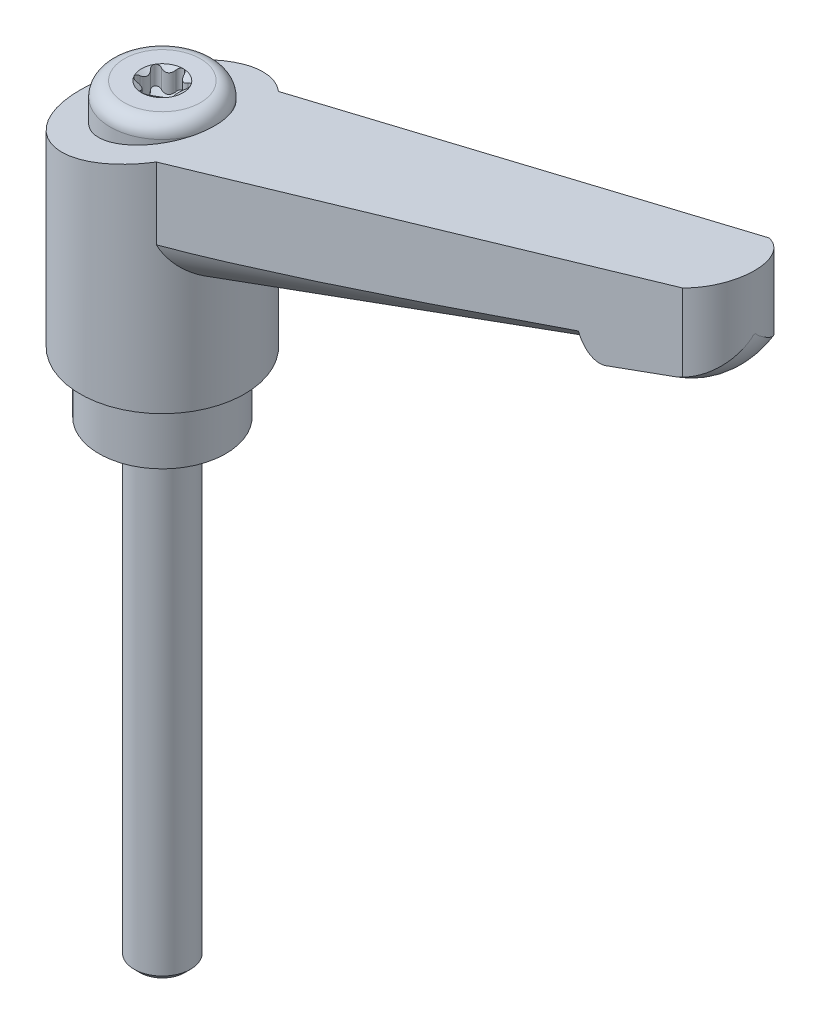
ISO-10303-21;
HEADER;
FILE_DESCRIPTION(('STEP AP214'),'2;1');
FILE_NAME('part.step','',(''),(''),'','','');
FILE_SCHEMA(('AUTOMOTIVE_DESIGN { 1 0 10303 214 1 1 1 1 }'));
ENDSEC;
DATA;
#1=APPLICATION_CONTEXT('core data for automotive mechanical design processes');
#2=APPLICATION_PROTOCOL_DEFINITION('international standard','automotive_design',2000,#1);
#3=PRODUCT_CONTEXT('',#1,'mechanical');
#4=PRODUCT('Part','Part','',(#3));
#5=PRODUCT_RELATED_PRODUCT_CATEGORY('part','',(#4));
#6=PRODUCT_DEFINITION_FORMATION('','',#4);
#7=PRODUCT_DEFINITION_CONTEXT('part definition',#1,'design');
#8=PRODUCT_DEFINITION('design','',#6,#7);
#9=PRODUCT_DEFINITION_SHAPE('','',#8);
#10=(LENGTH_UNIT() NAMED_UNIT(*) SI_UNIT(.MILLI.,.METRE.));
#11=(NAMED_UNIT(*) PLANE_ANGLE_UNIT() SI_UNIT($,.RADIAN.));
#12=(NAMED_UNIT(*) SI_UNIT($,.STERADIAN.) SOLID_ANGLE_UNIT());
#13=UNCERTAINTY_MEASURE_WITH_UNIT(LENGTH_MEASURE(1.E-05),#10,'distance_accuracy_value','');
#14=(GEOMETRIC_REPRESENTATION_CONTEXT(3) GLOBAL_UNCERTAINTY_ASSIGNED_CONTEXT((#13)) GLOBAL_UNIT_ASSIGNED_CONTEXT((#10,
#11,#12)) REPRESENTATION_CONTEXT('',''));
#15=CARTESIAN_POINT('',(0.,0.,0.));
#16=DIRECTION('',(0.,0.,1.));
#17=DIRECTION('',(1.,0.,0.));
#18=AXIS2_PLACEMENT_3D('',#15,#16,#17);
#19=CARTESIAN_POINT('',(1.53459701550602,27.,0.886000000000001));
#20=DIRECTION('',(0.,1.,0.));
#21=DIRECTION('',(0.,0.,1.));
#22=AXIS2_PLACEMENT_3D('',#19,#20,#21);
#23=CYLINDRICAL_SURFACE('',#22,0.443);
#24=DIRECTION('',(0.,1.,0.));
#25=VECTOR('',#24,1.);
#26=CARTESIAN_POINT('',(1.83864943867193,27.,0.563818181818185));
#27=LINE('',#26,#25);
#28=CARTESIAN_POINT('',(1.83864943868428,28.8315028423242,0.563818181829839));
#29=VERTEX_POINT('',#28);
#30=CARTESIAN_POINT('',(1.83864943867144,30.8315028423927,0.563818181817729));
#31=VERTEX_POINT('',#30);
#32=EDGE_CURVE('E189',#29,#31,#27,.T.);
#33=ORIENTED_EDGE('',*,*,#32,.F.);
#34=CARTESIAN_POINT('',(1.40760557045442,28.8315028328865,1.31040802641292));
#35=CARTESIAN_POINT('',(1.43210071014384,28.8447477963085,1.31775635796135));
#36=CARTESIAN_POINT('',(1.45748061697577,28.857597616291,1.32301894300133));
#37=CARTESIAN_POINT('',(1.50939354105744,28.8822631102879,1.32905299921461));
#38=CARTESIAN_POINT('',(1.53593128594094,28.8940738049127,1.32980389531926));
#39=CARTESIAN_POINT('',(1.58939185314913,28.916326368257,1.32641640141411));
#40=CARTESIAN_POINT('',(1.6163156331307,28.9267637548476,1.32226242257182));
#41=CARTESIAN_POINT('',(1.6694679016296,28.945880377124,1.30885630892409));
#42=CARTESIAN_POINT('',(1.69569771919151,28.9545632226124,1.29961479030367));
#43=CARTESIAN_POINT('',(1.74416106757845,28.9691875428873,1.27712730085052));
#44=CARTESIAN_POINT('',(1.76654208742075,28.9753049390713,1.26431433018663));
#45=CARTESIAN_POINT('',(1.80902319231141,28.9856214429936,1.23472360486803));
#46=CARTESIAN_POINT('',(1.82912382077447,28.9898210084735,1.217946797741));
#47=CARTESIAN_POINT('',(1.8644468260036,28.9958358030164,1.18266742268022));
#48=CARTESIAN_POINT('',(1.87995072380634,28.9978388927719,1.16447789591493));
#49=CARTESIAN_POINT('',(1.90786323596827,29.0000666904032,1.12577049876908));
#50=CARTESIAN_POINT('',(1.92027330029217,29.0002922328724,1.10525372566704));
#51=CARTESIAN_POINT('',(1.94108819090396,28.9989909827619,1.06356864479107));
#52=CARTESIAN_POINT('',(1.94965709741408,28.9975480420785,1.04247927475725));
#53=CARTESIAN_POINT('',(1.96343610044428,28.993092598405,0.99939142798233));
#54=CARTESIAN_POINT('',(1.96864617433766,28.9900800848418,0.977392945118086));
#55=CARTESIAN_POINT('',(1.97568144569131,28.9825486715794,0.932944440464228));
#56=CARTESIAN_POINT('',(1.97748072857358,28.9780185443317,0.910492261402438));
#57=CARTESIAN_POINT('',(1.97770242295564,28.9675868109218,0.865898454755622));
#58=CARTESIAN_POINT('',(1.97612450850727,28.9616850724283,0.843756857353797));
#59=CARTESIAN_POINT('',(1.96960698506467,28.9482940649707,0.799093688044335));
#60=CARTESIAN_POINT('',(1.96448424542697,28.940734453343,0.776620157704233));
#61=CARTESIAN_POINT('',(1.9510022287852,28.9244342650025,0.733110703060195));
#62=CARTESIAN_POINT('',(1.94264047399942,28.9156927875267,0.712075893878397));
#63=CARTESIAN_POINT('',(1.92216028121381,28.896380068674,0.670039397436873));
#64=CARTESIAN_POINT('',(1.9097697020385,28.8857147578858,0.649214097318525));
#65=CARTESIAN_POINT('',(1.88209462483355,28.8634511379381,0.610200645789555));
#66=CARTESIAN_POINT('',(1.86681439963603,28.851854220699,0.592008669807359));
#67=CARTESIAN_POINT('',(1.8465126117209,28.8371252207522,0.571376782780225));
#68=CARTESIAN_POINT('',(1.84261149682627,28.8343227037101,0.567556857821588));
#69=CARTESIAN_POINT('',(1.83864943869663,28.831502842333,0.563818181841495));
#70=B_SPLINE_CURVE_WITH_KNOTS('',3,(#34,#35,#36,#37,#38,#39,#40,#41,#42,#43,#44,#45,#46,#47,#48,
#49,#50,#51,#52,#53,#54,#55,#56,#57,#58,#59,#60,#61,#62,#63,#64,#65,#66,#67,#68,#69),
.UNSPECIFIED.,.F.,.F.,(4,2,2,2,2,2,2,2,2,2,2,2,2,2,2,2,2,4),(0.,0.0863713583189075,
0.173136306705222,0.260177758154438,0.347038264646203,0.426115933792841,0.505174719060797,
0.576760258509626,0.648312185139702,0.71641889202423,0.784526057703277,0.853148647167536,
0.921777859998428,0.99424651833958,1.06677072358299,1.14587928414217,1.22487177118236,
1.24327909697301),.UNSPECIFIED.);
#71=CARTESIAN_POINT('',(1.40760557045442,28.8315028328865,1.31040802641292));
#72=VERTEX_POINT('',#71);
#73=EDGE_CURVE('E190',#72,#29,#70,.T.);
#74=ORIENTED_EDGE('',*,*,#73,.F.);
#75=DIRECTION('',(0.,1.,0.));
#76=VECTOR('',#75,1.);
#77=CARTESIAN_POINT('',(1.40760557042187,27.,1.31040802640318));
#78=LINE('',#77,#76);
#79=CARTESIAN_POINT('',(1.40760557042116,30.8315028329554,1.31040802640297));
#80=VERTEX_POINT('',#79);
#81=EDGE_CURVE('E216',#80,#72,#78,.F.);
#82=ORIENTED_EDGE('',*,*,#81,.F.);
#83=CARTESIAN_POINT('',(1.91824626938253,31.0000000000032,1.1075));
#84=CARTESIAN_POINT('',(1.906667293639,31.0000094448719,1.12761045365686));
#85=CARTESIAN_POINT('',(1.89347208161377,30.9991586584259,1.14676721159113));
#86=CARTESIAN_POINT('',(1.86439253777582,30.9958118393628,1.1826633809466));
#87=CARTESIAN_POINT('',(1.84851632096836,30.993320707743,1.19940981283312));
#88=CARTESIAN_POINT('',(1.81454830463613,30.9867685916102,1.23009586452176));
#89=CARTESIAN_POINT('',(1.79645716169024,30.9827080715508,1.24403631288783));
#90=CARTESIAN_POINT('',(1.75862707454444,30.9731405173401,1.26884607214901));
#91=CARTESIAN_POINT('',(1.73888757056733,30.9676329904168,1.27971433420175));
#92=CARTESIAN_POINT('',(1.69766423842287,30.9551138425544,1.29853923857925));
#93=CARTESIAN_POINT('',(1.67614422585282,30.9480582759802,1.3063869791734));
#94=CARTESIAN_POINT('',(1.63255624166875,30.9327355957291,1.31862689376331));
#95=CARTESIAN_POINT('',(1.61048794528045,30.9244677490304,1.32301696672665));
#96=CARTESIAN_POINT('',(1.56443830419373,30.9061413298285,1.32865366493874));
#97=CARTESIAN_POINT('',(1.54045694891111,30.8959896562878,1.32959482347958));
#98=CARTESIAN_POINT('',(1.49312012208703,30.8747062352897,1.32768899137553));
#99=CARTESIAN_POINT('',(1.46976415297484,30.8635752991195,1.32484510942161));
#100=CARTESIAN_POINT('',(1.43363861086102,30.8453326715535,1.31755783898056));
#101=CARTESIAN_POINT('',(1.42050076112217,30.8384715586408,1.31426920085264));
#102=CARTESIAN_POINT('',(1.40760557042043,30.831502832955,1.31040802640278));
#103=B_SPLINE_CURVE_WITH_KNOTS('',3,(#83,#84,#85,#86,#87,#88,#89,#90,#91,#92,#93,#94,#95,#96,
#97,#98,#99,#100,#101,#102),.UNSPECIFIED.,.F.,.F.,(4,2,2,2,2,2,2,2,2,4),(0.,0.0695001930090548,
0.138793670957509,0.208066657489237,0.277363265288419,0.348965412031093,0.420611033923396,
0.498467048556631,0.576259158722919,0.621744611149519),.UNSPECIFIED.);
#104=CARTESIAN_POINT('',(1.91824626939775,31.0000000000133,1.10750000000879));
#105=VERTEX_POINT('',#104);
#106=EDGE_CURVE('E20',#105,#80,#103,.T.);
#107=ORIENTED_EDGE('',*,*,#106,.F.);
#108=CARTESIAN_POINT('',(1.83864943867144,30.8315028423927,0.56381818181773));
#109=CARTESIAN_POINT('',(1.8572576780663,30.844745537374,0.581354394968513));
#110=CARTESIAN_POINT('',(1.87450246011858,30.8575932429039,0.600699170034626));
#111=CARTESIAN_POINT('',(1.90568571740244,30.8822591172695,0.642639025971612));
#112=CARTESIAN_POINT('',(1.91960758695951,30.894071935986,0.665249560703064));
#113=CARTESIAN_POINT('',(1.94340691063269,30.916326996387,0.713246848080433));
#114=CARTESIAN_POINT('',(1.95327180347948,30.9267649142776,0.738641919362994));
#115=CARTESIAN_POINT('',(1.96823731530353,30.9458813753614,0.791376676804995));
#116=CARTESIAN_POINT('',(1.97334832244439,30.9545637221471,0.818711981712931));
#117=CARTESIAN_POINT('',(1.97810579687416,30.9691889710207,0.871929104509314));
#118=CARTESIAN_POINT('',(1.97819974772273,30.9753073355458,0.897722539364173));
#119=CARTESIAN_POINT('',(1.97381135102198,30.9856234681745,0.949310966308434));
#120=CARTESIAN_POINT('',(1.96933204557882,30.9898225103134,0.975105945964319));
#121=CARTESIAN_POINT('',(1.95758987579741,30.9953007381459,1.01903441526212));
#122=CARTESIAN_POINT('',(1.95137244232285,30.9970578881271,1.03739460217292));
#123=CARTESIAN_POINT('',(1.93656393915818,30.9994094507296,1.07321574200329));
#124=CARTESIAN_POINT('',(1.92797210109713,31.0000034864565,1.09067640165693));
#125=CARTESIAN_POINT('',(1.91824626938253,31.0000000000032,1.1075));
#126=B_SPLINE_CURVE_WITH_KNOTS('',3,(#108,#109,#110,#111,#112,#113,#114,#115,#116,#117,#118,
#119,#120,#121,#122,#123,#124,#125),.UNSPECIFIED.,.F.,.F.,(4,2,2,2,2,2,2,2,4),(0.,
0.0863566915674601,0.173136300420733,0.260182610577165,0.347038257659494,0.42613277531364,
0.505174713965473,0.563374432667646,0.621593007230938),.UNSPECIFIED.);
#127=EDGE_CURVE('E177',#31,#105,#126,.T.);
#128=ORIENTED_EDGE('',*,*,#127,.F.);
#129=EDGE_LOOP('',(#33,#74,#82,#107,#128));
#130=FACE_BOUND('',#129,.T.);
#131=ADVANCED_FACE('F16',(#130),#23,.F.);
#132=CARTESIAN_POINT('',(2.37074117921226,27.,0.));
#133=DIRECTION('',(0.,1.,0.));
#134=DIRECTION('',(0.,0.,1.));
#135=AXIS2_PLACEMENT_3D('',#132,#133,#134);
#136=CYLINDRICAL_SURFACE('',#135,0.77525);
#137=DIRECTION('',(0.,1.,0.));
#138=VECTOR('',#137,1.);
#139=CARTESIAN_POINT('',(1.83864943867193,27.,-0.56381818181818));
#140=LINE('',#139,#138);
#141=CARTESIAN_POINT('',(1.83864943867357,30.8315028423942,-0.56381818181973));
#142=VERTEX_POINT('',#141);
#143=CARTESIAN_POINT('',(1.83864943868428,28.8315028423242,-0.563818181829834));
#144=VERTEX_POINT('',#143);
#145=EDGE_CURVE('E425',#142,#144,#140,.F.);
#146=ORIENTED_EDGE('',*,*,#145,.T.);
#147=CARTESIAN_POINT('',(1.83864943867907,28.8315028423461,-0.563818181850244));
#148=CARTESIAN_POINT('',(1.80915300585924,28.8105445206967,-0.53598682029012));
#149=CARTESIAN_POINT('',(1.7814886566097,28.7902259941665,-0.505493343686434));
#150=CARTESIAN_POINT('',(1.73058626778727,28.751896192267,-0.439285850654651));
#151=CARTESIAN_POINT('',(1.70738543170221,28.7339046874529,-0.403531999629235));
#152=CARTESIAN_POINT('',(1.67019355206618,28.7044191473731,-0.333946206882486));
#153=CARTESIAN_POINT('',(1.65530380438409,28.6923395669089,-0.300849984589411));
#154=CARTESIAN_POINT('',(1.630122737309,28.6716281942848,-0.232021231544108));
#155=CARTESIAN_POINT('',(1.61981761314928,28.6629860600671,-0.196296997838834));
#156=CARTESIAN_POINT('',(1.60432487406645,28.6498980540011,-0.122654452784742));
#157=CARTESIAN_POINT('',(1.59918123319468,28.6454882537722,-0.0847201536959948));
#158=CARTESIAN_POINT('',(1.59459047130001,28.6415559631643,-0.00824210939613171));
#159=CARTESIAN_POINT('',(1.59514288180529,28.6420330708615,0.030301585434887));
#160=CARTESIAN_POINT('',(1.60146702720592,28.6474413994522,0.101762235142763));
#161=CARTESIAN_POINT('',(1.60658332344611,28.6518131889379,0.134784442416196));
#162=CARTESIAN_POINT('',(1.62082381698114,28.6638273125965,0.199321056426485));
#163=CARTESIAN_POINT('',(1.62994854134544,28.6714700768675,0.230835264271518));
#164=CARTESIAN_POINT('',(1.65234234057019,28.6899169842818,0.293391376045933));
#165=CARTESIAN_POINT('',(1.66580585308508,28.7008675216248,0.32431922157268));
#166=CARTESIAN_POINT('',(1.69616628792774,28.7250583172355,0.383495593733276));
#167=CARTESIAN_POINT('',(1.71306681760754,28.7383009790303,0.411741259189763));
#168=CARTESIAN_POINT('',(1.74731799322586,28.7645480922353,0.461676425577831));
#169=CARTESIAN_POINT('',(1.76429766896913,28.777341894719,0.483735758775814));
#170=CARTESIAN_POINT('',(1.80012754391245,28.8038211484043,0.525514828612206));
#171=CARTESIAN_POINT('',(1.81897016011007,28.8175029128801,0.545243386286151));
#172=CARTESIAN_POINT('',(1.83864943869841,28.8315028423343,0.563818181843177));
#173=B_SPLINE_CURVE_WITH_KNOTS('',3,(#147,#148,#149,#150,#151,#152,#153,#154,#155,#156,#157,
#158,#159,#160,#161,#162,#163,#164,#165,#166,#167,#168,#169,#170,#171,#172),.UNSPECIFIED.,.F.,
.F.,(4,2,2,2,2,2,2,2,2,2,2,2,4),(0.,0.137065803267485,0.275228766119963,0.389514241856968,
0.503453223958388,0.618354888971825,0.733247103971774,0.833898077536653,0.934562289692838,
1.04057496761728,1.146699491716,1.23845086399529,1.32984304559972),.UNSPECIFIED.);
#174=EDGE_CURVE('E249',#144,#29,#173,.T.);
#175=ORIENTED_EDGE('',*,*,#174,.T.);
#176=ORIENTED_EDGE('',*,*,#32,.T.);
#177=CARTESIAN_POINT('',(1.83864943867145,30.8315028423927,0.563818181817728));
#178=CARTESIAN_POINT('',(1.80915300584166,30.8105445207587,0.535986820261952));
#179=CARTESIAN_POINT('',(1.78148865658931,30.7902259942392,0.505493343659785));
#180=CARTESIAN_POINT('',(1.73058626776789,30.7518961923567,0.439285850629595));
#181=CARTESIAN_POINT('',(1.70738543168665,30.7339046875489,0.403531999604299));
#182=CARTESIAN_POINT('',(1.67019355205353,30.704419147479,0.333946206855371));
#183=CARTESIAN_POINT('',(1.65530380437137,30.6923395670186,0.300849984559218));
#184=CARTESIAN_POINT('',(1.63012273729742,30.6716281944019,0.232021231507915));
#185=CARTESIAN_POINT('',(1.61981761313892,30.6629860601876,0.196296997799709));
#186=CARTESIAN_POINT('',(1.60432487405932,30.6498980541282,0.122654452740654));
#187=CARTESIAN_POINT('',(1.59918123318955,30.6454882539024,0.0847201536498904));
#188=CARTESIAN_POINT('',(1.5945904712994,30.6415559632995,0.00824210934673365));
#189=CARTESIAN_POINT('',(1.5951428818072,30.6420330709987,-0.0303015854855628));
#190=CARTESIAN_POINT('',(1.60146702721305,30.6474413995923,-0.101762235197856));
#191=CARTESIAN_POINT('',(1.60658332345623,30.6518131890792,-0.134784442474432));
#192=CARTESIAN_POINT('',(1.62082381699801,30.6638273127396,-0.199321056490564));
#193=CARTESIAN_POINT('',(1.62994854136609,30.6714700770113,-0.230835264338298));
#194=CARTESIAN_POINT('',(1.65234234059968,30.6899169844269,-0.293391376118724));
#195=CARTESIAN_POINT('',(1.66580585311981,30.7008675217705,-0.324319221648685));
#196=CARTESIAN_POINT('',(1.69616628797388,30.7250583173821,-0.383495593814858));
#197=CARTESIAN_POINT('',(1.71306681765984,30.7383009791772,-0.411741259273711));
#198=CARTESIAN_POINT('',(1.74731799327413,30.7645480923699,-0.461676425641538));
#199=CARTESIAN_POINT('',(1.76429766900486,30.7773418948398,-0.483735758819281));
#200=CARTESIAN_POINT('',(1.80012754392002,30.8038211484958,-0.525514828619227));
#201=CARTESIAN_POINT('',(1.81897016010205,30.817502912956,-0.545243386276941));
#202=CARTESIAN_POINT('',(1.83864943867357,30.8315028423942,-0.56381818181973));
#203=B_SPLINE_CURVE_WITH_KNOTS('',3,(#177,#178,#179,#180,#181,#182,#183,#184,#185,#186,#187,
#188,#189,#190,#191,#192,#193,#194,#195,#196,#197,#198,#199,#200,#201,#202),.UNSPECIFIED.,.F.,
.F.,(4,2,2,2,2,2,2,2,2,2,2,2,4),(0.,0.137065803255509,0.275228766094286,0.389514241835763,
0.50345322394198,0.618354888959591,0.733247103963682,0.833898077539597,0.93456228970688,
1.04057496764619,1.14669949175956,1.23845086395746,1.32984304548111),.UNSPECIFIED.);
#204=EDGE_CURVE('E183',#31,#142,#203,.T.);
#205=ORIENTED_EDGE('',*,*,#204,.T.);
#206=EDGE_LOOP('',(#146,#175,#176,#205));
#207=FACE_BOUND('',#206,.T.);
#208=ADVANCED_FACE('F361',(#207),#136,.T.);
#209=CARTESIAN_POINT('',(1.18537058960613,27.,2.0531220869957));
#210=DIRECTION('',(0.,1.,0.));
#211=DIRECTION('',(0.,0.,1.));
#212=AXIS2_PLACEMENT_3D('',#209,#210,#211);
#213=CYLINDRICAL_SURFACE('',#212,0.775250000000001);
#214=ORIENTED_EDGE('',*,*,#81,.T.);
#215=CARTESIAN_POINT('',(1.40760557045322,28.8315028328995,1.31040802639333));
#216=CARTESIAN_POINT('',(1.36875468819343,28.8105445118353,1.29877904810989));
#217=CARTESIAN_POINT('',(1.32851438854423,28.7902259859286,1.29006775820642));
#218=CARTESIAN_POINT('',(1.2457258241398,28.751896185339,1.2790887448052));
#219=CARTESIAN_POINT('',(1.20316166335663,28.7339046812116,1.27687315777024));
#220=CARTESIAN_POINT('',(1.12430266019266,28.7044191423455,1.27945694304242));
#221=CARTESIAN_POINT('',(1.08819561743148,28.6923395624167,1.28311015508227));
#222=CARTESIAN_POINT('',(1.0159976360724,28.6716281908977,1.29571708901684));
#223=CARTESIAN_POINT('',(0.979906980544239,28.6629860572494,1.30465470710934));
#224=CARTESIAN_POINT('',(0.90838429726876,28.6498980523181,1.32805887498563));
#225=CARTESIAN_POINT('',(0.872960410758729,28.6454882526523,1.34257150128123));
#226=CARTESIAN_POINT('',(0.804433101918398,28.641555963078,1.37683480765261));
#227=CARTESIAN_POINT('',(0.77132948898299,28.6420330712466,1.39658505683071));
#228=CARTESIAN_POINT('',(0.712604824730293,28.6474414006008,1.43779225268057));
#229=CARTESIAN_POINT('',(0.686564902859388,28.6518131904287,1.45873419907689));
#230=CARTESIAN_POINT('',(0.637794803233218,28.6638273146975,1.50333513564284));
#231=CARTESIAN_POINT('',(0.615065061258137,28.6714700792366,1.52699448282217));
#232=CARTESIAN_POINT('',(0.572086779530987,28.6899169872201,1.57766613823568));
#233=CARTESIAN_POINT('',(0.552034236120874,28.7008675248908,1.60478980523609));
#234=CARTESIAN_POINT('',(0.515966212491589,28.7250583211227,1.66067089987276));
#235=CARTESIAN_POINT('',(0.499955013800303,28.7383009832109,1.68943002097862));
#236=CARTESIAN_POINT('',(0.473835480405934,28.7645480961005,1.74405999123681));
#237=CARTESIAN_POINT('',(0.46322137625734,28.777341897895,1.76979448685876));
#238=CARTESIAN_POINT('',(0.444954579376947,28.8038211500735,1.82171360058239));
#239=CARTESIAN_POINT('',(0.437290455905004,28.8175029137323,1.84789606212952));
#240=CARTESIAN_POINT('',(0.431043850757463,28.8315028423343,1.87422621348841));
#241=B_SPLINE_CURVE_WITH_KNOTS('',3,(#215,#216,#217,#218,#219,#220,#221,#222,#223,#224,#225,
#226,#227,#228,#229,#230,#231,#232,#233,#234,#235,#236,#237,#238,#239,#240),.UNSPECIFIED.,.F.,
.F.,(4,2,2,2,2,2,2,2,2,2,2,2,4),(0.,0.137065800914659,0.275228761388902,0.38951423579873,
0.503453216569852,0.618354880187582,0.733247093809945,0.833898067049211,0.934562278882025,
1.04057495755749,1.14669948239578,1.23845084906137,1.32984302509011),.UNSPECIFIED.);
#242=CARTESIAN_POINT('',(0.431043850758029,28.831502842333,1.87422621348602));
#243=VERTEX_POINT('',#242);
#244=EDGE_CURVE('E339',#72,#243,#241,.T.);
#245=ORIENTED_EDGE('',*,*,#244,.T.);
#246=DIRECTION('',(0.,1.,0.));
#247=VECTOR('',#246,1.);
#248=CARTESIAN_POINT('',(0.431043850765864,27.,1.87422621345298));
#249=LINE('',#248,#247);
#250=CARTESIAN_POINT('',(0.431043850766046,30.8315028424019,1.87422621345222));
#251=VERTEX_POINT('',#250);
#252=EDGE_CURVE('E396',#243,#251,#249,.T.);
#253=ORIENTED_EDGE('',*,*,#252,.T.);
#254=CARTESIAN_POINT('',(0.431043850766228,30.8315028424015,1.87422621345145));
#255=CARTESIAN_POINT('',(0.440398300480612,30.8105445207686,1.83476587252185));
#256=CARTESIAN_POINT('',(0.452974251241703,30.7902259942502,1.79556110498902));
#257=CARTESIAN_POINT('',(0.484860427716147,30.7518961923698,1.71837459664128));
#258=CARTESIAN_POINT('',(0.504223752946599,30.733904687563,1.6804051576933));
#259=CARTESIAN_POINT('',(0.545890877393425,30.7044191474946,1.61340314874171));
#260=CARTESIAN_POINT('',(0.567108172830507,30.6923395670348,1.58396013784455));
#261=CARTESIAN_POINT('',(0.614125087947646,30.671628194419,1.52773831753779));
#262=CARTESIAN_POINT('',(0.639910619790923,30.6629860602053,1.50095170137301));
#263=CARTESIAN_POINT('',(0.695940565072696,30.6498980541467,1.45071332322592));
#264=CARTESIAN_POINT('',(0.726220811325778,30.6454882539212,1.42729165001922));
#265=CARTESIAN_POINT('',(0.790157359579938,30.6415559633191,1.38507691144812));
#266=CARTESIAN_POINT('',(0.823813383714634,30.6420330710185,1.36628346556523));
#267=CARTESIAN_POINT('',(0.888862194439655,30.6474413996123,1.33603001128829));
#268=CARTESIAN_POINT('',(0.920018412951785,30.6518131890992,1.32394975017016));
#269=CARTESIAN_POINT('',(0.983029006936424,30.6638273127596,1.3040140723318));
#270=CARTESIAN_POINT('',(1.01488347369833,30.6714700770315,1.29615921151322));
#271=CARTESIAN_POINT('',(1.08025555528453,30.6899169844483,1.2842747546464));
#272=CARTESIAN_POINT('',(1.11377161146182,30.7008675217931,1.28047057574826));
#273=CARTESIAN_POINT('',(1.18020007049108,30.7250583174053,1.27717529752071));
#274=CARTESIAN_POINT('',(1.2131117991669,30.7383009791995,1.2776887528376));
#275=CARTESIAN_POINT('',(1.27348250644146,30.7645480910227,1.28238355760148));
#276=CARTESIAN_POINT('',(1.30107628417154,30.7773418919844,1.28605872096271));
#277=CARTESIAN_POINT('',(1.35517295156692,30.8038211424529,1.29619876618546));
#278=CARTESIAN_POINT('',(1.38167968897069,30.8175029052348,1.3026526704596));
#279=CARTESIAN_POINT('',(1.40760557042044,30.831502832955,1.31040802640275));
#280=B_SPLINE_CURVE_WITH_KNOTS('',3,(#254,#255,#256,#257,#258,#259,#260,#261,#262,#263,#264,
#265,#266,#267,#268,#269,#270,#271,#272,#273,#274,#275,#276,#277,#278,#279),.UNSPECIFIED.,.F.,
.F.,(4,2,2,2,2,2,2,2,2,2,2,2,4),(0.,0.137065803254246,0.275228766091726,0.389514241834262,
0.503453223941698,0.618354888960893,0.733247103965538,0.833898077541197,0.934562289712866,
1.04057496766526,1.14669949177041,1.23845085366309,1.32984302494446),.UNSPECIFIED.);
#281=EDGE_CURVE('E352',#251,#80,#280,.T.);
#282=ORIENTED_EDGE('',*,*,#281,.T.);
#283=EDGE_LOOP('',(#214,#245,#253,#282));
#284=FACE_BOUND('',#283,.T.);
#285=ADVANCED_FACE('F357',(#284),#213,.T.);
#286=CARTESIAN_POINT('',(1.53459701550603,27.,-0.886));
#287=DIRECTION('',(0.,1.,0.));
#288=DIRECTION('',(0.,0.,1.));
#289=AXIS2_PLACEMENT_3D('',#286,#287,#288);
#290=CYLINDRICAL_SURFACE('',#289,0.443);
#291=DIRECTION('',(0.,1.,0.));
#292=VECTOR('',#291,1.);
#293=CARTESIAN_POINT('',(1.40760558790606,27.,-1.31040803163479));
#294=LINE('',#293,#292);
#295=CARTESIAN_POINT('',(1.40760558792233,28.8315028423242,-1.31040803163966));
#296=VERTEX_POINT('',#295);
#297=CARTESIAN_POINT('',(1.40760558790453,30.8315028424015,-1.31040803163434));
#298=VERTEX_POINT('',#297);
#299=EDGE_CURVE('E395',#296,#298,#294,.T.);
#300=ORIENTED_EDGE('',*,*,#299,.F.);
#301=CARTESIAN_POINT('',(1.83864943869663,28.831502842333,-0.563818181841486));
#302=CARTESIAN_POINT('',(1.85726084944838,28.844747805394,-0.581357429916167));
#303=CARTESIAN_POINT('',(1.87450833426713,28.8575976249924,-0.600705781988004));
#304=CARTESIAN_POINT('',(1.90569044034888,28.8822631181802,-0.642646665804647));
#305=CARTESIAN_POINT('',(1.91960960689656,28.8940738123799,-0.665253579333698));
#306=CARTESIAN_POINT('',(1.94340623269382,28.9163263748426,-0.713245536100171));
#307=CARTESIAN_POINT('',(1.95327067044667,28.9267637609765,-0.738639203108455));
#308=CARTESIAN_POINT('',(1.96823676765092,28.9458803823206,-0.791373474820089));
#309=CARTESIAN_POINT('',(1.9733482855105,28.9545632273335,-0.81870992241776));
#310=CARTESIAN_POINT('',(1.97810522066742,28.9691875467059,-0.871924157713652));
#311=CARTESIAN_POINT('',(1.97819937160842,28.975304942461,-0.897713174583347));
#312=CARTESIAN_POINT('',(1.97381360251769,28.9856214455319,-0.949298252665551));
#313=CARTESIAN_POINT('',(1.96933477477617,28.9898210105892,-0.975094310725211));
#314=CARTESIAN_POINT('',(1.95644344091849,28.9958358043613,-1.02332461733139));
#315=CARTESIAN_POINT('',(1.94844279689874,28.9978388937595,-1.04584614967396));
#316=CARTESIAN_POINT('',(1.92887746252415,29.0000666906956,-1.08937279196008));
#317=CARTESIAN_POINT('',(1.91731444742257,29.0002922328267,-1.11037860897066));
#318=CARTESIAN_POINT('',(1.89162155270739,28.9989909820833,-1.14924737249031));
#319=CARTESIAN_POINT('',(1.87764207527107,28.9975480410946,-1.16721294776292));
#320=CARTESIAN_POINT('',(1.84721640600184,28.9930925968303,-1.20068983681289));
#321=CARTESIAN_POINT('',(1.8307701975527,28.9900800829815,-1.21620113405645));
#322=CARTESIAN_POINT('',(1.79579429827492,28.982548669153,-1.24451810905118));
#323=CARTESIAN_POINT('',(1.7772497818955,28.9780185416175,-1.25730242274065));
#324=CARTESIAN_POINT('',(1.73874125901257,28.9675868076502,-1.27979131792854));
#325=CARTESIAN_POINT('',(1.71877711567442,28.9616850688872,-1.289495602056));
#326=CARTESIAN_POINT('',(1.67683891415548,28.9482940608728,-1.30618284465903));
#327=CARTESIAN_POINT('',(1.65481489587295,28.940734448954,-1.3129831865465));
#328=CARTESIAN_POINT('',(1.61039359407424,28.9244342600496,-1.32306214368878));
#329=CARTESIAN_POINT('',(1.58799603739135,28.9156927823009,-1.32633805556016));
#330=CARTESIAN_POINT('',(1.54135126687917,28.8963800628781,-1.32961993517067));
#331=CARTESIAN_POINT('',(1.51712073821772,28.8857147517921,-1.32930202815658));
#332=CARTESIAN_POINT('',(1.46949655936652,28.8634511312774,-1.32484143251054));
#333=CARTESIAN_POINT('',(1.44610173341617,28.8518542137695,-1.32070435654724));
#334=CARTESIAN_POINT('',(1.41808310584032,28.837125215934,-1.31343843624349));
#335=CARTESIAN_POINT('',(1.41282440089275,28.834322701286,-1.31196993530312));
#336=CARTESIAN_POINT('',(1.40760558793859,28.831502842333,-1.31040803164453));
#337=B_SPLINE_CURVE_WITH_KNOTS('',3,(#301,#302,#303,#304,#305,#306,#307,#308,#309,#310,#311,
#312,#313,#314,#315,#316,#317,#318,#319,#320,#321,#322,#323,#324,#325,#326,#327,#328,#329,#330,
#331,#332,#333,#334,#335,#336),.UNSPECIFIED.,.F.,.F.,(4,2,2,2,2,2,2,2,2,2,2,2,2,2,2,2,2,4),(0.,
0.0863713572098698,0.17313630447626,0.260177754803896,0.34703826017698,0.426115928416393,
0.505174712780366,0.576760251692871,0.648312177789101,0.716418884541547,0.784526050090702,
0.853148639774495,0.921777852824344,0.994246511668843,1.06677071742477,1.14587927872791,
1.22487176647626,1.24327907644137),.UNSPECIFIED.);
#338=EDGE_CURVE('E330',#144,#296,#337,.T.);
#339=ORIENTED_EDGE('',*,*,#338,.F.);
#340=ORIENTED_EDGE('',*,*,#145,.F.);
#341=CARTESIAN_POINT('',(1.91824626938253,31.0000000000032,-1.1075));
#342=CARTESIAN_POINT('',(1.92987294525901,31.0000094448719,-1.08741708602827));
#343=CARTESIAN_POINT('',(1.93986557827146,30.9991586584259,-1.06641131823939));
#344=CARTESIAN_POINT('',(1.95641280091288,30.9958118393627,-1.02327960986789));
#345=CARTESIAN_POINT('',(1.96297752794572,30.9933207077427,-1.00115718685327));
#346=CARTESIAN_POINT('',(1.97256842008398,30.9867685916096,-0.956396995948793));
#347=CARTESIAN_POINT('',(1.97559563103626,30.98270807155,-0.933759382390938));
#348=CARTESIAN_POINT('',(1.97816646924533,30.9731405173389,-0.88859268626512));
#349=CARTESIAN_POINT('',(1.9777089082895,30.9676329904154,-0.866063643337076));
#350=CARTESIAN_POINT('',(1.97340008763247,30.9551138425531,-0.820950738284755));
#351=CARTESIAN_POINT('',(1.96943642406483,30.948058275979,-0.798389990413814));
#352=CARTESIAN_POINT('',(1.95824250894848,30.9327355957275,-0.754521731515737));
#353=CARTESIAN_POINT('',(1.95101027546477,30.9244677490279,-0.733214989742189));
#354=CARTESIAN_POINT('',(1.93286697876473,30.9061413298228,-0.690516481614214));
#355=CARTESIAN_POINT('',(1.92169136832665,30.8959896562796,-0.669277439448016));
#356=CARTESIAN_POINT('',(1.89637245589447,30.8747062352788,-0.629235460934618));
#357=CARTESIAN_POINT('',(1.88223159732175,30.863575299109,-0.610430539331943));
#358=CARTESIAN_POINT('',(1.85785786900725,30.8453326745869,-0.582788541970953));
#359=CARTESIAN_POINT('',(1.84844090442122,30.8384715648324,-0.573055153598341));
#360=CARTESIAN_POINT('',(1.83864943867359,30.8315028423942,-0.563818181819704));
#361=B_SPLINE_CURVE_WITH_KNOTS('',3,(#341,#342,#343,#344,#345,#346,#347,#348,#349,#350,#351,
#352,#353,#354,#355,#356,#357,#358,#359,#360),.UNSPECIFIED.,.F.,.F.,(4,2,2,2,2,2,2,2,2,4),(0.,
0.069500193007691,0.138793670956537,0.20806665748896,0.277363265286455,0.348965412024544,
0.420611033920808,0.498467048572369,0.576259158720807,0.621744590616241),.UNSPECIFIED.);
#362=CARTESIAN_POINT('',(1.91824626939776,31.0000000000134,-1.10750000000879));
#363=VERTEX_POINT('',#362);
#364=EDGE_CURVE('E347',#363,#142,#361,.T.);
#365=ORIENTED_EDGE('',*,*,#364,.F.);
#366=CARTESIAN_POINT('',(1.40760558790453,30.8315028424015,-1.31040803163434));
#367=CARTESIAN_POINT('',(1.43209651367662,30.844745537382,-1.31775513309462));
#368=CARTESIAN_POINT('',(1.45747197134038,30.8575932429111,-1.3230171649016));
#369=CARTESIAN_POINT('',(1.50938458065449,30.8822591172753,-1.32905272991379));
#370=CARTESIAN_POINT('',(1.53592681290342,30.8940719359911,-1.32980415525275));
#371=CARTESIAN_POINT('',(1.58939334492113,30.9163269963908,-1.32641633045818));
#372=CARTESIAN_POINT('',(1.6163185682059,30.9267649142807,-1.322262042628));
#373=CARTESIAN_POINT('',(1.66947096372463,30.9458813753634,-1.30885517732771));
#374=CARTESIAN_POINT('',(1.69569953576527,30.9545637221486,-1.29961378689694));
#375=CARTESIAN_POINT('',(1.74416565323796,30.9691889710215,-1.27712531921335));
#376=CARTESIAN_POINT('',(1.76655039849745,30.9753073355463,-1.26430996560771));
#377=CARTESIAN_POINT('',(1.80903308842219,30.9856234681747,-1.23471528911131));
#378=CARTESIAN_POINT('',(1.82913254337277,30.9898225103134,-1.21793860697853));
#379=CARTESIAN_POINT('',(1.86130462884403,30.9953007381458,-1.18580535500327));
#380=CARTESIAN_POINT('',(1.87409630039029,30.9970578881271,-1.17124080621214));
#381=CARTESIAN_POINT('',(1.89771406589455,30.9994094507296,-1.14050569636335));
#382=CARTESIAN_POINT('',(1.90853952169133,31.0000034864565,-1.12433461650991));
#383=CARTESIAN_POINT('',(1.91824626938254,31.0000000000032,-1.1075));
#384=B_SPLINE_CURVE_WITH_KNOTS('',3,(#366,#367,#368,#369,#370,#371,#372,#373,#374,#375,#376,
#377,#378,#379,#380,#381,#382,#383),.UNSPECIFIED.,.F.,.F.,(4,2,2,2,2,2,2,2,4),(0.,
0.0863566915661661,0.173136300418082,0.260182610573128,0.347038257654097,0.426132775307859,
0.505174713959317,0.563374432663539,0.621593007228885),.UNSPECIFIED.);
#385=EDGE_CURVE('E416',#298,#363,#384,.T.);
#386=ORIENTED_EDGE('',*,*,#385,.F.);
#387=EDGE_LOOP('',(#300,#339,#340,#365,#386));
#388=FACE_BOUND('',#387,.T.);
#389=ADVANCED_FACE('F360',(#388),#290,.F.);
#390=CARTESIAN_POINT('',(0.,27.,1.772));
#391=DIRECTION('',(0.,1.,0.));
#392=DIRECTION('',(0.,0.,1.));
#393=AXIS2_PLACEMENT_3D('',#390,#391,#392);
#394=CYLINDRICAL_SURFACE('',#393,0.443);
#395=ORIENTED_EDGE('',*,*,#252,.F.);
#396=CARTESIAN_POINT('',(-0.431043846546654,28.8315028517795,1.87422623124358));
#397=CARTESIAN_POINT('',(-0.425160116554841,28.8447478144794,1.89911380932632));
#398=CARTESIAN_POINT('',(-0.417027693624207,28.8575976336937,1.92372474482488));
#399=CARTESIAN_POINT('',(-0.396296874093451,28.8822631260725,1.97169968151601));
#400=CARTESIAN_POINT('',(-0.383678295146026,28.8940738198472,1.99505748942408));
#401=CARTESIAN_POINT('',(-0.354014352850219,28.9163263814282,2.03966194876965));
#402=CARTESIAN_POINT('',(-0.336955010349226,28.9267637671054,2.06090163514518));
#403=CARTESIAN_POINT('',(-0.298768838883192,28.9458803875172,2.10022978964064));
#404=CARTESIAN_POINT('',(-0.277650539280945,28.9545632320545,2.11832471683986));
#405=CARTESIAN_POINT('',(-0.233944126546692,28.9691875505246,2.14905145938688));
#406=CARTESIAN_POINT('',(-0.211657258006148,28.9753049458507,2.16202750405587));
#407=CARTESIAN_POINT('',(-0.164790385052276,28.9856214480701,2.18402185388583));
#408=CARTESIAN_POINT('',(-0.140210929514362,28.989821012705,2.19304110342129));
#409=CARTESIAN_POINT('',(-0.0919965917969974,28.9958358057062,2.20599203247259));
#410=CARTESIAN_POINT('',(-0.0684920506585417,28.9978388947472,2.21032403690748));
#411=CARTESIAN_POINT('',(-0.0210142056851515,29.000066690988,2.21514327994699));
#412=CARTESIAN_POINT('',(0.0029588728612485,29.000292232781,2.21563232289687));
#413=CARTESIAN_POINT('',(0.0494666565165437,28.9989909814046,2.21281600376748));
#414=CARTESIAN_POINT('',(0.072015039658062,28.9975480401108,2.20969220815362));
#415=CARTESIAN_POINT('',(0.116219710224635,28.9930925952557,2.20008124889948));
#416=CARTESIAN_POINT('',(0.137875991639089,28.9900800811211,2.19359406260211));
#417=CARTESIAN_POINT('',(0.179887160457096,28.9825486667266,2.17746253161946));
#418=CARTESIAN_POINT('',(0.200230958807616,28.9780185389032,2.16779466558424));
#419=CARTESIAN_POINT('',(0.23896117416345,28.9675868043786,2.14568975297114));
#420=CARTESIAN_POINT('',(0.257347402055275,28.9616850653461,2.13325243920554));
#421=CARTESIAN_POINT('',(0.292768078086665,28.9482940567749,2.10527651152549));
#422=CARTESIAN_POINT('',(0.309669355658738,28.9407344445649,2.08960332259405));
#423=CARTESIAN_POINT('',(0.340608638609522,28.9244342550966,2.05617282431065));
#424=CARTESIAN_POINT('',(0.354644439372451,28.915692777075,2.03841392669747));
#425=CARTESIAN_POINT('',(0.380809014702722,28.8963800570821,1.999659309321));
#426=CARTESIAN_POINT('',(0.392648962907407,28.8857147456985,1.9785161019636));
#427=CARTESIAN_POINT('',(0.41259806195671,28.8634511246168,1.93504205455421));
#428=CARTESIAN_POINT('',(0.420712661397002,28.8518542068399,1.91271300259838));
#429=CARTESIAN_POINT('',(0.428429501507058,28.8371252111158,1.88481520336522));
#430=CARTESIAN_POINT('',(0.429787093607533,28.8343226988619,1.8795267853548));
#431=CARTESIAN_POINT('',(0.431043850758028,28.831502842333,1.87422621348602));
#432=B_SPLINE_CURVE_WITH_KNOTS('',3,(#396,#397,#398,#399,#400,#401,#402,#403,#404,#405,#406,
#407,#408,#409,#410,#411,#412,#413,#414,#415,#416,#417,#418,#419,#420,#421,#422,#423,#424,#425,
#426,#427,#428,#429,#430,#431),.UNSPECIFIED.,.F.,.F.,(4,2,2,2,2,2,2,2,2,2,2,2,2,2,2,2,2,4),(0.,
0.0863713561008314,0.173136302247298,0.260177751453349,0.347038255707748,0.426115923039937,
0.505174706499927,0.576760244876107,0.648312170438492,0.716418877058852,0.784526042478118,
0.853148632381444,0.921777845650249,0.994246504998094,1.06677071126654,1.14587927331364,
1.22487176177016,1.24327905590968),.UNSPECIFIED.);
#433=CARTESIAN_POINT('',(-0.431043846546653,28.8315028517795,1.87422623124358));
#434=VERTEX_POINT('',#433);
#435=EDGE_CURVE('E321',#434,#243,#432,.T.);
#436=ORIENTED_EDGE('',*,*,#435,.F.);
#437=DIRECTION('',(0.,1.,0.));
#438=VECTOR('',#437,1.);
#439=CARTESIAN_POINT('',(-0.431043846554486,27.,1.87422623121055));
#440=LINE('',#439,#438);
#441=CARTESIAN_POINT('',(-0.431043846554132,30.8315028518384,1.87422623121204));
#442=VERTEX_POINT('',#441);
#443=EDGE_CURVE('E1163',#442,#434,#440,.F.);
#444=ORIENTED_EDGE('',*,*,#443,.F.);
#445=CARTESIAN_POINT('',(0.,31.0000000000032,2.215));
#446=CARTESIAN_POINT('',(-0.0232056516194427,31.0000094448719,2.21502753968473));
#447=CARTESIAN_POINT('',(-0.046393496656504,30.9991586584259,2.21317852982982));
#448=CARTESIAN_POINT('',(-0.0920202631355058,30.9958118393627,2.20594299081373));
#449=CARTESIAN_POINT('',(-0.114461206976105,30.9933207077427,2.20056699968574));
#450=CARTESIAN_POINT('',(-0.158020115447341,30.9867685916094,2.18649286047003));
#451=CARTESIAN_POINT('',(-0.179138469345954,30.9827080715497,2.17779569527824));
#452=CARTESIAN_POINT('',(-0.219539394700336,30.9731405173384,2.15743875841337));
#453=CARTESIAN_POINT('',(-0.238821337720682,30.967632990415,2.14577797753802));
#454=CARTESIAN_POINT('',(-0.275735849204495,30.9551138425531,2.11948997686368));
#455=CARTESIAN_POINT('',(-0.293292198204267,30.9480582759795,2.10477696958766));
#456=CARTESIAN_POINT('',(-0.325686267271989,30.9327355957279,2.07314862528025));
#457=CARTESIAN_POINT('',(-0.340522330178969,30.9244677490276,2.05623195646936));
#458=CARTESIAN_POINT('',(-0.3684286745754,30.90614132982,2.01917014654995));
#459=CARTESIAN_POINT('',(-0.381234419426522,30.8959896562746,1.99887226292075));
#460=CARTESIAN_POINT('',(-0.403252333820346,30.8747062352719,1.95692445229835));
#461=CARTESIAN_POINT('',(-0.412467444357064,30.8635752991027,1.93527564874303));
#462=CARTESIAN_POINT('',(-0.424219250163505,30.8453326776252,1.90034638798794));
#463=CARTESIAN_POINT('',(-0.427940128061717,30.8384715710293,1.88732436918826));
#464=CARTESIAN_POINT('',(-0.43104384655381,30.8315028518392,1.87422623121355));
#465=B_SPLINE_CURVE_WITH_KNOTS('',3,(#445,#446,#447,#448,#449,#450,#451,#452,#453,#454,#455,
#456,#457,#458,#459,#460,#461,#462,#463,#464),.UNSPECIFIED.,.F.,.F.,(4,2,2,2,2,2,2,2,2,4),(0.,
0.0695001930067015,0.138793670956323,0.208066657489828,0.277363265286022,0.348965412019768,
0.42061103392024,0.49846704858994,0.57625915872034,0.621744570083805),.UNSPECIFIED.);
#466=CARTESIAN_POINT('',(0.,31.0000000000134,2.21500000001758));
#467=VERTEX_POINT('',#466);
#468=EDGE_CURVE('E410',#467,#442,#465,.T.);
#469=ORIENTED_EDGE('',*,*,#468,.F.);
#470=CARTESIAN_POINT('',(0.431043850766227,30.8315028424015,1.87422621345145));
#471=CARTESIAN_POINT('',(0.42516116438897,30.844745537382,1.89910952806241));
#472=CARTESIAN_POINT('',(0.417030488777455,30.8575932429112,1.92371633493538));
#473=CARTESIAN_POINT('',(0.396301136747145,30.8822591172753,1.97169175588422));
#474=CARTESIAN_POINT('',(0.383680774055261,30.8940719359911,1.99505371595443));
#475=CARTESIAN_POINT('',(0.354013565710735,30.9163269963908,2.03966317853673));
#476=CARTESIAN_POINT('',(0.33695323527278,30.9267649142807,2.06090396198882));
#477=CARTESIAN_POINT('',(0.298766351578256,30.9458813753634,2.10023185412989));
#478=CARTESIAN_POINT('',(0.277648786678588,30.9545637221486,2.11832576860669));
#479=CARTESIAN_POINT('',(0.233940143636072,30.9691889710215,2.14905442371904));
#480=CARTESIAN_POINT('',(0.211649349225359,30.9753073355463,2.16203250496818));
#481=CARTESIAN_POINT('',(0.164778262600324,30.9856234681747,2.1840262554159));
#482=CARTESIAN_POINT('',(0.140199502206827,30.9898225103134,2.19304455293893));
#483=CARTESIAN_POINT('',(0.0962852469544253,30.9953007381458,2.20483977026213));
#484=CARTESIAN_POINT('',(0.077276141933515,30.9970578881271,2.20863540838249));
#485=CARTESIAN_POINT('',(0.0388498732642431,30.9994094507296,2.21372143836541));
#486=CARTESIAN_POINT('',(0.0194325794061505,31.0000034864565,2.21501101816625));
#487=CARTESIAN_POINT('',(0.,31.0000000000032,2.215));
#488=B_SPLINE_CURVE_WITH_KNOTS('',3,(#470,#471,#472,#473,#474,#475,#476,#477,#478,#479,#480,
#481,#482,#483,#484,#485,#486,#487),.UNSPECIFIED.,.F.,.F.,(4,2,2,2,2,2,2,2,4),(0.,
0.0863566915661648,0.173136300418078,0.260182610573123,0.34703825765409,0.426132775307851,
0.505174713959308,0.563374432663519,0.621593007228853),.UNSPECIFIED.);
#489=EDGE_CURVE('E211',#251,#467,#488,.T.);
#490=ORIENTED_EDGE('',*,*,#489,.F.);
#491=EDGE_LOOP('',(#395,#436,#444,#469,#490));
#492=FACE_BOUND('',#491,.T.);
#493=ADVANCED_FACE('F402',(#492),#394,.F.);
#494=CARTESIAN_POINT('',(1.18537058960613,27.,-2.05312208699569));
#495=DIRECTION('',(0.,1.,0.));
#496=DIRECTION('',(0.,0.,1.));
#497=AXIS2_PLACEMENT_3D('',#494,#495,#496);
#498=CYLINDRICAL_SURFACE('',#497,0.775249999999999);
#499=DIRECTION('',(0.,1.,0.));
#500=VECTOR('',#499,1.);
#501=CARTESIAN_POINT('',(0.431043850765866,27.,-1.87422621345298));
#502=LINE('',#501,#500);
#503=CARTESIAN_POINT('',(0.431043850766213,30.8315028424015,-1.87422621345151));
#504=VERTEX_POINT('',#503);
#505=CARTESIAN_POINT('',(0.431043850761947,28.8315028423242,-1.8742262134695));
#506=VERTEX_POINT('',#505);
#507=EDGE_CURVE('E1156',#504,#506,#502,.F.);
#508=ORIENTED_EDGE('',*,*,#507,.T.);
#509=CARTESIAN_POINT('',(0.431043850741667,28.8315028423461,-1.87422621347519));
#510=CARTESIAN_POINT('',(0.440398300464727,28.8105445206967,-1.83476587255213));
#511=CARTESIAN_POINT('',(0.452974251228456,28.7902259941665,-1.79556110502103));
#512=CARTESIAN_POINT('',(0.484860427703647,28.751896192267,-1.7183745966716));
#513=CARTESIAN_POINT('',(0.504223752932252,28.7339046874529,-1.68040515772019));
#514=CARTESIAN_POINT('',(0.545890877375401,28.7044191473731,-1.61340314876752));
#515=CARTESIAN_POINT('',(0.567108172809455,28.6923395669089,-1.58396013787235));
#516=CARTESIAN_POINT('',(0.614125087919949,28.6716281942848,-1.52773831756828));
#517=CARTESIAN_POINT('',(0.63991061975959,28.6629860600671,-1.50095170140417));
#518=CARTESIAN_POINT('',(0.695940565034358,28.6498980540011,-1.45071332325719));
#519=CARTESIAN_POINT('',(0.726220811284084,28.6454882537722,-1.42729165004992));
#520=CARTESIAN_POINT('',(0.790157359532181,28.6415559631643,-1.38507691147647));
#521=CARTESIAN_POINT('',(0.8238133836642,28.6420330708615,-1.36628346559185));
#522=CARTESIAN_POINT('',(0.888862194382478,28.6474413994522,-1.33603001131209));
#523=CARTESIAN_POINT('',(0.920018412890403,28.6518131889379,-1.32394975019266));
#524=CARTESIAN_POINT('',(0.983029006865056,28.6638273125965,-1.30401407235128));
#525=CARTESIAN_POINT('',(1.01488347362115,28.6714700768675,-1.29615921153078));
#526=CARTESIAN_POINT('',(1.08025555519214,28.6899169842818,-1.28427475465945));
#527=CARTESIAN_POINT('',(1.11377161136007,28.7008675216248,-1.28047057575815));
#528=CARTESIAN_POINT('',(1.18020007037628,28.7250583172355,-1.27717529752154));
#529=CARTESIAN_POINT('',(1.2131117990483,28.7383009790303,-1.27768875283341));
#530=CARTESIAN_POINT('',(1.27348250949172,28.7645480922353,-1.28238355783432));
#531=CARTESIAN_POINT('',(1.30107629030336,28.777341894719,-1.28605872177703));
#532=CARTESIAN_POINT('',(1.35517296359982,28.8038211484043,-1.29619876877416));
#533=CARTESIAN_POINT('',(1.38167970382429,28.8175029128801,-1.30265267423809));
#534=CARTESIAN_POINT('',(1.40760558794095,28.8315028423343,-1.31040803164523));
#535=B_SPLINE_CURVE_WITH_KNOTS('',3,(#509,#510,#511,#512,#513,#514,#515,#516,#517,#518,#519,
#520,#521,#522,#523,#524,#525,#526,#527,#528,#529,#530,#531,#532,#533,#534),.UNSPECIFIED.,.F.,
.F.,(4,2,2,2,2,2,2,2,2,2,2,2,4),(0.,0.137065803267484,0.275228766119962,0.389514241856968,
0.503453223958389,0.618354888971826,0.733247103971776,0.833898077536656,0.93456228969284,
1.04057496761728,1.146699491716,1.23845086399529,1.32984304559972),.UNSPECIFIED.);
#536=EDGE_CURVE('E312',#506,#296,#535,.T.);
#537=ORIENTED_EDGE('',*,*,#536,.T.);
#538=ORIENTED_EDGE('',*,*,#299,.T.);
#539=CARTESIAN_POINT('',(1.40760558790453,30.8315028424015,-1.31040803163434));
#540=CARTESIAN_POINT('',(1.3687547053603,30.8105445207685,-1.29877905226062));
#541=CARTESIAN_POINT('',(1.32851440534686,30.7902259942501,-1.29006776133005));
#542=CARTESIAN_POINT('',(1.24572584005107,30.7518961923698,-1.27908874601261));
#543=CARTESIAN_POINT('',(1.20316167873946,30.733904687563,-1.27687315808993));
#544=CARTESIAN_POINT('',(1.12430267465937,30.7044191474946,-1.27945694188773));
#545=CARTESIAN_POINT('',(1.08819563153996,30.6923395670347,-1.28311015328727));
#546=CARTESIAN_POINT('',(1.01599764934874,30.671628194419,-1.29571708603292));
#547=CARTESIAN_POINT('',(0.979906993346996,30.6629860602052,-1.30465470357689));
#548=CARTESIAN_POINT('',(0.908384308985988,30.6498980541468,-1.32805887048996));
#549=CARTESIAN_POINT('',(0.872960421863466,30.6454882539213,-1.34257149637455));
#550=CARTESIAN_POINT('',(0.804433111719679,30.6415559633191,-1.37683480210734));
#551=CARTESIAN_POINT('',(0.77132949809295,30.6420330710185,-1.396585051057));
#552=CARTESIAN_POINT('',(0.712604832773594,30.6474413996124,-1.43779224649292));
#553=CARTESIAN_POINT('',(0.686564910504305,30.6518131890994,-1.45873419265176));
#554=CARTESIAN_POINT('',(0.637794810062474,30.66382731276,-1.5033351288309));
#555=CARTESIAN_POINT('',(0.61506506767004,30.6714700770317,-1.52699447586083));
#556=CARTESIAN_POINT('',(0.572086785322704,30.6899169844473,-1.57766613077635));
#557=CARTESIAN_POINT('',(0.552034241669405,30.700867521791,-1.60478979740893));
#558=CARTESIAN_POINT('',(0.515966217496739,30.7250583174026,-1.66067089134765));
#559=CARTESIAN_POINT('',(0.499955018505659,30.7383009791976,-1.68943001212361));
#560=CARTESIAN_POINT('',(0.473835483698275,30.7645480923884,-1.74405998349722));
#561=CARTESIAN_POINT('',(0.4632213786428,30.7773418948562,-1.76979448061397));
#562=CARTESIAN_POINT('',(0.444954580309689,30.8038211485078,-1.82171359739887));
#563=CARTESIAN_POINT('',(0.437290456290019,30.8175029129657,-1.84789606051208));
#564=CARTESIAN_POINT('',(0.431043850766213,30.8315028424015,-1.87422621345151));
#565=B_SPLINE_CURVE_WITH_KNOTS('',3,(#539,#540,#541,#542,#543,#544,#545,#546,#547,#548,#549,
#550,#551,#552,#553,#554,#555,#556,#557,#558,#559,#560,#561,#562,#563,#564),.UNSPECIFIED.,.F.,
.F.,(4,2,2,2,2,2,2,2,2,2,2,2,4),(0.,0.137065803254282,0.27522876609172,0.389514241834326,
0.503453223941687,0.61835488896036,0.733247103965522,0.8338980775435,0.934562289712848,
1.0405749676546,1.1466994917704,1.23845086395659,1.32984304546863),.UNSPECIFIED.);
#566=EDGE_CURVE('E397',#298,#504,#565,.T.);
#567=ORIENTED_EDGE('',*,*,#566,.T.);
#568=EDGE_LOOP('',(#508,#537,#538,#567));
#569=FACE_BOUND('',#568,.T.);
#570=ADVANCED_FACE('F405',(#569),#498,.T.);
#571=CARTESIAN_POINT('',(-1.18537058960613,27.,2.05312208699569));
#572=DIRECTION('',(0.,1.,0.));
#573=DIRECTION('',(0.,0.,1.));
#574=AXIS2_PLACEMENT_3D('',#571,#572,#573);
#575=CYLINDRICAL_SURFACE('',#574,0.775249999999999);
#576=ORIENTED_EDGE('',*,*,#443,.T.);
#577=CARTESIAN_POINT('',(-0.431043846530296,28.8315028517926,1.87422623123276));
#578=CARTESIAN_POINT('',(-0.440398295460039,28.810544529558,1.83476588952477));
#579=CARTESIAN_POINT('',(-0.452974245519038,28.7902260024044,1.79556112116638));
#580=CARTESIAN_POINT('',(-0.484860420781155,28.7518961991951,1.71837461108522));
#581=CARTESIAN_POINT('',(-0.504223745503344,28.7339046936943,1.68040517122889));
#582=CARTESIAN_POINT('',(-0.545890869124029,28.7044191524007,1.61340316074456));
#583=CARTESIAN_POINT('',(-0.567108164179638,28.6923395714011,1.583960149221));
#584=CARTESIAN_POINT('',(-0.614125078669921,28.6716281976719,1.52773832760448));
#585=CARTESIAN_POINT('',(-0.639910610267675,28.6629860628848,1.50095171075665));
#586=CARTESIAN_POINT('',(-0.695940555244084,28.6498980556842,1.45071333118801));
#587=CARTESIAN_POINT('',(-0.726220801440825,28.6454882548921,1.42729165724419));
#588=CARTESIAN_POINT('',(-0.79015734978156,28.6415559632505,1.38507691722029));
#589=CARTESIAN_POINT('',(-0.823813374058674,28.6420330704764,1.36628347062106));
#590=CARTESIAN_POINT('',(-0.888862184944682,28.6474413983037,1.33603001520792));
#591=CARTESIAN_POINT('',(-0.920018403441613,28.6518131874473,1.32394975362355));
#592=CARTESIAN_POINT('',(-0.983028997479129,28.6638273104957,1.30401407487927));
#593=CARTESIAN_POINT('',(-1.01488346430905,28.6714700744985,1.29615921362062));
#594=CARTESIAN_POINT('',(-1.08025554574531,28.689916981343,1.28427475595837));
#595=CARTESIAN_POINT('',(-1.11377160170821,28.7008675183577,1.2804705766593));
#596=CARTESIAN_POINT('',(-1.18020006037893,28.7250583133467,1.27717529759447));
#597=CARTESIAN_POINT('',(-1.2131117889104,28.7383009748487,1.27768875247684));
#598=CARTESIAN_POINT('',(-1.27348250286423,28.7645480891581,1.28238355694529));
#599=CARTESIAN_POINT('',(-1.30107628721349,28.7773418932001,1.28605872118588));
#600=CARTESIAN_POINT('',(-1.3551729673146,28.803821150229,1.29619876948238));
#601=CARTESIAN_POINT('',(-1.3816797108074,28.8175029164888,1.30265267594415));
#602=CARTESIAN_POINT('',(-1.40760559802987,28.8315028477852,1.31040803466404));
#603=B_SPLINE_CURVE_WITH_KNOTS('',3,(#577,#578,#579,#580,#581,#582,#583,#584,#585,#586,#587,
#588,#589,#590,#591,#592,#593,#594,#595,#596,#597,#598,#599,#600,#601,#602),.UNSPECIFIED.,.F.,
.F.,(4,2,2,2,2,2,2,2,2,2,2,2,4),(0.,0.13706580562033,0.27522877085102,0.389514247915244,
0.503453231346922,0.618354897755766,0.733247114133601,0.833898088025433,0.934562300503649,
1.04057497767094,1.14669950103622,1.23845088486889,1.32984307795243),.UNSPECIFIED.);
#604=CARTESIAN_POINT('',(-1.40760559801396,28.8315028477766,1.31040803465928));
#605=VERTEX_POINT('',#604);
#606=EDGE_CURVE('E303',#434,#605,#603,.T.);
#607=ORIENTED_EDGE('',*,*,#606,.T.);
#608=DIRECTION('',(0.,1.,0.));
#609=VECTOR('',#608,1.);
#610=CARTESIAN_POINT('',(-1.40760559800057,27.,1.31040803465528));
#611=LINE('',#610,#609);
#612=CARTESIAN_POINT('',(-1.40760559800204,30.8315028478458,1.31040803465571));
#613=VERTEX_POINT('',#612);
#614=EDGE_CURVE('E1174',#605,#613,#611,.T.);
#615=ORIENTED_EDGE('',*,*,#614,.T.);
#616=CARTESIAN_POINT('',(-1.40760559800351,30.8315028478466,1.31040803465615));
#617=CARTESIAN_POINT('',(-1.36875471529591,30.8105445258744,1.29877905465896));
#618=CARTESIAN_POINT('',(-1.3285144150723,30.7902259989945,1.29006776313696));
#619=CARTESIAN_POINT('',(-1.24572584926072,30.7518961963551,1.27908874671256));
#620=CARTESIAN_POINT('',(-1.20316168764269,30.7339046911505,1.27687315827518));
#621=CARTESIAN_POINT('',(-1.12430268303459,30.7044191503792,1.27945694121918));
#622=CARTESIAN_POINT('',(-1.08819563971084,30.6923395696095,1.28311015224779));
#623=CARTESIAN_POINT('',(-1.01599765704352,30.6716281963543,1.2957170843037));
#624=CARTESIAN_POINT('',(-0.979907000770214,30.6629860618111,1.30465470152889));
#625=CARTESIAN_POINT('',(-0.908384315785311,30.6498980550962,1.32805886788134));
#626=CARTESIAN_POINT('',(-0.872960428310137,30.645488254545,1.34257149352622));
#627=CARTESIAN_POINT('',(-0.804433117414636,30.641555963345,1.37683479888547));
#628=CARTESIAN_POINT('',(-0.771329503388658,30.642033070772,1.39658504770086));
#629=CARTESIAN_POINT('',(-0.712604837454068,30.6474413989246,1.43779224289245));
#630=CARTESIAN_POINT('',(-0.686564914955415,30.6518131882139,1.45873418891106));
#631=CARTESIAN_POINT('',(-0.637794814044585,30.6638273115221,1.50333512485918));
#632=CARTESIAN_POINT('',(-0.615065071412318,30.6714700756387,1.52699447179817));
#633=CARTESIAN_POINT('',(-0.572086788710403,30.6899169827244,1.57766612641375));
#634=CARTESIAN_POINT('',(-0.552034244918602,30.7008675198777,1.60478979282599));
#635=CARTESIAN_POINT('',(-0.515966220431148,30.7250583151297,1.66067088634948));
#636=CARTESIAN_POINT('',(-0.499955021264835,30.7383009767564,1.689430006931));
#637=CARTESIAN_POINT('',(-0.473835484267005,30.7645480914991,1.74405998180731));
#638=CARTESIAN_POINT('',(-0.463221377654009,30.7773418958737,1.76979448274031));
#639=CARTESIAN_POINT('',(-0.444954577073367,30.803821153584,1.82171360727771));
#640=CARTESIAN_POINT('',(-0.437290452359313,30.8175029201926,1.84789607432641));
#641=CARTESIAN_POINT('',(-0.431043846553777,30.8315028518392,1.87422623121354));
#642=B_SPLINE_CURVE_WITH_KNOTS('',3,(#616,#617,#618,#619,#620,#621,#622,#623,#624,#625,#626,
#627,#628,#629,#630,#631,#632,#633,#634,#635,#636,#637,#638,#639,#640,#641),.UNSPECIFIED.,.F.,
.F.,(4,2,2,2,2,2,2,2,2,2,2,2,4),(0.,0.137065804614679,0.275228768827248,0.389514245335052,
0.503453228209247,0.618354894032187,0.733247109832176,0.833898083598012,0.93456229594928,
1.04057497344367,1.14669949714,1.23845088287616,1.32984307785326),.UNSPECIFIED.);
#643=EDGE_CURVE('E1159',#613,#442,#642,.T.);
#644=ORIENTED_EDGE('',*,*,#643,.T.);
#645=EDGE_LOOP('',(#576,#607,#615,#644));
#646=FACE_BOUND('',#645,.T.);
#647=ADVANCED_FACE('F1028',(#646),#575,.T.);
#648=CARTESIAN_POINT('',(0.,27.,-1.772));
#649=DIRECTION('',(0.,1.,0.));
#650=DIRECTION('',(0.,0.,1.));
#651=AXIS2_PLACEMENT_3D('',#648,#649,#650);
#652=CYLINDRICAL_SURFACE('',#651,0.443);
#653=DIRECTION('',(0.,1.,0.));
#654=VECTOR('',#653,1.);
#655=CARTESIAN_POINT('',(-0.431043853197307,27.,-1.87422620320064));
#656=LINE('',#655,#654);
#657=CARTESIAN_POINT('',(-0.431043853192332,28.8315028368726,-1.87422620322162));
#658=VERTEX_POINT('',#657);
#659=CARTESIAN_POINT('',(-0.431043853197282,30.8315028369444,-1.87422620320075));
#660=VERTEX_POINT('',#659);
#661=EDGE_CURVE('E1200',#658,#660,#656,.T.);
#662=ORIENTED_EDGE('',*,*,#661,.F.);
#663=CARTESIAN_POINT('',(0.43104385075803,28.831502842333,-1.87422621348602));
#664=CARTESIAN_POINT('',(0.425160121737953,28.844747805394,-1.89911379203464));
#665=CARTESIAN_POINT('',(0.417027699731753,28.8575976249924,-1.92372472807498));
#666=CARTESIAN_POINT('',(0.396296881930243,28.8822631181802,-1.9716996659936));
#667=CARTESIAN_POINT('',(0.383678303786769,28.8940738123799,-1.99505747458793));
#668=CARTESIAN_POINT('',(0.354014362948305,28.9163263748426,-2.03966193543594));
#669=CARTESIAN_POINT('',(0.336955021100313,28.9267637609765,-2.0609016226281));
#670=CARTESIAN_POINT('',(0.298768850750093,28.9458803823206,-2.10022977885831));
#671=CARTESIAN_POINT('',(0.277650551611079,28.9545632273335,-2.11832470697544));
#672=CARTESIAN_POINT('',(0.233944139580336,28.9691875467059,-2.14905145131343));
#673=CARTESIAN_POINT('',(0.211657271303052,28.975304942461,-2.16202749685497));
#674=CARTESIAN_POINT('',(0.164790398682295,28.9856214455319,-2.18402184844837));
#675=CARTESIAN_POINT('',(0.140210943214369,28.9898210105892,-2.19304109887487));
#676=CARTESIAN_POINT('',(0.0919966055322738,28.9958358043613,-2.20599202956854));
#677=CARTESIAN_POINT('',(0.0684920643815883,28.9978388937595,-2.21032403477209));
#678=CARTESIAN_POINT('',(0.0210142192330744,29.0000666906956,-2.21514327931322));
#679=CARTESIAN_POINT('',(-0.00295885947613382,29.0002922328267,-2.21563232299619));
#680=CARTESIAN_POINT('',(-0.0494666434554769,28.9989909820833,-2.21281600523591));
#681=CARTESIAN_POINT('',(-0.0720150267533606,28.9975480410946,-2.20969221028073));
#682=CARTESIAN_POINT('',(-0.116219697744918,28.9930925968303,-2.2000812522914));
#683=CARTESIAN_POINT('',(-0.137875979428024,28.9900800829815,-2.1935940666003));
#684=CARTESIAN_POINT('',(-0.179887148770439,28.9825486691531,-2.17746253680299));
#685=CARTESIAN_POINT('',(-0.200230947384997,28.9780185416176,-2.16779467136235));
#686=CARTESIAN_POINT('',(-0.23896116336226,28.9675868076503,-2.14568975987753));
#687=CARTESIAN_POINT('',(-0.257347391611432,28.9616850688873,-2.13325244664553));
#688=CARTESIAN_POINT('',(-0.29276806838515,28.9482940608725,-2.10527652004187));
#689=CARTESIAN_POINT('',(-0.309669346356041,28.9407344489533,-2.08960333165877));
#690=CARTESIAN_POINT('',(-0.340608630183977,28.9244342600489,-2.05617283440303));
#691=CARTESIAN_POINT('',(-0.354644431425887,28.9156927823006,-2.03841393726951));
#692=CARTESIAN_POINT('',(-0.380809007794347,28.8963800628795,-1.999659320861));
#693=CARTESIAN_POINT('',(-0.392648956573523,28.885714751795,-1.97851611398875));
#694=CARTESIAN_POINT('',(-0.412598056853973,28.8634511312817,-1.93504206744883));
#695=CARTESIAN_POINT('',(-0.420712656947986,28.8518542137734,-1.91271301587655));
#696=CARTESIAN_POINT('',(-0.428429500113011,28.8371252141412,-1.88481520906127));
#697=CARTESIAN_POINT('',(-0.429787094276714,28.8343226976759,-1.87952678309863));
#698=CARTESIAN_POINT('',(-0.431043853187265,28.831502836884,-1.87422620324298));
#699=B_SPLINE_CURVE_WITH_KNOTS('',3,(#663,#664,#665,#666,#667,#668,#669,#670,#671,#672,#673,
#674,#675,#676,#677,#678,#679,#680,#681,#682,#683,#684,#685,#686,#687,#688,#689,#690,#691,#692,
#693,#694,#695,#696,#697,#698),.UNSPECIFIED.,.F.,.F.,(4,2,2,2,2,2,2,2,2,2,2,2,2,2,2,2,2,4),(0.,
0.086371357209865,0.17313630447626,0.260177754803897,0.347038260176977,0.426115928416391,
0.505174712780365,0.576760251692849,0.648312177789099,0.716418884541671,0.7845260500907,
0.853148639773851,0.921777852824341,0.994246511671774,1.06677071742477,1.14587927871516,
1.22487176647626,1.2432790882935),.UNSPECIFIED.);
#700=EDGE_CURVE('E293',#506,#658,#699,.T.);
#701=ORIENTED_EDGE('',*,*,#700,.F.);
#702=ORIENTED_EDGE('',*,*,#507,.F.);
#703=CARTESIAN_POINT('',(0.,31.0000000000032,-2.215));
#704=CARTESIAN_POINT('',(0.0232056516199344,31.0000094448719,-2.21502753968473));
#705=CARTESIAN_POINT('',(0.0463934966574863,30.9991586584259,-2.21317852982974));
#706=CARTESIAN_POINT('',(0.0920202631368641,30.9958118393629,-2.20594299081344));
#707=CARTESIAN_POINT('',(0.114461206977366,30.993320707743,-2.2005669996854));
#708=CARTESIAN_POINT('',(0.15802011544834,30.9867685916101,-2.18649286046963));
#709=CARTESIAN_POINT('',(0.179138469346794,30.9827080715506,-2.17779569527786));
#710=CARTESIAN_POINT('',(0.219539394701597,30.9731405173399,-2.15743875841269));
#711=CARTESIAN_POINT('',(0.238821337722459,30.9676329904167,-2.14577797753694));
#712=CARTESIAN_POINT('',(0.27573584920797,30.9551138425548,-2.11948997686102));
#713=CARTESIAN_POINT('',(0.293292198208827,30.948058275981,-2.10477696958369));
#714=CARTESIAN_POINT('',(0.325686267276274,30.9327355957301,-2.07314862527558));
#715=CARTESIAN_POINT('',(0.340522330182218,30.9244677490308,-2.05623195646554));
#716=CARTESIAN_POINT('',(0.368428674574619,30.9061413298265,-2.01917014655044));
#717=CARTESIAN_POINT('',(0.381234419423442,30.8959896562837,-1.99887226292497));
#718=CARTESIAN_POINT('',(0.403252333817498,30.8747062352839,-1.95692445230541));
#719=CARTESIAN_POINT('',(0.412467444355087,30.8635752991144,-1.93527564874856));
#720=CARTESIAN_POINT('',(0.424219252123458,30.8453326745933,-1.90034638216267));
#721=CARTESIAN_POINT('',(0.427940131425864,30.8384715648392,-1.88732435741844));
#722=CARTESIAN_POINT('',(0.431043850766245,30.8315028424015,-1.87422621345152));
#723=B_SPLINE_CURVE_WITH_KNOTS('',3,(#703,#704,#705,#706,#707,#708,#709,#710,#711,#712,#713,
#714,#715,#716,#717,#718,#719,#720,#721,#722),.UNSPECIFIED.,.F.,.F.,(4,2,2,2,2,2,2,2,2,4),(0.,
0.0695001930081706,0.13879367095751,0.20806665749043,0.277363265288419,0.348965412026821,
0.420611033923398,0.49846704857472,0.576259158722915,0.621744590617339),.UNSPECIFIED.);
#724=CARTESIAN_POINT('',(0.,31.0000000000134,-2.21500000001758));
#725=VERTEX_POINT('',#724);
#726=EDGE_CURVE('E1166',#725,#504,#723,.T.);
#727=ORIENTED_EDGE('',*,*,#726,.F.);
#728=CARTESIAN_POINT('',(-0.431043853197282,30.8315028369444,-1.87422620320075));
#729=CARTESIAN_POINT('',(-0.425161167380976,30.8447455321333,-1.8991095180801));
#730=CARTESIAN_POINT('',(-0.417030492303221,30.8575932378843,-1.92371632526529));
#731=CARTESIAN_POINT('',(-0.396301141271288,30.8822591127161,-1.97169174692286));
#732=CARTESIAN_POINT('',(-0.383680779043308,30.8940719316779,-1.99505370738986));
#733=CARTESIAN_POINT('',(-0.354013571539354,30.9163269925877,-2.03966317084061));
#734=CARTESIAN_POINT('',(-0.336953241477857,30.9267649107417,-2.0609039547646));
#735=CARTESIAN_POINT('',(-0.29876635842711,30.945881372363,-2.10023184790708));
#736=CARTESIAN_POINT('',(-0.277648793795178,30.9545637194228,-2.11832576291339));
#737=CARTESIAN_POINT('',(-0.233940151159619,30.9691889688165,-2.14905441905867));
#738=CARTESIAN_POINT('',(-0.21164935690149,30.9753073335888,-2.16203250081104));
#739=CARTESIAN_POINT('',(-0.164778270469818,30.9856234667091,-2.18402625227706));
#740=CARTESIAN_POINT('',(-0.140199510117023,30.989822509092,-2.19304455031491));
#741=CARTESIAN_POINT('',(-0.0962852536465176,30.9953007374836,-2.2048397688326));
#742=CARTESIAN_POINT('',(-0.0772761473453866,30.9970578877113,-2.20863540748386));
#743=CARTESIAN_POINT('',(-0.0388498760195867,30.9994094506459,-2.21372143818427));
#744=CARTESIAN_POINT('',(-0.0194325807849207,31.0000034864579,-2.21501101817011));
#745=CARTESIAN_POINT('',(0.,31.0000000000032,-2.215));
#746=B_SPLINE_CURVE_WITH_KNOTS('',3,(#728,#729,#730,#731,#732,#733,#734,#735,#736,#737,#738,
#739,#740,#741,#742,#743,#744,#745),.UNSPECIFIED.,.F.,.F.,(4,2,2,2,2,2,2,2,4),(0.,
0.0863566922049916,0.173136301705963,0.260182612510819,0.347038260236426,0.426132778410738,
0.50517471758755,0.563374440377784,0.62159301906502),.UNSPECIFIED.);
#747=EDGE_CURVE('E1171',#660,#725,#746,.T.);
#748=ORIENTED_EDGE('',*,*,#747,.F.);
#749=EDGE_LOOP('',(#662,#701,#702,#727,#748));
#750=FACE_BOUND('',#749,.T.);
#751=ADVANCED_FACE('F1018',(#750),#652,.F.);
#752=CARTESIAN_POINT('',(-1.53459701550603,27.,0.886));
#753=DIRECTION('',(0.,1.,0.));
#754=DIRECTION('',(0.,0.,1.));
#755=AXIS2_PLACEMENT_3D('',#752,#753,#754);
#756=CYLINDRICAL_SURFACE('',#755,0.443);
#757=ORIENTED_EDGE('',*,*,#614,.F.);
#758=CARTESIAN_POINT('',(-1.40760559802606,28.8315028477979,1.31040803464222));
#759=CARTESIAN_POINT('',(-1.43210073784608,28.8447478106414,1.31775636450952));
#760=CARTESIAN_POINT('',(-1.45748064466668,28.8575976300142,1.32301894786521));
#761=CARTESIAN_POINT('',(-1.50939356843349,28.8822631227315,1.32905300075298));
#762=CARTESIAN_POINT('',(-1.53593131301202,28.8940738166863,1.32980389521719));
#763=CARTESIAN_POINT('',(-1.5893918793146,28.9163263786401,1.32641639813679));
#764=CARTESIAN_POINT('',(-1.61631565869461,28.9267637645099,1.32226241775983));
#765=CARTESIAN_POINT('',(-1.66946792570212,28.9458803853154,1.30885630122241));
#766=CARTESIAN_POINT('',(-1.69569774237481,28.9545632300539,1.29961478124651));
#767=CARTESIAN_POINT('',(-1.74416108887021,28.9691875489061,1.27712728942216));
#768=CARTESIAN_POINT('',(-1.76654210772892,28.975304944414,1.26431431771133));
#769=CARTESIAN_POINT('',(-1.80902321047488,28.9856214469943,1.23472359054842));
#770=CARTESIAN_POINT('',(-1.82912383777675,28.9898210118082,1.21794678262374));
#771=CARTESIAN_POINT('',(-1.86444684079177,28.9958358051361,1.18266740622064));
#772=CARTESIAN_POINT('',(-1.87995073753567,28.9978388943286,1.16447787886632));
#773=CARTESIAN_POINT('',(-1.90786324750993,29.0000666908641,1.12577048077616));
#774=CARTESIAN_POINT('',(-1.92027331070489,29.0002922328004,1.10525370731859));
#775=CARTESIAN_POINT('',(-1.9410881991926,28.9989909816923,1.06356862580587));
#776=CARTESIAN_POINT('',(-1.94965710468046,28.9975480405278,1.04247925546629));
#777=CARTESIAN_POINT('',(-1.96343610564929,28.9930925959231,0.999391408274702));
#778=CARTESIAN_POINT('',(-1.96864617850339,28.9900800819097,0.977392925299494));
#779=CARTESIAN_POINT('',(-1.97568144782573,28.9825486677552,0.932944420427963));
#780=CARTESIAN_POINT('',(-1.97748072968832,28.9780185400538,0.910492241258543));
#781=CARTESIAN_POINT('',(-1.97770242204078,28.9675868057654,0.865898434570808));
#782=CARTESIAN_POINT('',(-1.97612450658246,28.9616850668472,0.843756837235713));
#783=CARTESIAN_POINT('',(-1.96960698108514,28.9482940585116,0.799093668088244));
#784=CARTESIAN_POINT('',(-1.96448424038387,28.9407344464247,0.776620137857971));
#785=CARTESIAN_POINT('',(-1.95100222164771,28.9244342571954,0.73311068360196));
#786=CARTESIAN_POINT('',(-1.94264046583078,28.9156927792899,0.712075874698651));
#787=CARTESIAN_POINT('',(-1.92216027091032,28.8963800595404,0.670039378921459));
#788=CARTESIAN_POINT('',(-1.90976969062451,28.8857147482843,0.649214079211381));
#789=CARTESIAN_POINT('',(-1.8820946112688,28.8634511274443,0.6102006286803));
#790=CARTESIAN_POINT('',(-1.86681438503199,28.8518542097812,0.592008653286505));
#791=CARTESIAN_POINT('',(-1.84651259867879,28.8371252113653,0.571376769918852));
#792=CARTESIAN_POINT('',(-1.84261148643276,28.8343226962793,0.567556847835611));
#793=CARTESIAN_POINT('',(-1.83864943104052,28.831502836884,0.563818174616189));
#794=B_SPLINE_CURVE_WITH_KNOTS('',3,(#758,#759,#760,#761,#762,#763,#764,#765,#766,#767,#768,
#769,#770,#771,#772,#773,#774,#775,#776,#777,#778,#779,#780,#781,#782,#783,#784,#785,#786,#787,
#788,#789,#790,#791,#792,#793),.UNSPECIFIED.,.F.,.F.,(4,2,2,2,2,2,2,2,2,2,2,2,2,2,2,2,2,4),(0.,
0.0863713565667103,0.173136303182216,0.260177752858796,0.347038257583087,0.426115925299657,
0.505174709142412,0.576760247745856,0.648312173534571,0.716418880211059,0.784526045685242,
0.853148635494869,0.921777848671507,0.994246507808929,1.0667707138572,1.1458792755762,
1.2248717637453,1.24327907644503),.UNSPECIFIED.);
#795=CARTESIAN_POINT('',(-1.83864943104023,28.8315028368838,0.563818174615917));
#796=VERTEX_POINT('',#795);
#797=EDGE_CURVE('E284',#605,#796,#794,.T.);
#798=ORIENTED_EDGE('',*,*,#797,.T.);
#799=DIRECTION('',(0.,1.,0.));
#800=VECTOR('',#799,1.);
#801=CARTESIAN_POINT('',(-1.83864943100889,27.,0.563818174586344));
#802=LINE('',#801,#800);
#803=CARTESIAN_POINT('',(-1.8386494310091,30.8315028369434,0.563818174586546));
#804=VERTEX_POINT('',#803);
#805=EDGE_CURVE('E1255',#804,#796,#802,.F.);
#806=ORIENTED_EDGE('',*,*,#805,.F.);
#807=CARTESIAN_POINT('',(-1.91824626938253,31.0000000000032,1.1075));
#808=CARTESIAN_POINT('',(-1.92987294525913,31.0000094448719,1.08741708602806));
#809=CARTESIAN_POINT('',(-1.93986557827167,30.9991586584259,1.06641131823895));
#810=CARTESIAN_POINT('',(-1.95641280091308,30.9958118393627,1.02327960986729));
#811=CARTESIAN_POINT('',(-1.96297752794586,30.9933207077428,1.00115718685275));
#812=CARTESIAN_POINT('',(-1.97256842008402,30.9867685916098,0.956396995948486));
#813=CARTESIAN_POINT('',(-1.97559563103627,30.9827080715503,0.933759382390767));
#814=CARTESIAN_POINT('',(-1.97816646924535,30.9731405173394,0.888592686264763));
#815=CARTESIAN_POINT('',(-1.9777089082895,30.967632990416,0.8660636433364));
#816=CARTESIAN_POINT('',(-1.97340008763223,30.9551138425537,0.82095073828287));
#817=CARTESIAN_POINT('',(-1.9694364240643,30.9480582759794,0.798389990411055));
#818=CARTESIAN_POINT('',(-1.95824250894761,30.9327355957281,0.754521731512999));
#819=CARTESIAN_POINT('',(-1.95101027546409,30.924467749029,0.733214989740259));
#820=CARTESIAN_POINT('',(-1.93286697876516,30.9061413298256,0.690516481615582));
#821=CARTESIAN_POINT('',(-1.92169136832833,30.8959896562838,0.669277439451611));
#822=CARTESIAN_POINT('',(-1.89637245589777,30.8747062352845,0.629235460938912));
#823=CARTESIAN_POINT('',(-1.8822315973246,30.8635752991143,0.610430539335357));
#824=CARTESIAN_POINT('',(-1.85785786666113,30.8453326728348,0.582788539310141));
#825=CARTESIAN_POINT('',(-1.84844089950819,30.8384715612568,0.573055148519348));
#826=CARTESIAN_POINT('',(-1.83864943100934,30.8315028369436,0.563818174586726));
#827=B_SPLINE_CURVE_WITH_KNOTS('',3,(#807,#808,#809,#810,#811,#812,#813,#814,#815,#816,#817,
#818,#819,#820,#821,#822,#823,#824,#825,#826),.UNSPECIFIED.,.F.,.F.,(4,2,2,2,2,2,2,2,2,4),(0.,
0.0695001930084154,0.138793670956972,0.208066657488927,0.277363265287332,0.348965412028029,
0.420611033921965,0.498467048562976,0.57625915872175,0.621744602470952),.UNSPECIFIED.);
#828=CARTESIAN_POINT('',(-1.91824626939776,31.0000000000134,1.10750000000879));
#829=VERTEX_POINT('',#828);
#830=EDGE_CURVE('E1190',#829,#804,#827,.T.);
#831=ORIENTED_EDGE('',*,*,#830,.F.);
#832=CARTESIAN_POINT('',(-1.40760559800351,30.8315028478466,1.31040803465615));
#833=CARTESIAN_POINT('',(-1.43209652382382,30.8447455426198,1.31775513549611));
#834=CARTESIAN_POINT('',(-1.45747198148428,30.8575932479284,1.3230171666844));
#835=CARTESIAN_POINT('',(-1.50938459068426,30.882259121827,1.32905273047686));
#836=CARTESIAN_POINT('',(-1.53592682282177,30.8940719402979,1.32980415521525));
#837=CARTESIAN_POINT('',(-1.58939335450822,30.9163270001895,1.32641632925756));
#838=CARTESIAN_POINT('',(-1.61631857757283,30.9267649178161,1.32226204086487));
#839=CARTESIAN_POINT('',(-1.66947097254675,30.9458813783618,1.30885517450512));
#840=CARTESIAN_POINT('',(-1.69569954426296,30.9545637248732,1.29961378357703));
#841=CARTESIAN_POINT('',(-1.74416566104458,30.9691889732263,1.27712531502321));
#842=CARTESIAN_POINT('',(-1.76655040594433,30.9753073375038,1.26430996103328));
#843=CARTESIAN_POINT('',(-1.80903309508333,30.9856234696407,1.23471528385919));
#844=CARTESIAN_POINT('',(-1.82913254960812,30.9898225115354,1.21793860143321));
#845=CARTESIAN_POINT('',(-1.86130463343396,30.9953007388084,1.185805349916));
#846=CARTESIAN_POINT('',(-1.87409630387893,30.9970578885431,1.17124080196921));
#847=CARTESIAN_POINT('',(-1.89771406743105,30.9994094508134,1.14050569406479));
#848=CARTESIAN_POINT('',(-1.90853952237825,31.0000034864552,1.12433461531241));
#849=CARTESIAN_POINT('',(-1.91824626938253,31.0000000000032,1.1075));
#850=B_SPLINE_CURVE_WITH_KNOTS('',3,(#832,#833,#834,#835,#836,#837,#838,#839,#840,#841,#842,
#843,#844,#845,#846,#847,#848,#849),.UNSPECIFIED.,.F.,.F.,(4,2,2,2,2,2,2,2,4),(0.,
0.0863566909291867,0.173136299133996,0.260182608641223,0.347038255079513,0.426132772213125,
0.505174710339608,0.563374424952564,0.621592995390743),.UNSPECIFIED.);
#851=EDGE_CURVE('E1188',#613,#829,#850,.T.);
#852=ORIENTED_EDGE('',*,*,#851,.F.);
#853=EDGE_LOOP('',(#757,#798,#806,#831,#852));
#854=FACE_BOUND('',#853,.T.);
#855=ADVANCED_FACE('F1008',(#854),#756,.F.);
#856=CARTESIAN_POINT('',(2.3865,-50.,0.));
#857=DIRECTION('',(0.,1.,0.));
#858=DIRECTION('',(0.,0.,1.));
#859=AXIS2_PLACEMENT_3D('',#856,#857,#858);
#860=PLANE('',#859);
#861=CARTESIAN_POINT('',(0.,-49.9999999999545,0.));
#862=DIRECTION('',(0.,1.,0.));
#863=DIRECTION('',(0.,0.,1.));
#864=AXIS2_PLACEMENT_3D('',#861,#862,#863);
#865=CIRCLE('',#864,2.38650000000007);
#866=CARTESIAN_POINT('',(0.,-49.9999999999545,2.38650000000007));
#867=VERTEX_POINT('',#866);
#868=EDGE_CURVE('E1292',#867,#867,#865,.T.);
#869=ORIENTED_EDGE('',*,*,#868,.F.);
#870=EDGE_LOOP('',(#869));
#871=FACE_BOUND('',#870,.T.);
#872=ADVANCED_FACE('F998',(#871),#860,.F.);
#873=CARTESIAN_POINT('',(-1.18537058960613,27.,-2.05312208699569));
#874=DIRECTION('',(0.,1.,0.));
#875=DIRECTION('',(0.,0.,1.));
#876=AXIS2_PLACEMENT_3D('',#873,#874,#875);
#877=CYLINDRICAL_SURFACE('',#876,0.775249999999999);
#878=DIRECTION('',(0.,1.,0.));
#879=VECTOR('',#878,1.);
#880=CARTESIAN_POINT('',(-1.40760558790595,27.,-1.31040803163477));
#881=LINE('',#880,#879);
#882=CARTESIAN_POINT('',(-1.40760558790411,30.8315028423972,-1.31040803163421));
#883=VERTEX_POINT('',#882);
#884=CARTESIAN_POINT('',(-1.40760558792,28.8315028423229,-1.31040803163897));
#885=VERTEX_POINT('',#884);
#886=EDGE_CURVE('E1283',#883,#885,#881,.F.);
#887=ORIENTED_EDGE('',*,*,#886,.T.);
#888=CARTESIAN_POINT('',(-1.40760558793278,28.8315028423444,-1.3104080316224));
#889=CARTESIAN_POINT('',(-1.36875470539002,28.8105445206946,-1.29877905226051));
#890=CARTESIAN_POINT('',(-1.32851440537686,28.7902259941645,-1.29006776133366));
#891=CARTESIAN_POINT('',(-1.24572584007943,28.7518961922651,-1.27908874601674));
#892=CARTESIAN_POINT('',(-1.20316167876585,28.7339046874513,-1.27687315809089));
#893=CARTESIAN_POINT('',(-1.12430267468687,28.7044191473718,-1.27945694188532));
#894=CARTESIAN_POINT('',(-1.08819563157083,28.6923395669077,-1.28311015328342));
#895=CARTESIAN_POINT('',(-1.01599764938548,28.6716281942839,-1.29571708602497));
#896=CARTESIAN_POINT('',(-0.979906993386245,28.6629860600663,-1.30465470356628));
#897=CARTESIAN_POINT('',(-0.908384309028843,28.6498980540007,-1.32805887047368));
#898=CARTESIAN_POINT('',(-0.872960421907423,28.6454882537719,-1.34257149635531));
#899=CARTESIAN_POINT('',(-0.804433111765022,28.6415559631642,-1.37683480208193));
#900=CARTESIAN_POINT('',(-0.771329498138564,28.6420330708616,-1.39658505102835));
#901=CARTESIAN_POINT('',(-0.712604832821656,28.6474413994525,-1.43779224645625));
#902=CARTESIAN_POINT('',(-0.686564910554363,28.6518131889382,-1.45873419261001));
#903=CARTESIAN_POINT('',(-0.637794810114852,28.6638273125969,-1.50333512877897));
#904=CARTESIAN_POINT('',(-0.615065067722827,28.671470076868,-1.52699447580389));
#905=CARTESIAN_POINT('',(-0.57208678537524,28.6899169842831,-1.57766613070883));
#906=CARTESIAN_POINT('',(-0.5520342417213,28.7008675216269,-1.60478979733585));
#907=CARTESIAN_POINT('',(-0.515966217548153,28.7250583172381,-1.66067089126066));
#908=CARTESIAN_POINT('',(-0.499955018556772,28.7383009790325,-1.68943001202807));
#909=CARTESIAN_POINT('',(-0.473835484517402,28.7645480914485,-1.74405998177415));
#910=CARTESIAN_POINT('',(-0.463221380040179,28.7773418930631,-1.76979447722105));
#911=CARTESIAN_POINT('',(-0.444954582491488,28.8038211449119,-1.82171359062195));
#912=CARTESIAN_POINT('',(-0.43729045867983,28.8175029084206,-1.84789605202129));
#913=CARTESIAN_POINT('',(-0.431043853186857,28.8315028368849,-1.8742262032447));
#914=B_SPLINE_CURVE_WITH_KNOTS('',3,(#888,#889,#890,#891,#892,#893,#894,#895,#896,#897,#898,
#899,#900,#901,#902,#903,#904,#905,#906,#907,#908,#909,#910,#911,#912,#913),.UNSPECIFIED.,.F.,
.F.,(4,2,2,2,2,2,2,2,2,2,2,2,4),(0.,0.137065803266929,0.275228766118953,0.389514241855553,
0.503453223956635,0.618354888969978,0.733247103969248,0.833898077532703,0.934562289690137,
1.04057496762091,1.14669949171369,1.23845085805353,1.32984303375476),.UNSPECIFIED.);
#915=EDGE_CURVE('E277',#885,#658,#914,.T.);
#916=ORIENTED_EDGE('',*,*,#915,.T.);
#917=ORIENTED_EDGE('',*,*,#661,.T.);
#918=CARTESIAN_POINT('',(-0.431043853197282,30.8315028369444,-1.87422620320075));
#919=CARTESIAN_POINT('',(-0.440398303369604,30.8105445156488,-1.8347658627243));
#920=CARTESIAN_POINT('',(-0.452974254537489,30.7902259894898,-1.79556109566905));
#921=CARTESIAN_POINT('',(-0.484860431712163,30.7518961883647,-1.718374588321));
#922=CARTESIAN_POINT('',(-0.504223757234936,30.7339046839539,-1.6804051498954));
#923=CARTESIAN_POINT('',(-0.545890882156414,30.7044191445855,-1.61340314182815));
#924=CARTESIAN_POINT('',(-0.567108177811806,30.6923395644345,-1.5839601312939));
#925=CARTESIAN_POINT('',(-0.614125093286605,30.6716281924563,-1.52773831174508));
#926=CARTESIAN_POINT('',(-0.639910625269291,30.662986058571,-1.50095169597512));
#927=CARTESIAN_POINT('',(-0.6959405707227,30.6498980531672,-1.45071331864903));
#928=CARTESIAN_POINT('',(-0.726220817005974,30.6454882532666,-1.42729164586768));
#929=CARTESIAN_POINT('',(-0.790157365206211,30.6415559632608,-1.38507690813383));
#930=CARTESIAN_POINT('',(-0.823813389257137,30.6420330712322,-1.36628346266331));
#931=CARTESIAN_POINT('',(-0.888862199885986,30.6474414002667,-1.33603000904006));
#932=CARTESIAN_POINT('',(-0.920018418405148,30.6518131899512,-1.32394974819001));
#933=CARTESIAN_POINT('',(-0.983029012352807,30.663827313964,-1.304014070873));
#934=CARTESIAN_POINT('',(-1.01488347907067,30.6714700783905,-1.29615921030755));
#935=CARTESIAN_POINT('',(-1.08025556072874,30.6899169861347,-1.28427475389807));
#936=CARTESIAN_POINT('',(-1.11377161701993,30.7008675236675,-1.2804705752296));
#937=CARTESIAN_POINT('',(-1.18020007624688,30.7250583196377,-1.27717529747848));
#938=CARTESIAN_POINT('',(-1.2131118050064,30.7383009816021,-1.27768875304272));
#939=CARTESIAN_POINT('',(-1.27348251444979,30.7645480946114,-1.28238355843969));
#940=CARTESIAN_POINT('',(-1.30107629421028,30.7773418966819,-1.28605872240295));
#941=CARTESIAN_POINT('',(-1.35517296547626,30.8038211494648,-1.29619876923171));
#942=CARTESIAN_POINT('',(-1.38167970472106,30.8175029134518,-1.30265267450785));
#943=CARTESIAN_POINT('',(-1.40760558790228,30.8315028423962,-1.31040803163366));
#944=B_SPLINE_CURVE_WITH_KNOTS('',3,(#918,#919,#920,#921,#922,#923,#924,#925,#926,#927,#928,
#929,#930,#931,#932,#933,#934,#935,#936,#937,#938,#939,#940,#941,#942,#943),.UNSPECIFIED.,.F.,
.F.,(4,2,2,2,2,2,2,2,2,2,2,2,4),(0.,0.137065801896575,0.275228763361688,0.389514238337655,
0.503453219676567,0.618354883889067,0.733247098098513,0.833898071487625,0.934562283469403,
1.04057496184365,1.14669948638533,1.23845085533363,1.32984303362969),.UNSPECIFIED.);
#945=EDGE_CURVE('E1195',#660,#883,#944,.T.);
#946=ORIENTED_EDGE('',*,*,#945,.T.);
#947=EDGE_LOOP('',(#887,#916,#917,#946));
#948=FACE_BOUND('',#947,.T.);
#949=ADVANCED_FACE('F240',(#948),#877,.T.);
#950=CARTESIAN_POINT('',(0.,29.007704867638,0.));
#951=DIRECTION('',(0.,1.,0.));
#952=DIRECTION('',(0.,0.,1.));
#953=AXIS2_PLACEMENT_3D('',#950,#951,#952);
#954=CONICAL_SURFACE('',#953,2.22834522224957,1.04719755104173);
#955=CARTESIAN_POINT('',(0.,27.7211691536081,-2.27373675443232E-10));
#956=VERTEX_POINT('',#955);
#957=VERTEX_LOOP('',#956);
#958=FACE_BOUND('',#957,.T.);
#959=ORIENTED_EDGE('',*,*,#915,.F.);
#960=CARTESIAN_POINT('',(-1.40760558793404,28.8315028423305,-1.31040803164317));
#961=CARTESIAN_POINT('',(-1.43210072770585,28.8447478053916,-1.31775636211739));
#962=CARTESIAN_POINT('',(-1.4574806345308,28.8575976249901,-1.32301894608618));
#963=CARTESIAN_POINT('',(-1.50939355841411,28.8822631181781,-1.3290530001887));
#964=CARTESIAN_POINT('',(-1.53593130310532,28.894073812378,-1.32980389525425));
#965=CARTESIAN_POINT('',(-1.58939186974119,28.9163263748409,-1.32641639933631));
#966=CARTESIAN_POINT('',(-1.61631564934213,28.9267637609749,-1.32226241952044));
#967=CARTESIAN_POINT('',(-1.66946791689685,28.9458803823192,-1.30885630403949));
#968=CARTESIAN_POINT('',(-1.69569773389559,28.9545632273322,-1.29961478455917));
#969=CARTESIAN_POINT('',(-1.74416108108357,28.9691875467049,-1.27712729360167));
#970=CARTESIAN_POINT('',(-1.76654210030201,28.9753049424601,-1.26431432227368));
#971=CARTESIAN_POINT('',(-1.80902320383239,28.9856214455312,-1.23472359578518));
#972=CARTESIAN_POINT('',(-1.82912383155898,28.9898210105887,-1.21794678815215));
#973=CARTESIAN_POINT('',(-1.86444683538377,28.995835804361,-1.18266741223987));
#974=CARTESIAN_POINT('',(-1.87995073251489,28.9978388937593,-1.16447788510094));
#975=CARTESIAN_POINT('',(-1.90786324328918,29.0000666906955,-1.1257704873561));
#976=CARTESIAN_POINT('',(-1.92027330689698,29.0002922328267,-1.10525371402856));
#977=CARTESIAN_POINT('',(-1.94108819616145,28.9989909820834,-1.06356863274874));
#978=CARTESIAN_POINT('',(-1.94965710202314,28.9975480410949,-1.042479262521));
#979=CARTESIAN_POINT('',(-1.96343610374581,28.9930925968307,-0.999391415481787));
#980=CARTESIAN_POINT('',(-1.96864617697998,28.9900800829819,-0.977392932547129));
#981=CARTESIAN_POINT('',(-1.97568144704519,28.9825486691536,-0.932944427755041));
#982=CARTESIAN_POINT('',(-1.97748072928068,28.9780185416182,-0.910492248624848));
#983=CARTESIAN_POINT('',(-1.97770242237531,28.967586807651,-0.865898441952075));
#984=CARTESIAN_POINT('',(-1.97612450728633,28.9616850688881,-0.843756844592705));
#985=CARTESIAN_POINT('',(-1.96960698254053,28.9482940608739,-0.799093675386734));
#986=CARTESIAN_POINT('',(-1.96448424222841,28.9407344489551,-0.77662014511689));
#987=CARTESIAN_POINT('',(-1.95100222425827,28.9244342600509,-0.733110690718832));
#988=CARTESIAN_POINT('',(-1.94264046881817,28.9156927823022,-0.712075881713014));
#989=CARTESIAN_POINT('',(-1.9221602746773,28.8963800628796,-0.670039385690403));
#990=CARTESIAN_POINT('',(-1.90976969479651,28.8857147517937,-0.649214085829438));
#991=CARTESIAN_POINT('',(-1.88209461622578,28.8634511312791,-0.610200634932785));
#992=CARTESIAN_POINT('',(-1.86681439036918,28.8518542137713,-0.59200865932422));
#993=CARTESIAN_POINT('',(-1.84651260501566,28.8371252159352,-0.571376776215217));
#994=CARTESIAN_POINT('',(-1.84261149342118,28.8343227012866,-0.567556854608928));
#995=CARTESIAN_POINT('',(-1.83864943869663,28.831502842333,-0.563818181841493));
#996=B_SPLINE_CURVE_WITH_KNOTS('',3,(#960,#961,#962,#963,#964,#965,#966,#967,#968,#969,#970,
#971,#972,#973,#974,#975,#976,#977,#978,#979,#980,#981,#982,#983,#984,#985,#986,#987,#988,#989,
#990,#991,#992,#993,#994,#995),.UNSPECIFIED.,.F.,.F.,(4,2,2,2,2,2,2,2,2,2,2,2,2,2,2,2,2,4),(0.,
0.0863713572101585,0.173136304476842,0.260177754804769,0.347038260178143,0.426115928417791,
0.505174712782,0.576760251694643,0.648312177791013,0.716418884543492,0.784526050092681,
0.853148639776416,0.921777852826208,0.994246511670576,1.06677071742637,1.14587927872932,
1.22487176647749,1.24327907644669),.UNSPECIFIED.);
#997=CARTESIAN_POINT('',(-1.83864943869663,28.831502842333,-0.563818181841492));
#998=VERTEX_POINT('',#997);
#999=EDGE_CURVE('E258',#885,#998,#996,.T.);
#1000=ORIENTED_EDGE('',*,*,#999,.T.);
#1001=CARTESIAN_POINT('',(-1.83864943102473,28.8315028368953,0.563818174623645));
#1002=CARTESIAN_POINT('',(-1.80915299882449,28.8105445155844,0.535986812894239));
#1003=CARTESIAN_POINT('',(-1.78148865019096,28.7902259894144,0.505493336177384));
#1004=CARTESIAN_POINT('',(-1.73058626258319,28.7518961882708,0.439285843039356));
#1005=CARTESIAN_POINT('',(-1.70738542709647,28.7339046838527,0.403531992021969));
#1006=CARTESIAN_POINT('',(-1.67019354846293,28.704419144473,0.333946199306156));
#1007=CARTESIAN_POINT('',(-1.65530380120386,28.6923395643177,0.300849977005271));
#1008=CARTESIAN_POINT('',(-1.63012273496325,28.6716281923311,0.232021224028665));
#1009=CARTESIAN_POINT('',(-1.61981761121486,28.6629860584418,0.196296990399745));
#1010=CARTESIAN_POINT('',(-1.60432487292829,28.6498980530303,0.122654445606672));
#1011=CARTESIAN_POINT('',(-1.59918123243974,28.6454882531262,0.0847201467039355));
#1012=CARTESIAN_POINT('',(-1.59459047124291,28.6415559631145,0.00824210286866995));
#1013=CARTESIAN_POINT('',(-1.59514288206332,28.6420330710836,-0.0303015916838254));
#1014=CARTESIAN_POINT('',(-1.6014670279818,28.6474414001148,-0.101762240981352));
#1015=CARTESIAN_POINT('',(-1.60658332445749,28.6518131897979,-0.134784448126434));
#1016=CARTESIAN_POINT('',(-1.62082381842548,28.6638273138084,-0.199321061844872));
#1017=CARTESIAN_POINT('',(-1.62994854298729,28.6714700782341,-0.230835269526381));
#1018=CARTESIAN_POINT('',(-1.65234234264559,28.6899169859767,-0.293391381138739));
#1019=CARTESIAN_POINT('',(-1.66580585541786,28.7008675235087,-0.324319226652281));
#1020=CARTESIAN_POINT('',(-1.69616629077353,28.7250583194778,-0.383495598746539));
#1021=CARTESIAN_POINT('',(-1.71306682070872,28.7383009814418,-0.411741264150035));
#1022=CARTESIAN_POINT('',(-1.74731799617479,28.7645480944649,-0.461676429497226));
#1023=CARTESIAN_POINT('',(-1.76429767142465,28.777341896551,-0.483735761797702));
#1024=CARTESIAN_POINT('',(-1.80012754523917,28.8038211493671,-0.525514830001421));
#1025=CARTESIAN_POINT('',(-1.81897016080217,28.8175029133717,-0.545243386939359));
#1026=CARTESIAN_POINT('',(-1.83864943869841,28.8315028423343,-0.563818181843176));
#1027=B_SPLINE_CURVE_WITH_KNOTS('',3,(#1001,#1002,#1003,#1004,#1005,#1006,#1007,#1008,#1009,
#1010,#1011,#1012,#1013,#1014,#1015,#1016,#1017,#1018,#1019,#1020,#1021,#1022,#1023,#1024,#1025,
#1026),.UNSPECIFIED.,.F.,.F.,(4,2,2,2,2,2,2,2,2,2,2,2,4),(0.,0.137065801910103,
0.275228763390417,0.389514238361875,0.503453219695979,0.618354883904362,0.733247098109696,
0.83389807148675,0.934562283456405,1.04057496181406,1.1466994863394,1.23845085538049,
1.32984303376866),.UNSPECIFIED.);
#1028=EDGE_CURVE('E268',#796,#998,#1027,.T.);
#1029=ORIENTED_EDGE('',*,*,#1028,.F.);
#1030=ORIENTED_EDGE('',*,*,#797,.F.);
#1031=ORIENTED_EDGE('',*,*,#606,.F.);
#1032=ORIENTED_EDGE('',*,*,#435,.T.);
#1033=ORIENTED_EDGE('',*,*,#244,.F.);
#1034=ORIENTED_EDGE('',*,*,#73,.T.);
#1035=ORIENTED_EDGE('',*,*,#174,.F.);
#1036=ORIENTED_EDGE('',*,*,#338,.T.);
#1037=ORIENTED_EDGE('',*,*,#536,.F.);
#1038=ORIENTED_EDGE('',*,*,#700,.T.);
#1039=EDGE_LOOP('',(#959,#1000,#1029,#1030,#1031,#1032,#1033,#1034,#1035,#1036,#1037,#1038));
#1040=FACE_BOUND('',#1039,.T.);
#1041=ADVANCED_FACE('F234',(#958,#1040),#954,.F.);
#1042=CARTESIAN_POINT('',(-2.37074117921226,27.,0.));
#1043=DIRECTION('',(0.,1.,0.));
#1044=DIRECTION('',(0.,0.,1.));
#1045=AXIS2_PLACEMENT_3D('',#1042,#1043,#1044);
#1046=CYLINDRICAL_SURFACE('',#1045,0.77525);
#1047=ORIENTED_EDGE('',*,*,#805,.T.);
#1048=ORIENTED_EDGE('',*,*,#1028,.T.);
#1049=DIRECTION('',(0.,1.,0.));
#1050=VECTOR('',#1049,1.);
#1051=CARTESIAN_POINT('',(-1.83864943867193,27.,-0.563818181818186));
#1052=LINE('',#1051,#1050);
#1053=CARTESIAN_POINT('',(-1.83864943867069,30.8315028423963,-0.563818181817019));
#1054=VERTEX_POINT('',#1053);
#1055=EDGE_CURVE('E1287',#998,#1054,#1052,.T.);
#1056=ORIENTED_EDGE('',*,*,#1055,.T.);
#1057=CARTESIAN_POINT('',(-1.83864943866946,30.8315028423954,-0.563818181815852));
#1058=CARTESIAN_POINT('',(-1.80915300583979,30.810544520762,-0.535986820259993));
#1059=CARTESIAN_POINT('',(-1.78148865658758,30.7902259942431,-0.50549334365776));
#1060=CARTESIAN_POINT('',(-1.73058626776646,30.7518961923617,-0.439285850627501));
#1061=CARTESIAN_POINT('',(-1.70738543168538,30.7339046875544,-0.403531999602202));
#1062=CARTESIAN_POINT('',(-1.67019355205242,30.7044191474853,-0.333946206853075));
#1063=CARTESIAN_POINT('',(-1.6553038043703,30.6923395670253,-0.300849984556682));
#1064=CARTESIAN_POINT('',(-1.63012273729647,30.6716281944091,-0.232021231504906));
#1065=CARTESIAN_POINT('',(-1.61981761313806,30.6629860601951,-0.196296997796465));
#1066=CARTESIAN_POINT('',(-1.60432487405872,30.6498980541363,-0.122654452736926));
#1067=CARTESIAN_POINT('',(-1.5991812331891,30.6454882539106,-0.084720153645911));
#1068=CARTESIAN_POINT('',(-1.59459047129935,30.6415559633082,-0.0082421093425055));
#1069=CARTESIAN_POINT('',(-1.59514288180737,30.6420330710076,0.0303015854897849));
#1070=CARTESIAN_POINT('',(-1.60146702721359,30.6474413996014,0.101762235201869));
#1071=CARTESIAN_POINT('',(-1.6065833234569,30.6518131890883,0.134784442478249));
#1072=CARTESIAN_POINT('',(-1.62082381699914,30.6638273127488,0.19932105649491));
#1073=CARTESIAN_POINT('',(-1.62994854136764,30.6714700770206,0.230835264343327));
#1074=CARTESIAN_POINT('',(-1.65234234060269,30.6899169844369,0.293391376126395));
#1075=CARTESIAN_POINT('',(-1.66580585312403,30.7008675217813,0.324319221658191));
#1076=CARTESIAN_POINT('',(-1.69616628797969,30.7250583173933,0.383495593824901));
#1077=CARTESIAN_POINT('',(-1.71306681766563,30.7383009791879,0.411741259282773));
#1078=CARTESIAN_POINT('',(-1.74731799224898,30.7645480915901,0.46167642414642));
#1079=CARTESIAN_POINT('',(-1.76429766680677,30.7773418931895,0.483735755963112));
#1080=CARTESIAN_POINT('',(-1.80012753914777,30.8038211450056,0.525514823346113));
#1081=CARTESIAN_POINT('',(-1.81897015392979,30.8175029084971,0.545243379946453));
#1082=CARTESIAN_POINT('',(-1.83864943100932,30.8315028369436,0.563818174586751));
#1083=B_SPLINE_CURVE_WITH_KNOTS('',3,(#1057,#1058,#1059,#1060,#1061,#1062,#1063,#1064,#1065,
#1066,#1067,#1068,#1069,#1070,#1071,#1072,#1073,#1074,#1075,#1076,#1077,#1078,#1079,#1080,#1081,
#1082),.UNSPECIFIED.,.F.,.F.,(4,2,2,2,2,2,2,2,2,2,2,2,4),(0.,0.13706580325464,0.275228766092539,
0.38951424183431,0.503453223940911,0.618354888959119,0.733247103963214,0.833898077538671,
0.934562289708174,1.04057496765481,1.14669949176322,1.23845085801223,1.32984303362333),.UNSPECIFIED.);
#1084=EDGE_CURVE('E1199',#1054,#804,#1083,.T.);
#1085=ORIENTED_EDGE('',*,*,#1084,.T.);
#1086=EDGE_LOOP('',(#1047,#1048,#1056,#1085));
#1087=FACE_BOUND('',#1086,.T.);
#1088=ADVANCED_FACE('F239',(#1087),#1046,.T.);
#1089=CARTESIAN_POINT('',(0.,-49.3865000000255,0.));
#1090=DIRECTION('',(0.,1.,0.));
#1091=DIRECTION('',(0.,0.,1.));
#1092=AXIS2_PLACEMENT_3D('',#1089,#1090,#1091);
#1093=CONICAL_SURFACE('',#1092,2.9999999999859,0.785398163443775);
#1094=CARTESIAN_POINT('',(0.,-49.3865,0.));
#1095=DIRECTION('',(0.,-1.,0.));
#1096=DIRECTION('',(0.,0.,-1.));
#1097=AXIS2_PLACEMENT_3D('',#1094,#1095,#1096);
#1098=CIRCLE('',#1097,3.);
#1099=CARTESIAN_POINT('',(0.,-49.3865,-3.));
#1100=VERTEX_POINT('',#1099);
#1101=EDGE_CURVE('E1227',#1100,#1100,#1098,.F.);
#1102=ORIENTED_EDGE('',*,*,#1101,.F.);
#1103=EDGE_LOOP('',(#1102));
#1104=FACE_BOUND('',#1103,.T.);
#1105=ORIENTED_EDGE('',*,*,#868,.T.);
#1106=EDGE_LOOP('',(#1105));
#1107=FACE_BOUND('',#1106,.T.);
#1108=ADVANCED_FACE('F962',(#1104,#1107),#1093,.T.);
#1109=CARTESIAN_POINT('',(-1.53459701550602,27.,-0.886));
#1110=DIRECTION('',(0.,1.,0.));
#1111=DIRECTION('',(0.,0.,1.));
#1112=AXIS2_PLACEMENT_3D('',#1109,#1110,#1111);
#1113=CYLINDRICAL_SURFACE('',#1112,0.443);
#1114=ORIENTED_EDGE('',*,*,#1055,.F.);
#1115=ORIENTED_EDGE('',*,*,#999,.F.);
#1116=ORIENTED_EDGE('',*,*,#886,.F.);
#1117=CARTESIAN_POINT('',(-1.40760558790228,30.8315028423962,-1.31040803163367));
#1118=CARTESIAN_POINT('',(-1.43209651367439,30.8447455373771,-1.3177551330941));
#1119=CARTESIAN_POINT('',(-1.45747197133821,30.8575932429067,-1.32301716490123));
#1120=CARTESIAN_POINT('',(-1.50938458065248,30.8822591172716,-1.32905272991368));
#1121=CARTESIAN_POINT('',(-1.53592681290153,30.8940719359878,-1.32980415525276));
#1122=CARTESIAN_POINT('',(-1.58939334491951,30.9163269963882,-1.32641633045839));
#1123=CARTESIAN_POINT('',(-1.61631856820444,30.9267649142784,-1.32226204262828));
#1124=CARTESIAN_POINT('',(-1.66947096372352,30.9458813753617,-1.30885517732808));
#1125=CARTESIAN_POINT('',(-1.69569953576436,30.9545637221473,-1.2996137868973));
#1126=CARTESIAN_POINT('',(-1.7441656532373,30.9691889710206,-1.2771253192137));
#1127=CARTESIAN_POINT('',(-1.76655039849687,30.9753073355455,-1.26430996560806));
#1128=CARTESIAN_POINT('',(-1.80903308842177,30.9856234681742,-1.23471528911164));
#1129=CARTESIAN_POINT('',(-1.82913254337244,30.9898225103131,-1.21793860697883));
#1130=CARTESIAN_POINT('',(-1.86130462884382,30.9953007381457,-1.1858053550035));
#1131=CARTESIAN_POINT('',(-1.87409630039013,30.997057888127,-1.17124080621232));
#1132=CARTESIAN_POINT('',(-1.89771406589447,30.9994094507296,-1.14050569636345));
#1133=CARTESIAN_POINT('',(-1.90853952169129,31.0000034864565,-1.12433461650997));
#1134=CARTESIAN_POINT('',(-1.91824626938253,31.0000000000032,-1.1075));
#1135=B_SPLINE_CURVE_WITH_KNOTS('',3,(#1117,#1118,#1119,#1120,#1121,#1122,#1123,#1124,#1125,
#1126,#1127,#1128,#1129,#1130,#1131,#1132,#1133,#1134),.UNSPECIFIED.,.F.,.F.,(4,2,2,2,2,2,2,2,
4),(0.,0.0863566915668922,0.173136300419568,0.260182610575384,0.347038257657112,
0.426132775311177,0.505174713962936,0.563374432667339,0.621593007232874),.UNSPECIFIED.);
#1136=CARTESIAN_POINT('',(-1.91824626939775,31.0000000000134,-1.10750000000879));
#1137=VERTEX_POINT('',#1136);
#1138=EDGE_CURVE('E1219',#883,#1137,#1135,.T.);
#1139=ORIENTED_EDGE('',*,*,#1138,.T.);
#1140=CARTESIAN_POINT('',(-1.91824626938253,31.0000000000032,-1.1075));
#1141=CARTESIAN_POINT('',(-1.92987294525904,31.0000094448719,-1.08741708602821));
#1142=CARTESIAN_POINT('',(-1.93986557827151,30.9991586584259,-1.06641131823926));
#1143=CARTESIAN_POINT('',(-1.95641280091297,30.9958118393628,-1.02327960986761));
#1144=CARTESIAN_POINT('',(-1.96297752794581,30.9933207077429,-1.00115718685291));
#1145=CARTESIAN_POINT('',(-1.97256842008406,30.9867685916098,-0.95639699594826));
#1146=CARTESIAN_POINT('',(-1.97559563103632,30.9827080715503,-0.933759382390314));
#1147=CARTESIAN_POINT('',(-1.97816646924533,30.9731405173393,-0.888592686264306));
#1148=CARTESIAN_POINT('',(-1.97770890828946,30.967632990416,-0.866063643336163));
#1149=CARTESIAN_POINT('',(-1.97340008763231,30.9551138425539,-0.820950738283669));
#1150=CARTESIAN_POINT('',(-1.96943642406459,30.9480582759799,-0.798389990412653));
#1151=CARTESIAN_POINT('',(-1.95824250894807,30.9327355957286,-0.754521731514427));
#1152=CARTESIAN_POINT('',(-1.95101027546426,30.9244677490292,-0.733214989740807));
#1153=CARTESIAN_POINT('',(-1.93286697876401,30.9061413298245,-0.690516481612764));
#1154=CARTESIAN_POINT('',(-1.92169136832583,30.8959896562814,-0.669277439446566));
#1155=CARTESIAN_POINT('',(-1.89637245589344,30.8747062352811,-0.629235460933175));
#1156=CARTESIAN_POINT('',(-1.8822315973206,30.8635752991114,-0.610430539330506));
#1157=CARTESIAN_POINT('',(-1.8578578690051,30.8453326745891,-0.582788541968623));
#1158=CARTESIAN_POINT('',(-1.84844090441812,30.8384715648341,-0.573055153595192));
#1159=CARTESIAN_POINT('',(-1.83864943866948,30.8315028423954,-0.56381818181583));
#1160=B_SPLINE_CURVE_WITH_KNOTS('',3,(#1140,#1141,#1142,#1143,#1144,#1145,#1146,#1147,#1148,
#1149,#1150,#1151,#1152,#1153,#1154,#1155,#1156,#1157,#1158,#1159),.UNSPECIFIED.,.F.,.F.,(4,2,2,
2,2,2,2,2,2,4),(0.,0.0695001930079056,0.138793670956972,0.208066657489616,0.277363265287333,
0.34896541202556,0.420611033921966,0.498467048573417,0.576259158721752,0.62174459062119),.UNSPECIFIED.);
#1161=EDGE_CURVE('E1226',#1137,#1054,#1160,.T.);
#1162=ORIENTED_EDGE('',*,*,#1161,.T.);
#1163=EDGE_LOOP('',(#1114,#1115,#1116,#1139,#1162));
#1164=FACE_BOUND('',#1163,.T.);
#1165=ADVANCED_FACE('F951',(#1164),#1113,.F.);
#1166=CARTESIAN_POINT('',(0.,-50.,0.));
#1167=DIRECTION('',(0.,-1.,0.));
#1168=DIRECTION('',(0.,0.,-1.));
#1169=AXIS2_PLACEMENT_3D('',#1166,#1167,#1168);
#1170=CYLINDRICAL_SURFACE('',#1169,3.);
#1171=CARTESIAN_POINT('',(0.,0.,0.));
#1172=DIRECTION('',(0.,-1.,0.));
#1173=DIRECTION('',(0.,0.,-1.));
#1174=AXIS2_PLACEMENT_3D('',#1171,#1172,#1173);
#1175=CIRCLE('',#1174,3.);
#1176=CARTESIAN_POINT('',(0.,0.,-3.));
#1177=VERTEX_POINT('',#1176);
#1178=EDGE_CURVE('E1238',#1177,#1177,#1175,.T.);
#1179=ORIENTED_EDGE('',*,*,#1178,.T.);
#1180=EDGE_LOOP('',(#1179));
#1181=FACE_BOUND('',#1180,.T.);
#1182=ORIENTED_EDGE('',*,*,#1101,.T.);
#1183=EDGE_LOOP('',(#1182));
#1184=FACE_BOUND('',#1183,.T.);
#1185=ADVANCED_FACE('F939',(#1181,#1184),#1170,.T.);
#1186=CARTESIAN_POINT('',(0.,30.9999999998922,0.));
#1187=DIRECTION('',(0.,1.,0.));
#1188=DIRECTION('',(-1.,0.,0.));
#1189=AXIS2_PLACEMENT_3D('',#1186,#1187,#1188);
#1190=CONICAL_SURFACE('',#1189,2.21499999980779,1.04719755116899);
#1191=CARTESIAN_POINT('',(0.,31.0000000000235,0.));
#1192=DIRECTION('',(0.,1.,0.));
#1193=DIRECTION('',(-1.,0.,0.));
#1194=AXIS2_PLACEMENT_3D('',#1191,#1192,#1193);
#1195=CIRCLE('',#1194,2.21500000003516);
#1196=EDGE_CURVE('E213',#829,#467,#1195,.T.);
#1197=ORIENTED_EDGE('',*,*,#1196,.T.);
#1198=ORIENTED_EDGE('',*,*,#468,.T.);
#1199=ORIENTED_EDGE('',*,*,#643,.F.);
#1200=ORIENTED_EDGE('',*,*,#851,.T.);
#1201=EDGE_LOOP('',(#1197,#1198,#1199,#1200));
#1202=FACE_BOUND('',#1201,.T.);
#1203=ADVANCED_FACE('F385',(#1202),#1190,.F.);
#1204=CARTESIAN_POINT('',(0.,30.9999999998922,0.));
#1205=DIRECTION('',(0.,1.,0.));
#1206=DIRECTION('',(-1.,0.,0.));
#1207=AXIS2_PLACEMENT_3D('',#1204,#1205,#1206);
#1208=CONICAL_SURFACE('',#1207,2.21499999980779,1.0471975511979);
#1209=ORIENTED_EDGE('',*,*,#281,.F.);
#1210=ORIENTED_EDGE('',*,*,#489,.T.);
#1211=CARTESIAN_POINT('',(0.,31.0000000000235,0.));
#1212=DIRECTION('',(0.,1.,0.));
#1213=DIRECTION('',(-1.,0.,0.));
#1214=AXIS2_PLACEMENT_3D('',#1211,#1212,#1213);
#1215=CIRCLE('',#1214,2.21500000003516);
#1216=EDGE_CURVE('E200',#467,#105,#1215,.T.);
#1217=ORIENTED_EDGE('',*,*,#1216,.T.);
#1218=ORIENTED_EDGE('',*,*,#106,.T.);
#1219=EDGE_LOOP('',(#1209,#1210,#1217,#1218));
#1220=FACE_BOUND('',#1219,.T.);
#1221=ADVANCED_FACE('F208',(#1220),#1208,.F.);
#1222=CARTESIAN_POINT('',(0.,30.9999999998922,0.));
#1223=DIRECTION('',(0.,1.,0.));
#1224=DIRECTION('',(-1.,0.,0.));
#1225=AXIS2_PLACEMENT_3D('',#1222,#1223,#1224);
#1226=CONICAL_SURFACE('',#1225,2.21499999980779,1.04719755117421);
#1227=ORIENTED_EDGE('',*,*,#204,.F.);
#1228=ORIENTED_EDGE('',*,*,#127,.T.);
#1229=CARTESIAN_POINT('',(0.,31.0000000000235,0.));
#1230=DIRECTION('',(0.,1.,0.));
#1231=DIRECTION('',(-1.,0.,0.));
#1232=AXIS2_PLACEMENT_3D('',#1229,#1230,#1231);
#1233=CIRCLE('',#1232,2.21500000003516);
#1234=EDGE_CURVE('E180',#105,#363,#1233,.T.);
#1235=ORIENTED_EDGE('',*,*,#1234,.T.);
#1236=ORIENTED_EDGE('',*,*,#364,.T.);
#1237=EDGE_LOOP('',(#1227,#1228,#1235,#1236));
#1238=FACE_BOUND('',#1237,.T.);
#1239=ADVANCED_FACE('F179',(#1238),#1226,.F.);
#1240=CARTESIAN_POINT('',(0.,30.9999999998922,0.));
#1241=DIRECTION('',(0.,1.,0.));
#1242=DIRECTION('',(-1.,0.,0.));
#1243=AXIS2_PLACEMENT_3D('',#1240,#1241,#1242);
#1244=CONICAL_SURFACE('',#1243,2.21499999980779,1.0471975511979);
#1245=ORIENTED_EDGE('',*,*,#566,.F.);
#1246=ORIENTED_EDGE('',*,*,#385,.T.);
#1247=CARTESIAN_POINT('',(0.,31.0000000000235,0.));
#1248=DIRECTION('',(0.,1.,0.));
#1249=DIRECTION('',(-1.,0.,0.));
#1250=AXIS2_PLACEMENT_3D('',#1247,#1248,#1249);
#1251=CIRCLE('',#1250,2.21500000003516);
#1252=EDGE_CURVE('E203',#363,#725,#1251,.T.);
#1253=ORIENTED_EDGE('',*,*,#1252,.T.);
#1254=ORIENTED_EDGE('',*,*,#726,.T.);
#1255=EDGE_LOOP('',(#1245,#1246,#1253,#1254));
#1256=FACE_BOUND('',#1255,.T.);
#1257=ADVANCED_FACE('F377',(#1256),#1244,.F.);
#1258=CARTESIAN_POINT('',(0.,30.9999999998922,0.));
#1259=DIRECTION('',(0.,1.,0.));
#1260=DIRECTION('',(-1.,0.,0.));
#1261=AXIS2_PLACEMENT_3D('',#1258,#1259,#1260);
#1262=CONICAL_SURFACE('',#1261,2.21499999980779,1.04719755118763);
#1263=CARTESIAN_POINT('',(0.,31.0000000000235,0.));
#1264=DIRECTION('',(0.,1.,0.));
#1265=DIRECTION('',(-1.,0.,0.));
#1266=AXIS2_PLACEMENT_3D('',#1263,#1264,#1265);
#1267=CIRCLE('',#1266,2.21500000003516);
#1268=EDGE_CURVE('E1247',#725,#1137,#1267,.T.);
#1269=ORIENTED_EDGE('',*,*,#1268,.T.);
#1270=ORIENTED_EDGE('',*,*,#1138,.F.);
#1271=ORIENTED_EDGE('',*,*,#945,.F.);
#1272=ORIENTED_EDGE('',*,*,#747,.T.);
#1273=EDGE_LOOP('',(#1269,#1270,#1271,#1272));
#1274=FACE_BOUND('',#1273,.T.);
#1275=ADVANCED_FACE('F886',(#1274),#1262,.F.);
#1276=CARTESIAN_POINT('',(0.,30.9999999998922,0.));
#1277=DIRECTION('',(0.,1.,0.));
#1278=DIRECTION('',(-1.,0.,0.));
#1279=AXIS2_PLACEMENT_3D('',#1276,#1277,#1278);
#1280=CONICAL_SURFACE('',#1279,2.21499999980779,1.04719755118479);
#1281=CARTESIAN_POINT('',(0.,31.0000000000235,0.));
#1282=DIRECTION('',(0.,1.,0.));
#1283=DIRECTION('',(-1.,0.,0.));
#1284=AXIS2_PLACEMENT_3D('',#1281,#1282,#1283);
#1285=CIRCLE('',#1284,2.21500000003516);
#1286=EDGE_CURVE('E486',#1137,#829,#1285,.T.);
#1287=ORIENTED_EDGE('',*,*,#1286,.T.);
#1288=ORIENTED_EDGE('',*,*,#830,.T.);
#1289=ORIENTED_EDGE('',*,*,#1084,.F.);
#1290=ORIENTED_EDGE('',*,*,#1161,.F.);
#1291=EDGE_LOOP('',(#1287,#1288,#1289,#1290));
#1292=FACE_BOUND('',#1291,.T.);
#1293=ADVANCED_FACE('F875',(#1292),#1280,.F.);
#1294=CARTESIAN_POINT('',(6.75,0.,0.));
#1295=DIRECTION('',(0.,1.,0.));
#1296=DIRECTION('',(0.,0.,1.));
#1297=AXIS2_PLACEMENT_3D('',#1294,#1295,#1296);
#1298=PLANE('',#1297);
#1299=CARTESIAN_POINT('',(0.,0.,0.));
#1300=DIRECTION('',(0.,-1.,0.));
#1301=DIRECTION('',(0.,0.,-1.));
#1302=AXIS2_PLACEMENT_3D('',#1299,#1300,#1301);
#1303=CIRCLE('',#1302,6.75);
#1304=CARTESIAN_POINT('',(0.,0.,-6.75));
#1305=VERTEX_POINT('',#1304);
#1306=EDGE_CURVE('E1323',#1305,#1305,#1303,.F.);
#1307=ORIENTED_EDGE('',*,*,#1306,.F.);
#1308=EDGE_LOOP('',(#1307));
#1309=FACE_BOUND('',#1308,.T.);
#1310=ORIENTED_EDGE('',*,*,#1178,.F.);
#1311=EDGE_LOOP('',(#1310));
#1312=FACE_BOUND('',#1311,.T.);
#1313=ADVANCED_FACE('F866',(#1309,#1312),#1298,.F.);
#1314=CARTESIAN_POINT('',(0.,31.,0.));
#1315=DIRECTION('',(0.,-1.,0.));
#1316=DIRECTION('',(0.,0.,-1.));
#1317=AXIS2_PLACEMENT_3D('',#1314,#1315,#1316);
#1318=PLANE('',#1317);
#1319=ORIENTED_EDGE('',*,*,#1268,.F.);
#1320=ORIENTED_EDGE('',*,*,#1252,.F.);
#1321=ORIENTED_EDGE('',*,*,#1234,.F.);
#1322=ORIENTED_EDGE('',*,*,#1216,.F.);
#1323=ORIENTED_EDGE('',*,*,#1196,.F.);
#1324=ORIENTED_EDGE('',*,*,#1286,.F.);
#1325=EDGE_LOOP('',(#1319,#1320,#1321,#1322,#1323,#1324));
#1326=FACE_BOUND('',#1325,.T.);
#1327=CARTESIAN_POINT('',(0.,31.,0.));
#1328=DIRECTION('',(0.,-1.,0.));
#1329=DIRECTION('',(0.,0.,-1.));
#1330=AXIS2_PLACEMENT_3D('',#1327,#1328,#1329);
#1331=CIRCLE('',#1330,4.05);
#1332=CARTESIAN_POINT('',(0.,31.,-4.05));
#1333=VERTEX_POINT('',#1332);
#1334=EDGE_CURVE('E560',#1333,#1333,#1331,.T.);
#1335=ORIENTED_EDGE('',*,*,#1334,.F.);
#1336=EDGE_LOOP('',(#1335));
#1337=FACE_BOUND('',#1336,.T.);
#1338=ADVANCED_FACE('F197',(#1326,#1337),#1318,.F.);
#1339=CARTESIAN_POINT('',(56.6993234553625,42.6885353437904,0.));
#1340=DIRECTION('',(-0.939692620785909,-0.342020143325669,0.));
#1341=DIRECTION('',(0.342020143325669,-0.939692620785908,0.));
#1342=AXIS2_PLACEMENT_3D('',#1339,#1340,#1341);
#1343=DEGENERATE_TOROIDAL_SURFACE('',#1342,3.80000000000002,4.99999999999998,.T.);
#1344=CARTESIAN_POINT('',(56.6993234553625,42.6885353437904,0.));
#1345=DIRECTION('',(-0.939692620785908,-0.342020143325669,0.));
#1346=DIRECTION('',(0.342020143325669,-0.939692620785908,0.));
#1347=AXIS2_PLACEMENT_3D('',#1344,#1345,#1346);
#1348=CIRCLE('',#1347,8.79999999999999);
#1349=CARTESIAN_POINT('',(59.257731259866,35.6593676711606,-4.63522937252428));
#1350=VERTEX_POINT('',#1349);
#1351=CARTESIAN_POINT('',(59.257731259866,35.6593676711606,4.63522937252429));
#1352=VERTEX_POINT('',#1351);
#1353=EDGE_CURVE('E721',#1350,#1352,#1348,.T.);
#1354=ORIENTED_EDGE('',*,*,#1353,.F.);
#1355=CARTESIAN_POINT('',(59.257731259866,35.6593676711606,-4.63522937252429));
#1356=CARTESIAN_POINT('',(59.3749553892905,35.6993556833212,-4.63113581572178));
#1357=CARTESIAN_POINT('',(59.4899858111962,35.7443085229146,-4.62711886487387));
#1358=CARTESIAN_POINT('',(59.7156592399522,35.8441438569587,-4.61923817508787));
#1359=CARTESIAN_POINT('',(59.8263022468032,35.8990263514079,-4.61537443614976));
#1360=CARTESIAN_POINT('',(59.9347515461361,35.9588736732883,-4.61158730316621));
#1361=B_SPLINE_CURVE_WITH_KNOTS('',3,(#1355,#1356,#1357,#1358,#1359,#1360),.UNSPECIFIED.,.F.,
.F.,(4,2,4),(0.,0.370702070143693,0.741404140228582),.UNSPECIFIED.);
#1362=CARTESIAN_POINT('',(59.9347515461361,35.9588736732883,-4.61158730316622));
#1363=VERTEX_POINT('',#1362);
#1364=EDGE_CURVE('E485',#1350,#1363,#1361,.T.);
#1365=ORIENTED_EDGE('',*,*,#1364,.T.);
#1366=CARTESIAN_POINT('',(62.9980997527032,39.1201767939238,-0.170293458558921));
#1367=CARTESIAN_POINT('',(62.9981023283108,39.112361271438,-0.170203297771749));
#1368=CARTESIAN_POINT('',(62.9980767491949,39.104597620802,-0.170969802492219));
#1369=CARTESIAN_POINT('',(62.9979774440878,39.0894963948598,-0.173855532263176));
#1370=CARTESIAN_POINT('',(62.9979048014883,39.082153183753,-0.175944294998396));
#1371=CARTESIAN_POINT('',(62.9976673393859,39.0638780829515,-0.1825839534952));
#1372=CARTESIAN_POINT('',(62.9974737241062,39.0532216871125,-0.187858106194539));
#1373=CARTESIAN_POINT('',(62.9970083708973,39.0326393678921,-0.199868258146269));
#1374=CARTESIAN_POINT('',(62.9967356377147,39.0227249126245,-0.206622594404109));
#1375=CARTESIAN_POINT('',(62.9951431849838,38.9722545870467,-0.24374798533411));
#1376=CARTESIAN_POINT('',(62.993288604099,38.9362338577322,-0.27989154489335));
#1377=CARTESIAN_POINT('',(62.9886079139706,38.8665176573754,-0.353943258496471));
#1378=CARTESIAN_POINT('',(62.9857787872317,38.8328298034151,-0.391856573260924));
#1379=CARTESIAN_POINT('',(62.975864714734,38.7341334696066,-0.506472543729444));
#1380=CARTESIAN_POINT('',(62.9673295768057,38.6708762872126,-0.584682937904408));
#1381=CARTESIAN_POINT('',(62.946274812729,38.5463454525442,-0.742137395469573));
#1382=CARTESIAN_POINT('',(62.933750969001,38.485073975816,-0.821382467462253));
#1383=CARTESIAN_POINT('',(62.904639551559,38.3643848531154,-0.980304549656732));
#1384=CARTESIAN_POINT('',(62.8880605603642,38.3049635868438,-1.05998030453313));
#1385=CARTESIAN_POINT('',(62.8507382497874,38.1876661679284,-1.21944982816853));
#1386=CARTESIAN_POINT('',(62.8299957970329,38.1297896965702,-1.29924356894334));
#1387=CARTESIAN_POINT('',(62.765727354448,37.9692441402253,-1.52327190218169));
#1388=CARTESIAN_POINT('',(62.7173539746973,37.8682574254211,-1.66736198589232));
#1389=CARTESIAN_POINT('',(62.6062581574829,37.6711949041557,-1.95344742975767));
#1390=CARTESIAN_POINT('',(62.5435294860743,37.5751212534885,-2.09544185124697));
#1391=CARTESIAN_POINT('',(62.4033545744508,37.3879684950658,-2.37594156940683));
#1392=CARTESIAN_POINT('',(62.3258774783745,37.2969003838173,-2.51443884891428));
#1393=CARTESIAN_POINT('',(62.1562613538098,37.1203332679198,-2.78587480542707));
#1394=CARTESIAN_POINT('',(62.0641251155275,37.0348332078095,-2.91881453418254));
#1395=CARTESIAN_POINT('',(61.8680654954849,36.8720462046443,-3.1738348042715));
#1396=CARTESIAN_POINT('',(61.7645330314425,36.7945986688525,-3.29611282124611));
#1397=CARTESIAN_POINT('',(61.5441282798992,36.6457722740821,-3.53202556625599));
#1398=CARTESIAN_POINT('',(61.4272582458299,36.5743923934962,-3.64566174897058));
#1399=CARTESIAN_POINT('',(61.181153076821,36.4383591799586,-3.86226100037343));
#1400=CARTESIAN_POINT('',(61.0519558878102,36.3736864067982,-3.96525491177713));
#1401=CARTESIAN_POINT('',(60.7818562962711,36.251358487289,-4.15919211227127));
#1402=CARTESIAN_POINT('',(60.6409636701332,36.1936975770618,-4.25014530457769));
#1403=CARTESIAN_POINT('',(60.4051802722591,36.1067314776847,-4.38586518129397));
#1404=CARTESIAN_POINT('',(60.3135718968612,36.0750842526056,-4.43489030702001));
#1405=CARTESIAN_POINT('',(60.1267814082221,36.0147456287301,-4.5274345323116));
#1406=CARTESIAN_POINT('',(60.0316023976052,35.9860517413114,-4.57095827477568));
#1407=CARTESIAN_POINT('',(59.9347515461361,35.9588736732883,-4.61158730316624));
#1408=B_SPLINE_CURVE_WITH_KNOTS('',3,(#1366,#1367,#1368,#1369,#1370,#1371,#1372,#1373,#1374,
#1375,#1376,#1377,#1378,#1379,#1380,#1381,#1382,#1383,#1384,#1385,#1386,#1387,#1388,#1389,#1390,
#1391,#1392,#1393,#1394,#1395,#1396,#1397,#1398,#1399,#1400,#1401,#1402,#1403,#1404,#1405,#1406,
#1407),.UNSPECIFIED.,.F.,.F.,(4,2,2,2,2,2,2,2,2,2,2,2,2,2,2,2,2,2,2,2,4),(0.,0.0233128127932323,
0.046107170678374,0.0815789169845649,0.117517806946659,0.269614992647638,0.422187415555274,
0.724682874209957,1.02749925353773,1.32968019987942,1.63179831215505,2.17858047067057,
2.72560052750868,3.27377786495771,3.82185098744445,4.35494670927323,4.88795249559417,
5.41936747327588,5.95034262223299,6.27596718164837,6.60131506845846),.UNSPECIFIED.);
#1409=CARTESIAN_POINT('',(62.9980997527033,39.1201767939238,-0.170293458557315));
#1410=VERTEX_POINT('',#1409);
#1411=EDGE_CURVE('E656',#1410,#1363,#1408,.T.);
#1412=ORIENTED_EDGE('',*,*,#1411,.F.);
#1413=CARTESIAN_POINT('',(62.9980997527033,39.1201767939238,0.170293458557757));
#1414=CARTESIAN_POINT('',(62.9985830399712,39.1197646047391,0.156109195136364));
#1415=CARTESIAN_POINT('',(62.9990059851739,39.1194038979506,0.141921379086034));
#1416=CARTESIAN_POINT('',(62.9997310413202,39.1187855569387,0.113542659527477));
#1417=CARTESIAN_POINT('',(63.0000331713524,39.1185279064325,0.0993517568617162));
#1418=CARTESIAN_POINT('',(63.0005165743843,39.1181156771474,0.0709678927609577));
#1419=CARTESIAN_POINT('',(63.0006978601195,39.1179610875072,0.0567749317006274));
#1420=CARTESIAN_POINT('',(63.0009395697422,39.1177549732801,0.028387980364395));
#1421=CARTESIAN_POINT('',(63.001,39.1177034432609,0.0141939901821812));
#1422=CARTESIAN_POINT('',(63.001,39.1177034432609,-0.0141939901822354));
#1423=CARTESIAN_POINT('',(63.0009395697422,39.1177549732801,-0.0283879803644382));
#1424=CARTESIAN_POINT('',(63.0006978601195,39.1179610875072,-0.056774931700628));
#1425=CARTESIAN_POINT('',(63.0005165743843,39.1181156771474,-0.0709678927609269));
#1426=CARTESIAN_POINT('',(63.0000331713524,39.1185279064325,-0.0993517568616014));
#1427=CARTESIAN_POINT('',(62.9997310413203,39.1187855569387,-0.11354265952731));
#1428=CARTESIAN_POINT('',(62.999005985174,39.1194038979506,-0.14192137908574));
#1429=CARTESIAN_POINT('',(62.9985830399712,39.1197646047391,-0.156109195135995));
#1430=CARTESIAN_POINT('',(62.9980997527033,39.1201767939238,-0.170293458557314));
#1431=B_SPLINE_CURVE_WITH_KNOTS('',3,(#1413,#1414,#1415,#1416,#1417,#1418,#1419,#1420,#1421,
#1422,#1423,#1424,#1425,#1426,#1427,#1428,#1429,#1430),.UNSPECIFIED.,.F.,.F.,(4,2,2,2,2,2,2,2,
4),(0.,0.0425952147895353,0.0851836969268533,0.127767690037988,0.170349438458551,
0.21293118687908,0.25551517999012,0.298103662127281,0.340698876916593),.UNSPECIFIED.);
#1432=CARTESIAN_POINT('',(62.9980997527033,39.1201767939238,0.170293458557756));
#1433=VERTEX_POINT('',#1432);
#1434=EDGE_CURVE('E650',#1433,#1410,#1431,.T.);
#1435=ORIENTED_EDGE('',*,*,#1434,.F.);
#1436=CARTESIAN_POINT('',(59.9347515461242,35.958873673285,4.61158730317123));
#1437=CARTESIAN_POINT('',(60.0664211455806,35.9958159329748,4.55636928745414));
#1438=CARTESIAN_POINT('',(60.1950025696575,36.0355711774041,4.49577217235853));
#1439=CARTESIAN_POINT('',(60.4451255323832,36.1203808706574,4.36477043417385));
#1440=CARTESIAN_POINT('',(60.5666715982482,36.1654318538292,4.29437221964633));
#1441=CARTESIAN_POINT('',(60.8013864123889,36.2602935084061,4.14505652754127));
#1442=CARTESIAN_POINT('',(60.9145975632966,36.310076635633,4.06618804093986));
#1443=CARTESIAN_POINT('',(61.1328012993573,36.414329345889,3.900553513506));
#1444=CARTESIAN_POINT('',(61.2377927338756,36.4687995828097,3.81378637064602));
#1445=CARTESIAN_POINT('',(61.4388023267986,36.581992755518,3.63356769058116));
#1446=CARTESIAN_POINT('',(61.5348437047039,36.6407039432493,3.54013462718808));
#1447=CARTESIAN_POINT('',(61.7179613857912,36.7622694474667,3.34730483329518));
#1448=CARTESIAN_POINT('',(61.8050345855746,36.8251251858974,3.24790605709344));
#1449=CARTESIAN_POINT('',(61.9700710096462,36.9548170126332,3.04397259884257));
#1450=CARTESIAN_POINT('',(62.0480207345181,37.0216587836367,2.93943062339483));
#1451=CARTESIAN_POINT('',(62.194542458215,37.1590257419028,2.72626933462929));
#1452=CARTESIAN_POINT('',(62.2631135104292,37.2295512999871,2.61764961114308));
#1453=CARTESIAN_POINT('',(62.397047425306,37.3811191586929,2.38652560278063));
#1454=CARTESIAN_POINT('',(62.4614502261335,37.4625172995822,2.26369812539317));
#1455=CARTESIAN_POINT('',(62.5789679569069,37.6292792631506,2.01541896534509));
#1456=CARTESIAN_POINT('',(62.6320849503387,37.7146423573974,1.88996776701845));
#1457=CARTESIAN_POINT('',(62.7271528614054,37.889071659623,1.63773284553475));
#1458=CARTESIAN_POINT('',(62.7691199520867,37.9781322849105,1.51095133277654));
#1459=CARTESIAN_POINT('',(62.8422445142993,38.1599902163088,1.25702213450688));
#1460=CARTESIAN_POINT('',(62.8734063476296,38.2527859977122,1.12987461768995));
#1461=CARTESIAN_POINT('',(62.9116565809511,38.392581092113,0.943081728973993));
#1462=CARTESIAN_POINT('',(62.9227909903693,38.4380254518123,0.883069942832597));
#1463=CARTESIAN_POINT('',(62.942758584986,38.5299587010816,0.763421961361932));
#1464=CARTESIAN_POINT('',(62.9515909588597,38.5764479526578,0.70378590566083));
#1465=CARTESIAN_POINT('',(62.9640984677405,38.6530250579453,0.607552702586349));
#1466=CARTESIAN_POINT('',(62.9684642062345,38.6827094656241,0.570721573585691));
#1467=CARTESIAN_POINT('',(62.9763173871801,38.7427028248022,0.497605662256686));
#1468=CARTESIAN_POINT('',(62.9798067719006,38.773010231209,0.461319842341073));
#1469=CARTESIAN_POINT('',(62.9847277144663,38.8226265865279,0.403696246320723));
#1470=CARTESIAN_POINT('',(62.9864296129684,38.8415872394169,0.382077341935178));
#1471=CARTESIAN_POINT('',(62.9895278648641,38.8802753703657,0.339224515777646));
#1472=CARTESIAN_POINT('',(62.9909221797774,38.9000070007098,0.31799397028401));
#1473=CARTESIAN_POINT('',(62.9933996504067,38.9407802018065,0.276414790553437));
#1474=CARTESIAN_POINT('',(62.9944789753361,38.9618343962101,0.256079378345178));
#1475=CARTESIAN_POINT('',(62.9962823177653,39.0061805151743,0.217939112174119));
#1476=CARTESIAN_POINT('',(62.9970107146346,39.0294402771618,0.200105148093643));
#1477=CARTESIAN_POINT('',(62.9976333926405,39.0625083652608,0.183514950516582));
#1478=CARTESIAN_POINT('',(62.9977501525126,39.069898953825,0.180282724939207));
#1479=CARTESIAN_POINT('',(62.997936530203,39.0850791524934,0.175036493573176));
#1480=CARTESIAN_POINT('',(62.9980064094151,39.0928662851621,0.173015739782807));
#1481=CARTESIAN_POINT('',(62.9980667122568,39.1039705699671,0.171261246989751));
#1482=CARTESIAN_POINT('',(62.9980796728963,39.1071904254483,0.170882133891));
#1483=CARTESIAN_POINT('',(62.998096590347,39.1136654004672,0.170386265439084));
#1484=CARTESIAN_POINT('',(62.9981005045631,39.1169206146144,0.170270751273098));
#1485=CARTESIAN_POINT('',(62.9980997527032,39.1201767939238,0.170293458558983));
#1486=B_SPLINE_CURVE_WITH_KNOTS('',3,(#1436,#1437,#1438,#1439,#1440,#1441,#1442,#1443,#1444,
#1445,#1446,#1447,#1448,#1449,#1450,#1451,#1452,#1453,#1454,#1455,#1456,#1457,#1458,#1459,#1460,
#1461,#1462,#1463,#1464,#1465,#1466,#1467,#1468,#1469,#1470,#1471,#1472,#1473,#1474,#1475,#1476,
#1477,#1478,#1479,#1480,#1481,#1482,#1483,#1484,#1485),.UNSPECIFIED.,.F.,.F.,(4,2,2,2,2,2,2,2,2,
2,2,2,2,2,2,2,2,2,2,2,2,2,2,2,4),(0.,0.442231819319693,0.884175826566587,1.32368888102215,
1.76326335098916,2.20166366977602,2.64021518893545,3.07940761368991,3.51864433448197,
4.00058488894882,4.4824372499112,4.96358681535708,5.44454192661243,5.67279772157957,
5.90113385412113,6.04364135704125,6.18583017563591,6.27225275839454,6.35923195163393,
6.44722863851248,6.53409674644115,6.55822566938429,6.5822189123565,6.59193569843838,
6.6016981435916),.UNSPECIFIED.);
#1487=CARTESIAN_POINT('',(59.9347515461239,35.9588736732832,4.61158730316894));
#1488=VERTEX_POINT('',#1487);
#1489=EDGE_CURVE('E528',#1488,#1433,#1486,.T.);
#1490=ORIENTED_EDGE('',*,*,#1489,.F.);
#1491=CARTESIAN_POINT('',(59.9347515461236,35.9588736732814,4.61158730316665));
#1492=CARTESIAN_POINT('',(59.8263022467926,35.8990263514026,4.61537443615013));
#1493=CARTESIAN_POINT('',(59.7156592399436,35.8441438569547,4.61923817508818));
#1494=CARTESIAN_POINT('',(59.4899858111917,35.7443085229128,4.62711886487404));
#1495=CARTESIAN_POINT('',(59.3749553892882,35.6993556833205,4.63113581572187));
#1496=CARTESIAN_POINT('',(59.257731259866,35.6593676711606,4.63522937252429));
#1497=B_SPLINE_CURVE_WITH_KNOTS('',3,(#1491,#1492,#1493,#1494,#1495,#1496),.UNSPECIFIED.,.F.,
.F.,(4,2,4),(0.,0.370702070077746,0.741404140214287),.UNSPECIFIED.);
#1498=EDGE_CURVE('E476',#1488,#1352,#1497,.T.);
#1499=ORIENTED_EDGE('',*,*,#1498,.T.);
#1500=EDGE_LOOP('',(#1354,#1365,#1412,#1435,#1490,#1499));
#1501=FACE_BOUND('',#1500,.T.);
#1502=ADVANCED_FACE('F493',(#1501),#1343,.T.);
#1503=CARTESIAN_POINT('',(0.,0.,0.));
#1504=DIRECTION('',(0.,-1.,0.));
#1505=DIRECTION('',(0.,0.,-1.));
#1506=AXIS2_PLACEMENT_3D('',#1503,#1504,#1505);
#1507=CYLINDRICAL_SURFACE('',#1506,6.75);
#1508=CARTESIAN_POINT('',(0.,6.49999999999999,0.));
#1509=DIRECTION('',(0.,-1.,0.));
#1510=DIRECTION('',(0.,0.,-1.));
#1511=AXIS2_PLACEMENT_3D('',#1508,#1509,#1510);
#1512=CIRCLE('',#1511,6.75);
#1513=CARTESIAN_POINT('',(0.,6.49999999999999,-6.75));
#1514=VERTEX_POINT('',#1513);
#1515=EDGE_CURVE('E732',#1514,#1514,#1512,.T.);
#1516=ORIENTED_EDGE('',*,*,#1515,.T.);
#1517=EDGE_LOOP('',(#1516));
#1518=FACE_BOUND('',#1517,.T.);
#1519=ORIENTED_EDGE('',*,*,#1306,.T.);
#1520=EDGE_LOOP('',(#1519));
#1521=FACE_BOUND('',#1520,.T.);
#1522=ADVANCED_FACE('F498',(#1518,#1521),#1507,.T.);
#1523=CARTESIAN_POINT('',(0.,45.0002693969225,0.));
#1524=DIRECTION('',(0.,1.,0.));
#1525=DIRECTION('',(0.,0.,1.));
#1526=AXIS2_PLACEMENT_3D('',#1523,#1524,#1525);
#1527=CONICAL_SURFACE('',#1526,63.0010054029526,1.30899694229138);
#1528=CARTESIAN_POINT('',(63.0000026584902,45.0000007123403,0.100004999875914));
#1529=DIRECTION('',(0.,0.,-1.));
#1530=VECTOR('',#1529,1.);
#1531=LINE('',#1528,#1530);
#1532=CARTESIAN_POINT('',(62.9999999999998,45.0000106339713,0.10000499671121));
#1533=VERTEX_POINT('',#1532);
#1534=CARTESIAN_POINT('',(63.000001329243,45.000000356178,0.));
#1535=VERTEX_POINT('',#1534);
#1536=EDGE_CURVE('E629',#1533,#1535,#1531,.T.);
#1537=ORIENTED_EDGE('',*,*,#1536,.F.);
#1538=CARTESIAN_POINT('',(62.9999999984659,45.0000212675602,-0.1000050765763));
#1539=CARTESIAN_POINT('',(63.0006666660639,45.000185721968,-0.0666700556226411));
#1540=CARTESIAN_POINT('',(63.0009999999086,45.0002679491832,-0.0333350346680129));
#1541=CARTESIAN_POINT('',(63.0010000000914,45.0002679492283,0.0333350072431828));
#1542=CARTESIAN_POINT('',(63.0006666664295,45.0001857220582,0.0666700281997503));
#1543=CARTESIAN_POINT('',(62.9999999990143,45.0000212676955,0.100005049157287));
#1544=B_SPLINE_CURVE_WITH_KNOTS('',3,(#1538,#1539,#1540,#1541,#1542,#1543),.UNSPECIFIED.,.F.,
.F.,(4,2,4),(0.,0.100010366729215,0.200020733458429),.UNSPECIFIED.);
#1545=CARTESIAN_POINT('',(62.9999987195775,45.0000102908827,-0.100004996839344));
#1546=VERTEX_POINT('',#1545);
#1547=EDGE_CURVE('E529',#1546,#1533,#1544,.T.);
#1548=ORIENTED_EDGE('',*,*,#1547,.F.);
#1549=CARTESIAN_POINT('',(63.,45.,0.));
#1550=DIRECTION('',(0.,0.,-1.));
#1551=VECTOR('',#1550,1.);
#1552=LINE('',#1549,#1551);
#1553=EDGE_CURVE('E617',#1535,#1546,#1552,.T.);
#1554=ORIENTED_EDGE('',*,*,#1553,.F.);
#1555=EDGE_LOOP('',(#1537,#1548,#1554));
#1556=FACE_BOUND('',#1555,.T.);
#1557=ADVANCED_FACE('F568',(#1556),#1527,.F.);
#1558=CARTESIAN_POINT('',(0.,29.5,0.));
#1559=DIRECTION('',(0.,-1.,0.));
#1560=DIRECTION('',(0.,0.,-1.));
#1561=AXIS2_PLACEMENT_3D('',#1558,#1559,#1560);
#1562=TOROIDAL_SURFACE('',#1561,4.05,1.5);
#1563=CARTESIAN_POINT('',(0.,29.5,0.));
#1564=DIRECTION('',(0.,-1.,0.));
#1565=DIRECTION('',(0.,0.,-1.));
#1566=AXIS2_PLACEMENT_3D('',#1563,#1564,#1565);
#1567=CIRCLE('',#1566,5.55);
#1568=CARTESIAN_POINT('',(5.15321248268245,29.5,2.0608010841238));
#1569=VERTEX_POINT('',#1568);
#1570=CARTESIAN_POINT('',(5.15321248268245,29.5,-2.0608010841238));
#1571=VERTEX_POINT('',#1570);
#1572=EDGE_CURVE('E551',#1569,#1571,#1567,.T.);
#1573=ORIENTED_EDGE('',*,*,#1572,.F.);
#1574=CARTESIAN_POINT('',(5.15321248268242,29.5,-2.06080108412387));
#1575=CARTESIAN_POINT('',(5.20001274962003,29.5125400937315,-1.94376735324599));
#1576=CARTESIAN_POINT('',(5.24270673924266,29.5239799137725,-1.82502275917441));
#1577=CARTESIAN_POINT('',(5.31978919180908,29.5446340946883,-1.58470727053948));
#1578=CARTESIAN_POINT('',(5.35417953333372,29.5538489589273,-1.46313702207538));
#1579=CARTESIAN_POINT('',(5.4448349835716,29.578140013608,-1.09479544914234));
#1580=CARTESIAN_POINT('',(5.48850635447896,29.589841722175,-0.844589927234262));
#1581=CARTESIAN_POINT('',(5.54676086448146,29.6054509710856,-0.292929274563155));
#1582=CARTESIAN_POINT('',(5.55433465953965,29.6074803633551,0.00932011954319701));
#1583=CARTESIAN_POINT('',(5.52123204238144,29.5986105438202,0.610788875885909));
#1584=CARTESIAN_POINT('',(5.48060905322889,29.5877256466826,0.910011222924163));
#1585=CARTESIAN_POINT('',(5.38413191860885,29.5618746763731,1.34992462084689));
#1586=CARTESIAN_POINT('',(5.34607710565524,29.5516779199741,1.49500513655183));
#1587=CARTESIAN_POINT('',(5.25833003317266,29.5281661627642,1.7811142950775));
#1588=CARTESIAN_POINT('',(5.20865441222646,29.5148556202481,1.92214841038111));
#1589=CARTESIAN_POINT('',(5.15321248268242,29.5,2.06080108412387));
#1590=B_SPLINE_CURVE_WITH_KNOTS('',3,(#1574,#1575,#1576,#1577,#1578,#1579,#1580,#1581,#1582,
#1583,#1584,#1585,#1586,#1587,#1588,#1589),.UNSPECIFIED.,.F.,.F.,(4,2,2,2,2,2,2,4),(0.,
0.379830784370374,0.759575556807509,1.51969713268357,2.42267538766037,3.32465368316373,
3.77519071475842,4.2250865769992),.UNSPECIFIED.);
#1591=EDGE_CURVE('E578',#1571,#1569,#1590,.T.);
#1592=ORIENTED_EDGE('',*,*,#1591,.F.);
#1593=EDGE_LOOP('',(#1573,#1592));
#1594=FACE_BOUND('',#1593,.T.);
#1595=ORIENTED_EDGE('',*,*,#1334,.T.);
#1596=EDGE_LOOP('',(#1595));
#1597=FACE_BOUND('',#1596,.T.);
#1598=ADVANCED_FACE('F565',(#1594,#1597),#1562,.T.);
#1599=CARTESIAN_POINT('',(0.,15.2042939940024,0.));
#1600=DIRECTION('',(0.,-1.,0.));
#1601=DIRECTION('',(0.,0.,-1.));
#1602=AXIS2_PLACEMENT_3D('',#1599,#1600,#1601);
#1603=CYLINDRICAL_SURFACE('',#1602,5.55);
#1604=CARTESIAN_POINT('',(0.,28.1192008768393,0.));
#1605=DIRECTION('',(-0.258819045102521,0.965925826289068,0.));
#1606=DIRECTION('',(-0.965925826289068,-0.258819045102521,0.));
#1607=AXIS2_PLACEMENT_3D('',#1604,#1605,#1606);
#1608=ELLIPSE('',#1607,5.74578280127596,5.55);
#1609=EDGE_CURVE('E588',#1569,#1571,#1608,.F.);
#1610=ORIENTED_EDGE('',*,*,#1609,.F.);
#1611=ORIENTED_EDGE('',*,*,#1572,.T.);
#1612=EDGE_LOOP('',(#1610,#1611));
#1613=FACE_BOUND('',#1612,.T.);
#1614=ADVANCED_FACE('F537',(#1613),#1603,.T.);
#1615=CARTESIAN_POINT('',(58.,49.,0.));
#1616=DIRECTION('',(0.,-1.,0.));
#1617=DIRECTION('',(0.,0.,-1.));
#1618=AXIS2_PLACEMENT_3D('',#1615,#1616,#1617);
#1619=CYLINDRICAL_SURFACE('',#1618,5.00100000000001);
#1620=ORIENTED_EDGE('',*,*,#1411,.T.);
#1621=DIRECTION('',(0.,1.,0.));
#1622=VECTOR('',#1621,1.);
#1623=CARTESIAN_POINT('',(59.9347515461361,49.,-4.61158730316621));
#1624=LINE('',#1623,#1622);
#1625=CARTESIAN_POINT('',(59.9347515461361,44.1786691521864,-4.61158730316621));
#1626=VERTEX_POINT('',#1625);
#1627=EDGE_CURVE('E684',#1363,#1626,#1624,.T.);
#1628=ORIENTED_EDGE('',*,*,#1627,.T.);
#1629=CARTESIAN_POINT('',(58.,43.6602540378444,0.));
#1630=DIRECTION('',(-0.258819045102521,0.965925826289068,0.));
#1631=DIRECTION('',(-0.965925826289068,-0.258819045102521,0.));
#1632=AXIS2_PLACEMENT_3D('',#1629,#1630,#1631);
#1633=ELLIPSE('',#1632,5.17741617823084,5.00100000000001);
#1634=EDGE_CURVE('E589',#1546,#1626,#1633,.T.);
#1635=ORIENTED_EDGE('',*,*,#1634,.F.);
#1636=ORIENTED_EDGE('',*,*,#1547,.T.);
#1637=CARTESIAN_POINT('',(58.,43.6602540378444,0.));
#1638=DIRECTION('',(-0.258819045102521,0.965925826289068,0.));
#1639=DIRECTION('',(-0.965925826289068,-0.258819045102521,0.));
#1640=AXIS2_PLACEMENT_3D('',#1637,#1638,#1639);
#1641=ELLIPSE('',#1640,5.17741617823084,5.00100000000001);
#1642=CARTESIAN_POINT('',(59.9347515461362,44.1786691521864,4.61158730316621));
#1643=VERTEX_POINT('',#1642);
#1644=EDGE_CURVE('E665',#1643,#1533,#1641,.T.);
#1645=ORIENTED_EDGE('',*,*,#1644,.F.);
#1646=DIRECTION('',(0.,1.,0.));
#1647=VECTOR('',#1646,1.);
#1648=CARTESIAN_POINT('',(59.9347515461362,49.,4.61158730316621));
#1649=LINE('',#1648,#1647);
#1650=EDGE_CURVE('E660',#1643,#1488,#1649,.F.);
#1651=ORIENTED_EDGE('',*,*,#1650,.T.);
#1652=ORIENTED_EDGE('',*,*,#1489,.T.);
#1653=ORIENTED_EDGE('',*,*,#1434,.T.);
#1654=EDGE_LOOP('',(#1620,#1628,#1635,#1636,#1645,#1651,#1652,#1653));
#1655=FACE_BOUND('',#1654,.T.);
#1656=ADVANCED_FACE('F531',(#1655),#1619,.T.);
#1657=CARTESIAN_POINT('',(-2.32573697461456,21.2051702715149,0.));
#1658=DIRECTION('',(-0.939692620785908,-0.342020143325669,0.));
#1659=DIRECTION('',(0.342020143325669,-0.939692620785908,0.));
#1660=AXIS2_PLACEMENT_3D('',#1657,#1658,#1659);
#1661=CYLINDRICAL_SURFACE('',#1660,8.79999999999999);
#1662=ORIENTED_EDGE('',*,*,#1353,.T.);
#1663=CARTESIAN_POINT('',(59.257731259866,35.6593676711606,4.63522937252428));
#1664=CARTESIAN_POINT('',(58.9525350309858,35.5553133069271,4.64588706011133));
#1665=CARTESIAN_POINT('',(58.6473285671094,35.4512889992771,4.65654511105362));
#1666=CARTESIAN_POINT('',(58.0383787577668,35.2438065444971,4.67781012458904));
#1667=CARTESIAN_POINT('',(57.7346355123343,35.140348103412,4.68841708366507));
#1668=CARTESIAN_POINT('',(57.1286122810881,34.9339969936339,4.70957990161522));
#1669=CARTESIAN_POINT('',(56.8263323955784,34.8311040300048,4.72013575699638));
#1670=CARTESIAN_POINT('',(56.2232360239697,34.6258834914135,4.74119635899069));
#1671=CARTESIAN_POINT('',(55.9224196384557,34.5235556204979,4.75170110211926));
#1672=CARTESIAN_POINT('',(55.3222504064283,34.3194648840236,4.77265947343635));
#1673=CARTESIAN_POINT('',(55.0228976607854,34.2177017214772,4.78311309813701));
#1674=CARTESIAN_POINT('',(54.4256558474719,34.0147400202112,4.80396922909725));
#1675=CARTESIAN_POINT('',(54.1277668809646,33.9135411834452,4.81437173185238));
#1676=CARTESIAN_POINT('',(53.5334527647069,33.7117077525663,4.835125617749));
#1677=CARTESIAN_POINT('',(53.2370277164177,33.6110728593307,4.84547699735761));
#1678=CARTESIAN_POINT('',(52.6456415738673,33.4103669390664,4.86612863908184));
#1679=CARTESIAN_POINT('',(52.3506805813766,33.3102956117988,4.87642889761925));
#1680=CARTESIAN_POINT('',(52.0557094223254,33.2102542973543,4.88672951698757));
#1681=B_SPLINE_CURVE_WITH_KNOTS('',3,(#1663,#1664,#1665,#1666,#1667,#1668,#1669,#1670,#1671,
#1672,#1673,#1674,#1675,#1676,#1677,#1678,#1679,#1680),.UNSPECIFIED.,.F.,.F.,(4,2,2,2,2,2,2,2,
4),(0.,0.967869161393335,1.9310332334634,2.88949222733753,3.84324615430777,4.7922950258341,
5.73663885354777,6.67627764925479,7.6112114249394),.UNSPECIFIED.);
#1682=CARTESIAN_POINT('',(52.0557094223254,33.2102542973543,4.88672951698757));
#1683=VERTEX_POINT('',#1682);
#1684=EDGE_CURVE('E703',#1352,#1683,#1681,.T.);
#1685=ORIENTED_EDGE('',*,*,#1684,.T.);
#1686=CARTESIAN_POINT('',(49.5526482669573,40.0873583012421,0.));
#1687=DIRECTION('',(-0.939692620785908,-0.342020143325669,0.));
#1688=DIRECTION('',(0.342020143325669,-0.939692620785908,0.));
#1689=AXIS2_PLACEMENT_3D('',#1686,#1687,#1688);
#1690=CIRCLE('',#1689,8.79999999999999);
#1691=CARTESIAN_POINT('',(52.0557094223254,33.2102542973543,-4.88672951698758));
#1692=VERTEX_POINT('',#1691);
#1693=EDGE_CURVE('E728',#1692,#1683,#1690,.T.);
#1694=ORIENTED_EDGE('',*,*,#1693,.F.);
#1695=CARTESIAN_POINT('',(52.0557094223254,33.2102542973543,-4.88672951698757));
#1696=CARTESIAN_POINT('',(52.3506805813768,33.3102956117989,-4.87642889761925));
#1697=CARTESIAN_POINT('',(52.6456415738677,33.4103669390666,-4.86612863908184));
#1698=CARTESIAN_POINT('',(53.2370277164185,33.611072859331,-4.8454769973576));
#1699=CARTESIAN_POINT('',(53.5334527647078,33.7117077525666,-4.835125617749));
#1700=CARTESIAN_POINT('',(54.1277668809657,33.9135411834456,-4.81437173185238));
#1701=CARTESIAN_POINT('',(54.4256558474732,34.0147400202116,-4.80396922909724));
#1702=CARTESIAN_POINT('',(55.0228976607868,34.2177017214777,-4.783113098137));
#1703=CARTESIAN_POINT('',(55.3222504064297,34.3194648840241,-4.77265947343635));
#1704=CARTESIAN_POINT('',(55.9224196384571,34.5235556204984,-4.75170110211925));
#1705=CARTESIAN_POINT('',(56.2232360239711,34.625883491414,-4.74119635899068));
#1706=CARTESIAN_POINT('',(56.8263323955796,34.8311040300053,-4.72013575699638));
#1707=CARTESIAN_POINT('',(57.1286122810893,34.9339969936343,-4.70957990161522));
#1708=CARTESIAN_POINT('',(57.7346355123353,35.1403481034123,-4.68841708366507));
#1709=CARTESIAN_POINT('',(58.0383787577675,35.2438065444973,-4.67781012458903));
#1710=CARTESIAN_POINT('',(58.6473285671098,35.4512889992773,-4.65654511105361));
#1711=CARTESIAN_POINT('',(58.952535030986,35.5553133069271,-4.64588706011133));
#1712=CARTESIAN_POINT('',(59.257731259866,35.6593676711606,-4.63522937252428));
#1713=B_SPLINE_CURVE_WITH_KNOTS('',3,(#1695,#1696,#1697,#1698,#1699,#1700,#1701,#1702,#1703,
#1704,#1705,#1706,#1707,#1708,#1709,#1710,#1711,#1712),.UNSPECIFIED.,.F.,.F.,(4,2,2,2,2,2,2,2,
4),(0.,0.934933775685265,1.87457257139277,2.81891639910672,3.76796527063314,4.72171919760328,
5.68017819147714,6.64334226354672,7.6112114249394),.UNSPECIFIED.);
#1714=EDGE_CURVE('E718',#1692,#1350,#1713,.T.);
#1715=ORIENTED_EDGE('',*,*,#1714,.T.);
#1716=EDGE_LOOP('',(#1662,#1685,#1694,#1715));
#1717=FACE_BOUND('',#1716,.T.);
#1718=ADVANCED_FACE('F536',(#1717),#1661,.T.);
#1719=CARTESIAN_POINT('',(49.5526482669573,40.0873583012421,0.));
#1720=DIRECTION('',(-0.939692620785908,-0.342020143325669,0.));
#1721=DIRECTION('',(0.342020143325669,-0.939692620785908,0.));
#1722=AXIS2_PLACEMENT_3D('',#1719,#1720,#1721);
#1723=TOROIDAL_SURFACE('',#1722,6.8,1.99999999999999);
#1724=CARTESIAN_POINT('',(47.6732630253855,39.4033180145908,0.));
#1725=DIRECTION('',(-0.939692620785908,-0.342020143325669,0.));
#1726=DIRECTION('',(0.342020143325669,-0.939692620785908,0.));
#1727=AXIS2_PLACEMENT_3D('',#1724,#1725,#1726);
#1728=CIRCLE('',#1727,6.8);
#1729=CARTESIAN_POINT('',(49.2552503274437,35.0568436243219,-4.98452370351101));
#1730=VERTEX_POINT('',#1729);
#1731=CARTESIAN_POINT('',(49.2552503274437,35.0568436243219,4.98452370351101));
#1732=VERTEX_POINT('',#1731);
#1733=EDGE_CURVE('E714',#1730,#1732,#1728,.T.);
#1734=ORIENTED_EDGE('',*,*,#1733,.F.);
#1735=CARTESIAN_POINT('',(49.2552503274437,35.0568436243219,-4.98452370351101));
#1736=CARTESIAN_POINT('',(49.2909521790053,34.9587584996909,-4.9832769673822));
#1737=CARTESIAN_POINT('',(49.3301379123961,34.8618697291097,-4.98190857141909));
#1738=CARTESIAN_POINT('',(49.4160849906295,34.6712003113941,-4.97890723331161));
#1739=CARTESIAN_POINT('',(49.4628673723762,34.5774291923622,-4.97727355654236));
#1740=CARTESIAN_POINT('',(49.5649349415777,34.3933456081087,-4.97370927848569));
#1741=CARTESIAN_POINT('',(49.6203015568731,34.3030778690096,-4.97177583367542));
#1742=CARTESIAN_POINT('',(49.7395342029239,34.1283623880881,-4.96761213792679));
#1743=CARTESIAN_POINT('',(49.8033981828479,34.043913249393,-4.96538195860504));
#1744=CARTESIAN_POINT('',(49.9595615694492,33.8590173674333,-4.95992861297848));
#1745=CARTESIAN_POINT('',(50.0547524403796,33.7609710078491,-4.956604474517));
#1746=CARTESIAN_POINT('',(50.2590613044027,33.5813610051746,-4.94946985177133));
#1747=CARTESIAN_POINT('',(50.3681190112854,33.4997297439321,-4.94566147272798));
#1748=CARTESIAN_POINT('',(50.5807610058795,33.3683166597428,-4.9382358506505));
#1749=CARTESIAN_POINT('',(50.6824919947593,33.3155413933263,-4.93468332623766));
#1750=CARTESIAN_POINT('',(50.893520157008,33.2274186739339,-4.92731406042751));
#1751=CARTESIAN_POINT('',(51.0028229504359,33.1920843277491,-4.9234971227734));
#1752=CARTESIAN_POINT('',(51.1705710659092,33.1541832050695,-4.91763922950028));
#1753=CARTESIAN_POINT('',(51.2273844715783,33.1440552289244,-4.91565526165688));
#1754=CARTESIAN_POINT('',(51.3417044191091,33.1292268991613,-4.91166312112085));
#1755=CARTESIAN_POINT('',(51.3992105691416,33.1245236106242,-4.9096549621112));
#1756=CARTESIAN_POINT('',(51.5143044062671,33.1207776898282,-4.90563579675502));
#1757=CARTESIAN_POINT('',(51.5718917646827,33.1217249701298,-4.90362480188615));
#1758=CARTESIAN_POINT('',(51.68665269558,33.1294020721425,-4.89961726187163));
#1759=CARTESIAN_POINT('',(51.7438265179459,33.1361280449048,-4.89762070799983));
#1760=CARTESIAN_POINT('',(51.8438201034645,33.1531358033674,-4.89412885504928));
#1761=CARTESIAN_POINT('',(51.8868489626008,33.1622069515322,-4.89262625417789));
#1762=CARTESIAN_POINT('',(51.9720068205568,33.183715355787,-4.88965247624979));
#1763=CARTESIAN_POINT('',(52.0141367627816,33.1961488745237,-4.88818126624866));
#1764=CARTESIAN_POINT('',(52.0557094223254,33.2102542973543,-4.88672951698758));
#1765=B_SPLINE_CURVE_WITH_KNOTS('',3,(#1735,#1736,#1737,#1738,#1739,#1740,#1741,#1742,#1743,
#1744,#1745,#1746,#1747,#1748,#1749,#1750,#1751,#1752,#1753,#1754,#1755,#1756,#1757,#1758,#1759,
#1760,#1761,#1762,#1763,#1764),.UNSPECIFIED.,.F.,.F.,(4,2,2,2,2,2,2,2,2,2,2,2,2,2,4),(0.,
0.313201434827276,0.627285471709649,0.944555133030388,1.26174836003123,1.67032378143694,
2.07718004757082,2.41981505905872,2.76270716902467,2.93572163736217,3.10864245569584,
3.28125466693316,3.45375199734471,3.5856205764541,3.71734317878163),.UNSPECIFIED.);
#1766=EDGE_CURVE('E751',#1730,#1692,#1765,.T.);
#1767=ORIENTED_EDGE('',*,*,#1766,.T.);
#1768=ORIENTED_EDGE('',*,*,#1693,.T.);
#1769=CARTESIAN_POINT('',(52.0557094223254,33.2102542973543,4.88672951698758));
#1770=CARTESIAN_POINT('',(52.0088515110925,33.194351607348,4.88836583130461));
#1771=CARTESIAN_POINT('',(51.961280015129,33.1805772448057,4.89002706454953));
#1772=CARTESIAN_POINT('',(51.8651216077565,33.1573209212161,4.89338499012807));
#1773=CARTESIAN_POINT('',(51.8165351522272,33.1478370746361,4.89508166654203));
#1774=CARTESIAN_POINT('',(51.7189646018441,33.1332206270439,4.89848890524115));
#1775=CARTESIAN_POINT('',(51.6699837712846,33.12806621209,4.90019935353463));
#1776=CARTESIAN_POINT('',(51.5717711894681,33.1219793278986,4.90362901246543));
#1777=CARTESIAN_POINT('',(51.5225394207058,33.1210471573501,4.90534822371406));
#1778=CARTESIAN_POINT('',(51.3751522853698,33.1244671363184,4.91049509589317));
#1779=CARTESIAN_POINT('',(51.2770792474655,33.1350030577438,4.91391988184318));
#1780=CARTESIAN_POINT('',(51.0838178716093,33.1713913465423,4.92066871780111));
#1781=CARTESIAN_POINT('',(50.9886329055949,33.1972609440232,4.92399265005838));
#1782=CARTESIAN_POINT('',(50.7972525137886,33.2647289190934,4.93067580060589));
#1783=CARTESIAN_POINT('',(50.7013714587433,33.3072158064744,4.93402404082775));
#1784=CARTESIAN_POINT('',(50.5167385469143,33.4053941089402,4.94047156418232));
#1785=CARTESIAN_POINT('',(50.4279862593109,33.4610847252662,4.94357086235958));
#1786=CARTESIAN_POINT('',(50.2210122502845,33.6106192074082,4.95079855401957));
#1787=CARTESIAN_POINT('',(50.1070946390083,33.7104489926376,4.954776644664));
#1788=CARTESIAN_POINT('',(49.8967122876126,33.9275903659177,4.96212335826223));
#1789=CARTESIAN_POINT('',(49.8003257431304,34.0449762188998,4.9654892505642));
#1790=CARTESIAN_POINT('',(49.6156528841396,34.3054872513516,4.9719381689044));
#1791=CARTESIAN_POINT('',(49.5293859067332,34.4500233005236,4.97495067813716));
#1792=CARTESIAN_POINT('',(49.3776388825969,34.7478283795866,4.98024980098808));
#1793=CARTESIAN_POINT('',(49.3119522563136,34.9009911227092,4.98254362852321));
#1794=CARTESIAN_POINT('',(49.2552503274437,35.0568436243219,4.98452370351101));
#1795=B_SPLINE_CURVE_WITH_KNOTS('',3,(#1769,#1770,#1771,#1772,#1773,#1774,#1775,#1776,#1777,
#1778,#1779,#1780,#1781,#1782,#1783,#1784,#1785,#1786,#1787,#1788,#1789,#1790,#1791,#1792,#1793,
#1794),.UNSPECIFIED.,.F.,.F.,(4,2,2,2,2,2,2,2,2,2,2,2,4),(0.,0.148468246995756,
0.296871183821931,0.444521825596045,0.592182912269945,0.886828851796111,1.18180650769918,
1.49537421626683,1.80892296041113,2.26100005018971,2.71504661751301,3.2184475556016,
3.71662038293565),.UNSPECIFIED.);
#1796=EDGE_CURVE('E467',#1683,#1732,#1795,.T.);
#1797=ORIENTED_EDGE('',*,*,#1796,.T.);
#1798=EDGE_LOOP('',(#1734,#1767,#1768,#1797));
#1799=FACE_BOUND('',#1798,.T.);
#1800=ADVANCED_FACE('F761',(#1799),#1723,.T.);
#1801=CARTESIAN_POINT('',(8.75,6.49999999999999,0.));
#1802=DIRECTION('',(0.,1.,0.));
#1803=DIRECTION('',(0.,0.,1.));
#1804=AXIS2_PLACEMENT_3D('',#1801,#1802,#1803);
#1805=PLANE('',#1804);
#1806=CARTESIAN_POINT('',(0.,6.49999999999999,0.));
#1807=DIRECTION('',(0.,-1.,0.));
#1808=DIRECTION('',(0.,0.,-1.));
#1809=AXIS2_PLACEMENT_3D('',#1806,#1807,#1808);
#1810=CIRCLE('',#1809,8.75);
#1811=CARTESIAN_POINT('',(0.,6.49999999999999,-8.75));
#1812=VERTEX_POINT('',#1811);
#1813=EDGE_CURVE('E692',#1812,#1812,#1810,.F.);
#1814=ORIENTED_EDGE('',*,*,#1813,.F.);
#1815=EDGE_LOOP('',(#1814));
#1816=FACE_BOUND('',#1815,.T.);
#1817=ORIENTED_EDGE('',*,*,#1515,.F.);
#1818=EDGE_LOOP('',(#1817));
#1819=FACE_BOUND('',#1818,.T.);
#1820=ADVANCED_FACE('F597',(#1816,#1819),#1805,.F.);
#1821=CARTESIAN_POINT('',(-9.75,25.5066962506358,9.75));
#1822=DIRECTION('',(-0.258819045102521,0.965925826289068,0.));
#1823=DIRECTION('',(-0.965925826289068,-0.258819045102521,0.));
#1824=AXIS2_PLACEMENT_3D('',#1821,#1822,#1823);
#1825=PLANE('',#1824);
#1826=ORIENTED_EDGE('',*,*,#1591,.T.);
#1827=ORIENTED_EDGE('',*,*,#1609,.T.);
#1828=EDGE_LOOP('',(#1826,#1827));
#1829=FACE_BOUND('',#1828,.T.);
#1830=CARTESIAN_POINT('',(0.,28.1192008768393,0.));
#1831=DIRECTION('',(-0.258819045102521,0.965925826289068,0.));
#1832=DIRECTION('',(-0.965925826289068,-0.258819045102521,0.));
#1833=AXIS2_PLACEMENT_3D('',#1830,#1831,#1832);
#1834=ELLIPSE('',#1833,9.05866657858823,8.75);
#1835=CARTESIAN_POINT('',(5.85768725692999,29.6887634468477,6.5));
#1836=VERTEX_POINT('',#1835);
#1837=CARTESIAN_POINT('',(5.85768725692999,29.6887634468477,-6.5));
#1838=VERTEX_POINT('',#1837);
#1839=EDGE_CURVE('E451',#1836,#1838,#1834,.F.);
#1840=ORIENTED_EDGE('',*,*,#1839,.F.);
#1841=DIRECTION('',(0.965376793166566,0.258671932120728,-0.0337117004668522));
#1842=VECTOR('',#1841,1.);
#1843=CARTESIAN_POINT('',(5.85768725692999,29.6887634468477,6.5));
#1844=LINE('',#1843,#1842);
#1845=EDGE_CURVE('E695',#1836,#1643,#1844,.T.);
#1846=ORIENTED_EDGE('',*,*,#1845,.T.);
#1847=ORIENTED_EDGE('',*,*,#1644,.T.);
#1848=ORIENTED_EDGE('',*,*,#1536,.T.);
#1849=ORIENTED_EDGE('',*,*,#1553,.T.);
#1850=ORIENTED_EDGE('',*,*,#1634,.T.);
#1851=DIRECTION('',(-0.965376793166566,-0.258671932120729,-0.0337117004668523));
#1852=VECTOR('',#1851,1.);
#1853=CARTESIAN_POINT('',(59.9347515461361,44.1786691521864,-4.61158730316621));
#1854=LINE('',#1853,#1852);
#1855=EDGE_CURVE('E678',#1626,#1838,#1854,.T.);
#1856=ORIENTED_EDGE('',*,*,#1855,.T.);
#1857=EDGE_LOOP('',(#1840,#1846,#1847,#1848,#1849,#1850,#1856));
#1858=FACE_BOUND('',#1857,.T.);
#1859=ADVANCED_FACE('F592',(#1829,#1858),#1825,.T.);
#1860=CARTESIAN_POINT('',(59.9347515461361,49.,-4.61158730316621));
#1861=DIRECTION('',(-0.034899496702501,0.,0.999390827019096));
#1862=DIRECTION('',(0.999390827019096,0.,0.034899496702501));
#1863=AXIS2_PLACEMENT_3D('',#1860,#1861,#1862);
#1864=PLANE('',#1863);
#1865=ORIENTED_EDGE('',*,*,#1627,.F.);
#1866=ORIENTED_EDGE('',*,*,#1364,.F.);
#1867=ORIENTED_EDGE('',*,*,#1714,.F.);
#1868=ORIENTED_EDGE('',*,*,#1766,.F.);
#1869=CARTESIAN_POINT('',(191.993333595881,91.931527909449,0.));
#1870=DIRECTION('',(-0.034899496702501,0.,0.999390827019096));
#1871=DIRECTION('',(-0.939053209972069,-0.342204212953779,-0.0327924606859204));
#1872=AXIS2_PLACEMENT_3D('',#1869,#1870,#1871);
#1873=ELLIPSE('',#1872,207.349948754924,6.8);
#1874=CARTESIAN_POINT('',(5.85768725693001,22.0579996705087,-6.49999999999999));
#1875=VERTEX_POINT('',#1874);
#1876=EDGE_CURVE('E683',#1875,#1730,#1873,.T.);
#1877=ORIENTED_EDGE('',*,*,#1876,.F.);
#1878=DIRECTION('',(0.,-1.,0.));
#1879=VECTOR('',#1878,1.);
#1880=CARTESIAN_POINT('',(5.85768725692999,0.,-6.5));
#1881=LINE('',#1880,#1879);
#1882=EDGE_CURVE('E450',#1838,#1875,#1881,.T.);
#1883=ORIENTED_EDGE('',*,*,#1882,.F.);
#1884=ORIENTED_EDGE('',*,*,#1855,.F.);
#1885=EDGE_LOOP('',(#1865,#1866,#1867,#1868,#1877,#1883,#1884));
#1886=FACE_BOUND('',#1885,.T.);
#1887=ADVANCED_FACE('F596',(#1886),#1864,.F.);
#1888=CARTESIAN_POINT('',(-2.32573697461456,21.2051702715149,0.));
#1889=DIRECTION('',(-0.939692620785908,-0.342020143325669,0.));
#1890=DIRECTION('',(0.342020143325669,-0.939692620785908,0.));
#1891=AXIS2_PLACEMENT_3D('',#1888,#1889,#1890);
#1892=CYLINDRICAL_SURFACE('',#1891,6.8);
#1893=ORIENTED_EDGE('',*,*,#1733,.T.);
#1894=CARTESIAN_POINT('',(191.993333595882,91.9315279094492,0.));
#1895=DIRECTION('',(-0.0348994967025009,0.,-0.999390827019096));
#1896=DIRECTION('',(-0.939053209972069,-0.342204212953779,0.0327924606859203));
#1897=AXIS2_PLACEMENT_3D('',#1894,#1895,#1896);
#1898=ELLIPSE('',#1897,207.349948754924,6.8);
#1899=CARTESIAN_POINT('',(5.85768725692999,22.0579996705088,6.5));
#1900=VERTEX_POINT('',#1899);
#1901=EDGE_CURVE('E41',#1732,#1900,#1898,.T.);
#1902=ORIENTED_EDGE('',*,*,#1901,.T.);
#1903=CARTESIAN_POINT('',(5.85768725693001,22.0579996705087,-6.49999999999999));
#1904=CARTESIAN_POINT('',(5.91566491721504,21.8981036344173,-6.44777435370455));
#1905=CARTESIAN_POINT('',(5.97946550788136,21.7427319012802,-6.38885682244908));
#1906=CARTESIAN_POINT('',(6.11569415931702,21.4416886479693,-6.2585584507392));
#1907=CARTESIAN_POINT('',(6.18810398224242,21.2959976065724,-6.18720381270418));
#1908=CARTESIAN_POINT('',(6.33830425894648,21.015221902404,-6.03323385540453));
#1909=CARTESIAN_POINT('',(6.41605633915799,20.8800739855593,-5.95069540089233));
#1910=CARTESIAN_POINT('',(6.57493554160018,20.6191229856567,-5.77466727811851));
#1911=CARTESIAN_POINT('',(6.65606449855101,20.4933250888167,-5.68117160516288));
#1912=CARTESIAN_POINT('',(6.81891192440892,20.251864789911,-5.48462488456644));
#1913=CARTESIAN_POINT('',(6.9006213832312,20.1361333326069,-5.38165091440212));
#1914=CARTESIAN_POINT('',(7.06343082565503,19.9135817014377,-5.16610931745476));
#1915=CARTESIAN_POINT('',(7.14453091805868,19.8067599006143,-5.05354344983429));
#1916=CARTESIAN_POINT('',(7.3047733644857,19.6016564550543,-4.81902490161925));
#1917=CARTESIAN_POINT('',(7.38391094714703,19.5033943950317,-4.69705183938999));
#1918=CARTESIAN_POINT('',(7.53867113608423,19.3156544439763,-4.44442200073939));
#1919=CARTESIAN_POINT('',(7.61429361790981,19.226176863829,-4.31376491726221));
#1920=CARTESIAN_POINT('',(7.77103158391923,19.0441886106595,-4.02543315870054));
#1921=CARTESIAN_POINT('',(7.85143867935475,18.9530003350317,-3.86653398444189));
#1922=CARTESIAN_POINT('',(8.00443961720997,18.7823661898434,-3.53894530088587));
#1923=CARTESIAN_POINT('',(8.07703286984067,18.7029212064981,-3.37025505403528));
#1924=CARTESIAN_POINT('',(8.21287749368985,18.5561708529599,-3.02418162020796));
#1925=CARTESIAN_POINT('',(8.2761344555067,18.4888582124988,-2.84680372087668));
#1926=CARTESIAN_POINT('',(8.39203429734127,18.3667282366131,-2.48443913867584));
#1927=CARTESIAN_POINT('',(8.44467794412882,18.3119099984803,-2.29945300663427));
#1928=CARTESIAN_POINT('',(8.53644222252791,18.2170254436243,-1.93039475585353));
#1929=CARTESIAN_POINT('',(8.57600118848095,18.1764771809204,-1.74655568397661));
#1930=CARTESIAN_POINT('',(8.64343965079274,18.1076650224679,-1.3744789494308));
#1931=CARTESIAN_POINT('',(8.67131931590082,18.07940094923,-1.18624135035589));
#1932=CARTESIAN_POINT('',(8.71479892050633,18.0354294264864,-0.806970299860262));
#1933=CARTESIAN_POINT('',(8.73040342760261,18.0197173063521,-0.615937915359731));
#1934=CARTESIAN_POINT('',(8.74901034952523,18.000990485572,-0.232645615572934));
#1935=CARTESIAN_POINT('',(8.75201361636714,17.9979749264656,-0.0403857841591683));
#1936=CARTESIAN_POINT('',(8.7456333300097,18.0043908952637,0.327790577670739));
#1937=CARTESIAN_POINT('',(8.73725365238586,18.0128136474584,0.503743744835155));
#1938=CARTESIAN_POINT('',(8.70999631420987,18.0402917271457,0.85400019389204));
#1939=CARTESIAN_POINT('',(8.69111864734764,18.0593470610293,1.02830347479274));
#1940=CARTESIAN_POINT('',(8.64321129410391,18.1079290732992,1.37398823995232));
#1941=CARTESIAN_POINT('',(8.6141836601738,18.1374536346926,1.54537030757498));
#1942=CARTESIAN_POINT('',(8.54648863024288,18.2067508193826,1.88410874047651));
#1943=CARTESIAN_POINT('',(8.50782099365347,18.2465236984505,2.05146500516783));
#1944=CARTESIAN_POINT('',(8.42149745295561,18.3360613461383,2.38116141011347));
#1945=CARTESIAN_POINT('',(8.37383869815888,18.3858292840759,2.5434999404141));
#1946=CARTESIAN_POINT('',(8.27031541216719,18.4950817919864,2.86225014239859));
#1947=CARTESIAN_POINT('',(8.21444758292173,18.554570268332,3.01865940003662));
#1948=CARTESIAN_POINT('',(8.09539037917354,18.6830090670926,3.32477702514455));
#1949=CARTESIAN_POINT('',(8.03219650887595,18.7519652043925,3.47448119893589));
#1950=CARTESIAN_POINT('',(7.8995201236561,18.8990700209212,3.76640308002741));
#1951=CARTESIAN_POINT('',(7.83003712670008,18.9772194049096,3.9086202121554));
#1952=CARTESIAN_POINT('',(7.67997127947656,19.14931008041,4.19630432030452));
#1953=CARTESIAN_POINT('',(7.59894546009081,19.2440209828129,4.34108049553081));
#1954=CARTESIAN_POINT('',(7.43236616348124,19.443862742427,4.62048582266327));
#1955=CARTESIAN_POINT('',(7.34681245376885,19.5489941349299,4.75511445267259));
#1956=CARTESIAN_POINT('',(7.17305144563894,19.7694988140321,5.01338350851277));
#1957=CARTESIAN_POINT('',(7.08484874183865,19.8848549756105,5.13704163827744));
#1958=CARTESIAN_POINT('',(6.90761115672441,20.126109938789,5.37300431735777));
#1959=CARTESIAN_POINT('',(6.81857621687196,20.252009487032,5.4853080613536));
#1960=CARTESIAN_POINT('',(6.64916159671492,20.5039145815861,5.68922385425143));
#1961=CARTESIAN_POINT('',(6.56866639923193,20.6290805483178,5.78177570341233));
#1962=CARTESIAN_POINT('',(6.41106509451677,20.8886360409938,5.95605077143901));
#1963=CARTESIAN_POINT('',(6.33395696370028,21.0230199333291,6.03778051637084));
#1964=CARTESIAN_POINT('',(6.18509976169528,21.3019600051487,6.19018819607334));
#1965=CARTESIAN_POINT('',(6.11338191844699,21.4465672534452,6.26080398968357));
#1966=CARTESIAN_POINT('',(5.97841679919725,21.7452873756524,6.38982462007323));
#1967=CARTESIAN_POINT('',(5.91518773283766,21.8994196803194,6.44820335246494));
#1968=CARTESIAN_POINT('',(5.85768725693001,22.0579996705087,6.49999999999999));
#1969=B_SPLINE_CURVE_WITH_KNOTS('',3,(#1903,#1904,#1905,#1906,#1907,#1908,#1909,#1910,#1911,
#1912,#1913,#1914,#1915,#1916,#1917,#1918,#1919,#1920,#1921,#1922,#1923,#1924,#1925,#1926,#1927,
#1928,#1929,#1930,#1931,#1932,#1933,#1934,#1935,#1936,#1937,#1938,#1939,#1940,#1941,#1942,#1943,
#1944,#1945,#1946,#1947,#1948,#1949,#1950,#1951,#1952,#1953,#1954,#1955,#1956,#1957,#1958,#1959,
#1960,#1961,#1962,#1963,#1964,#1965,#1966,#1967,#1968),.UNSPECIFIED.,.F.,.F.,(4,2,2,2,2,2,2,2,2,
2,2,2,2,2,2,2,2,2,2,2,2,2,2,2,2,2,2,2,2,2,2,2,4),(0.,0.5331932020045,1.06527636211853,
1.59387237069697,2.12275942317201,2.64767243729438,3.17248938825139,3.6984772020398,
4.22448362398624,4.82396998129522,5.42350155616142,6.02267266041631,6.62180046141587,
7.19813137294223,7.77445395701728,8.35056198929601,8.92663106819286,9.45505798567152,
9.98348522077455,10.5118056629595,11.0401392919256,11.5686407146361,12.0973550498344,
12.6263955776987,13.1554766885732,13.7279693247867,14.3004913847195,14.872072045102,
15.4436932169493,15.9688747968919,16.4937382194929,17.0214393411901,17.550254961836),.UNSPECIFIED.);
#1970=EDGE_CURVE('E32',#1875,#1900,#1969,.T.);
#1971=ORIENTED_EDGE('',*,*,#1970,.F.);
#1972=ORIENTED_EDGE('',*,*,#1876,.T.);
#1973=EDGE_LOOP('',(#1893,#1902,#1971,#1972));
#1974=FACE_BOUND('',#1973,.T.);
#1975=ADVANCED_FACE('F453',(#1974),#1892,.T.);
#1976=CARTESIAN_POINT('',(5.85768725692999,49.,6.5));
#1977=DIRECTION('',(-0.0348994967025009,0.,-0.999390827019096));
#1978=DIRECTION('',(-0.999390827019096,0.,0.0348994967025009));
#1979=AXIS2_PLACEMENT_3D('',#1976,#1977,#1978);
#1980=PLANE('',#1979);
#1981=DIRECTION('',(0.,-1.,0.));
#1982=VECTOR('',#1981,1.);
#1983=CARTESIAN_POINT('',(5.85768725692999,0.,6.5));
#1984=LINE('',#1983,#1982);
#1985=EDGE_CURVE('E10',#1900,#1836,#1984,.F.);
#1986=ORIENTED_EDGE('',*,*,#1985,.F.);
#1987=ORIENTED_EDGE('',*,*,#1901,.F.);
#1988=ORIENTED_EDGE('',*,*,#1796,.F.);
#1989=ORIENTED_EDGE('',*,*,#1684,.F.);
#1990=ORIENTED_EDGE('',*,*,#1498,.F.);
#1991=ORIENTED_EDGE('',*,*,#1650,.F.);
#1992=ORIENTED_EDGE('',*,*,#1845,.F.);
#1993=EDGE_LOOP('',(#1986,#1987,#1988,#1989,#1990,#1991,#1992));
#1994=FACE_BOUND('',#1993,.T.);
#1995=ADVANCED_FACE('F460',(#1994),#1980,.F.);
#1996=CARTESIAN_POINT('',(0.,0.,0.));
#1997=DIRECTION('',(0.,-1.,0.));
#1998=DIRECTION('',(0.,0.,-1.));
#1999=AXIS2_PLACEMENT_3D('',#1996,#1997,#1998);
#2000=CYLINDRICAL_SURFACE('',#1999,8.75);
#2001=ORIENTED_EDGE('',*,*,#1970,.T.);
#2002=ORIENTED_EDGE('',*,*,#1985,.T.);
#2003=ORIENTED_EDGE('',*,*,#1839,.T.);
#2004=ORIENTED_EDGE('',*,*,#1882,.T.);
#2005=EDGE_LOOP('',(#2001,#2002,#2003,#2004));
#2006=FACE_BOUND('',#2005,.T.);
#2007=ORIENTED_EDGE('',*,*,#1813,.T.);
#2008=EDGE_LOOP('',(#2007));
#2009=FACE_BOUND('',#2008,.T.);
#2010=ADVANCED_FACE('F457',(#2006,#2009),#2000,.T.);
#2011=CLOSED_SHELL('',(#131,#208,#285,#389,#493,#570,#647,#751,#855,#872,#949,#1041,#1088,#1108,
#1165,#1185,#1203,#1221,#1239,#1257,#1275,#1293,#1313,#1338,#1502,#1522,#1557,#1598,#1614,#1656,
#1718,#1800,#1820,#1859,#1887,#1975,#1995,#2010));
#2012=MANIFOLD_SOLID_BREP('B1',#2011);
#2013=ADVANCED_BREP_SHAPE_REPRESENTATION('',(#18,#2012),#14);
#2014=SHAPE_DEFINITION_REPRESENTATION(#9,#2013);
ENDSEC;
END-ISO-10303-21;
